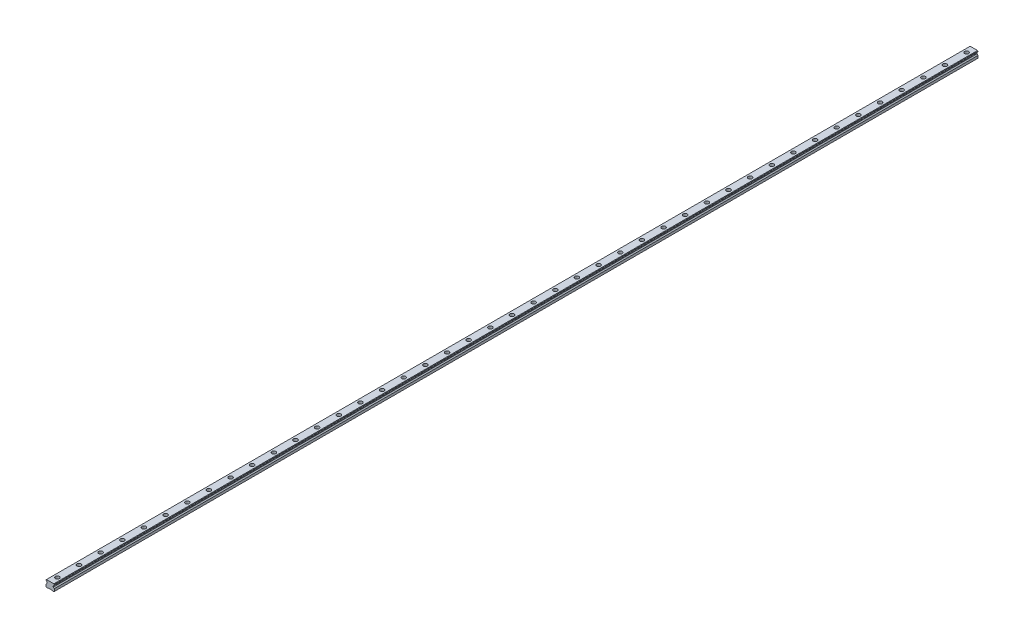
ISO-10303-21;
HEADER;
FILE_DESCRIPTION(('STEP AP214'),'2;1');
FILE_NAME('part.step','',(''),(''),'','','');
FILE_SCHEMA(('AUTOMOTIVE_DESIGN { 1 0 10303 214 1 1 1 1 }'));
ENDSEC;
DATA;
#1=APPLICATION_CONTEXT('core data for automotive mechanical design processes');
#2=APPLICATION_PROTOCOL_DEFINITION('international standard','automotive_design',2000,#1);
#3=PRODUCT_CONTEXT('',#1,'mechanical');
#4=PRODUCT('Part','Part','',(#3));
#5=PRODUCT_RELATED_PRODUCT_CATEGORY('part','',(#4));
#6=PRODUCT_DEFINITION_FORMATION('','',#4);
#7=PRODUCT_DEFINITION_CONTEXT('part definition',#1,'design');
#8=PRODUCT_DEFINITION('design','',#6,#7);
#9=PRODUCT_DEFINITION_SHAPE('','',#8);
#10=(LENGTH_UNIT() NAMED_UNIT(*) SI_UNIT(.MILLI.,.METRE.));
#11=(NAMED_UNIT(*) PLANE_ANGLE_UNIT() SI_UNIT($,.RADIAN.));
#12=(NAMED_UNIT(*) SI_UNIT($,.STERADIAN.) SOLID_ANGLE_UNIT());
#13=UNCERTAINTY_MEASURE_WITH_UNIT(LENGTH_MEASURE(1.E-05),#10,'distance_accuracy_value','');
#14=(GEOMETRIC_REPRESENTATION_CONTEXT(3) GLOBAL_UNCERTAINTY_ASSIGNED_CONTEXT((#13)) GLOBAL_UNIT_ASSIGNED_CONTEXT((#10,
#11,#12)) REPRESENTATION_CONTEXT('',''));
#15=CARTESIAN_POINT('',(0.,0.,0.));
#16=DIRECTION('',(0.,0.,1.));
#17=DIRECTION('',(1.,0.,0.));
#18=AXIS2_PLACEMENT_3D('',#15,#16,#17);
#19=CARTESIAN_POINT('',(0.,10.2,-1260.));
#20=DIRECTION('',(0.,1.,0.));
#21=DIRECTION('',(0.,0.,1.));
#22=AXIS2_PLACEMENT_3D('',#19,#20,#21);
#23=PLANE('',#22);
#24=CARTESIAN_POINT('',(0.,10.2,-1260.));
#25=DIRECTION('',(0.,1.,0.));
#26=DIRECTION('',(0.,0.,1.));
#27=AXIS2_PLACEMENT_3D('',#24,#25,#26);
#28=CIRCLE('',#27,3.49999999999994);
#29=CARTESIAN_POINT('',(0.,10.2,-1256.5));
#30=VERTEX_POINT('',#29);
#31=EDGE_CURVE('E686',#30,#30,#28,.T.);
#32=ORIENTED_EDGE('',*,*,#31,.F.);
#33=EDGE_LOOP('',(#32));
#34=FACE_BOUND('',#33,.T.);
#35=CARTESIAN_POINT('',(0.,10.2,-1260.));
#36=DIRECTION('',(0.,1.,0.));
#37=DIRECTION('',(0.,0.,1.));
#38=AXIS2_PLACEMENT_3D('',#35,#36,#37);
#39=CIRCLE('',#38,5.49999999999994);
#40=CARTESIAN_POINT('',(0.,10.2,-1254.5));
#41=VERTEX_POINT('',#40);
#42=EDGE_CURVE('E11',#41,#41,#39,.T.);
#43=ORIENTED_EDGE('',*,*,#42,.T.);
#44=EDGE_LOOP('',(#43));
#45=FACE_BOUND('',#44,.T.);
#46=ADVANCED_FACE('F39',(#34,#45),#23,.T.);
#47=CARTESIAN_POINT('',(0.,10.2,-1260.));
#48=DIRECTION('',(0.,1.,0.));
#49=DIRECTION('',(0.,0.,1.));
#50=AXIS2_PLACEMENT_3D('',#47,#48,#49);
#51=CYLINDRICAL_SURFACE('',#50,5.49999999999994);
#52=ORIENTED_EDGE('',*,*,#42,.F.);
#53=EDGE_LOOP('',(#52));
#54=FACE_BOUND('',#53,.T.);
#55=CARTESIAN_POINT('',(0.,19.2,-1260.));
#56=DIRECTION('',(0.,1.,0.));
#57=DIRECTION('',(0.,0.,1.));
#58=AXIS2_PLACEMENT_3D('',#55,#56,#57);
#59=CIRCLE('',#58,5.49999999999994);
#60=CARTESIAN_POINT('',(0.,19.2,-1254.5));
#61=VERTEX_POINT('',#60);
#62=EDGE_CURVE('E48',#61,#61,#59,.T.);
#63=ORIENTED_EDGE('',*,*,#62,.T.);
#64=EDGE_LOOP('',(#63));
#65=FACE_BOUND('',#64,.T.);
#66=ADVANCED_FACE('F1172',(#54,#65),#51,.F.);
#67=CARTESIAN_POINT('',(0.,10.2,-1200.));
#68=DIRECTION('',(0.,1.,0.));
#69=DIRECTION('',(0.,0.,1.));
#70=AXIS2_PLACEMENT_3D('',#67,#68,#69);
#71=PLANE('',#70);
#72=CARTESIAN_POINT('',(0.,10.2,-1200.));
#73=DIRECTION('',(0.,1.,0.));
#74=DIRECTION('',(0.,0.,1.));
#75=AXIS2_PLACEMENT_3D('',#72,#73,#74);
#76=CIRCLE('',#75,3.49999999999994);
#77=CARTESIAN_POINT('',(0.,10.2,-1196.5));
#78=VERTEX_POINT('',#77);
#79=EDGE_CURVE('E691',#78,#78,#76,.T.);
#80=ORIENTED_EDGE('',*,*,#79,.F.);
#81=EDGE_LOOP('',(#80));
#82=FACE_BOUND('',#81,.T.);
#83=CARTESIAN_POINT('',(0.,10.2,-1200.));
#84=DIRECTION('',(0.,1.,0.));
#85=DIRECTION('',(0.,0.,1.));
#86=AXIS2_PLACEMENT_3D('',#83,#84,#85);
#87=CIRCLE('',#86,5.49999999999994);
#88=CARTESIAN_POINT('',(0.,10.2,-1194.5));
#89=VERTEX_POINT('',#88);
#90=EDGE_CURVE('E670',#89,#89,#87,.T.);
#91=ORIENTED_EDGE('',*,*,#90,.T.);
#92=EDGE_LOOP('',(#91));
#93=FACE_BOUND('',#92,.T.);
#94=ADVANCED_FACE('F1174',(#82,#93),#71,.T.);
#95=CARTESIAN_POINT('',(0.,10.2,-1200.));
#96=DIRECTION('',(0.,1.,0.));
#97=DIRECTION('',(0.,0.,1.));
#98=AXIS2_PLACEMENT_3D('',#95,#96,#97);
#99=CYLINDRICAL_SURFACE('',#98,5.49999999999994);
#100=ORIENTED_EDGE('',*,*,#90,.F.);
#101=EDGE_LOOP('',(#100));
#102=FACE_BOUND('',#101,.T.);
#103=CARTESIAN_POINT('',(0.,19.2,-1200.));
#104=DIRECTION('',(0.,1.,0.));
#105=DIRECTION('',(0.,0.,1.));
#106=AXIS2_PLACEMENT_3D('',#103,#104,#105);
#107=CIRCLE('',#106,5.49999999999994);
#108=CARTESIAN_POINT('',(0.,19.2,-1194.5));
#109=VERTEX_POINT('',#108);
#110=EDGE_CURVE('E666',#109,#109,#107,.T.);
#111=ORIENTED_EDGE('',*,*,#110,.T.);
#112=EDGE_LOOP('',(#111));
#113=FACE_BOUND('',#112,.T.);
#114=ADVANCED_FACE('F1180',(#102,#113),#99,.F.);
#115=CARTESIAN_POINT('',(0.,10.2,-1140.));
#116=DIRECTION('',(0.,1.,0.));
#117=DIRECTION('',(0.,0.,1.));
#118=AXIS2_PLACEMENT_3D('',#115,#116,#117);
#119=PLANE('',#118);
#120=CARTESIAN_POINT('',(0.,10.2,-1140.));
#121=DIRECTION('',(0.,1.,0.));
#122=DIRECTION('',(0.,0.,1.));
#123=AXIS2_PLACEMENT_3D('',#120,#121,#122);
#124=CIRCLE('',#123,3.49999999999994);
#125=CARTESIAN_POINT('',(0.,10.2,-1136.5));
#126=VERTEX_POINT('',#125);
#127=EDGE_CURVE('E696',#126,#126,#124,.T.);
#128=ORIENTED_EDGE('',*,*,#127,.F.);
#129=EDGE_LOOP('',(#128));
#130=FACE_BOUND('',#129,.T.);
#131=CARTESIAN_POINT('',(0.,10.2,-1140.));
#132=DIRECTION('',(0.,1.,0.));
#133=DIRECTION('',(0.,0.,1.));
#134=AXIS2_PLACEMENT_3D('',#131,#132,#133);
#135=CIRCLE('',#134,5.49999999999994);
#136=CARTESIAN_POINT('',(0.,10.2,-1134.5));
#137=VERTEX_POINT('',#136);
#138=EDGE_CURVE('E662',#137,#137,#135,.T.);
#139=ORIENTED_EDGE('',*,*,#138,.T.);
#140=EDGE_LOOP('',(#139));
#141=FACE_BOUND('',#140,.T.);
#142=ADVANCED_FACE('F1188',(#130,#141),#119,.T.);
#143=CARTESIAN_POINT('',(0.,10.2,-1140.));
#144=DIRECTION('',(0.,1.,0.));
#145=DIRECTION('',(0.,0.,1.));
#146=AXIS2_PLACEMENT_3D('',#143,#144,#145);
#147=CYLINDRICAL_SURFACE('',#146,5.49999999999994);
#148=ORIENTED_EDGE('',*,*,#138,.F.);
#149=EDGE_LOOP('',(#148));
#150=FACE_BOUND('',#149,.T.);
#151=CARTESIAN_POINT('',(0.,19.2,-1140.));
#152=DIRECTION('',(0.,1.,0.));
#153=DIRECTION('',(0.,0.,1.));
#154=AXIS2_PLACEMENT_3D('',#151,#152,#153);
#155=CIRCLE('',#154,5.49999999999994);
#156=CARTESIAN_POINT('',(0.,19.2,-1134.5));
#157=VERTEX_POINT('',#156);
#158=EDGE_CURVE('E658',#157,#157,#155,.T.);
#159=ORIENTED_EDGE('',*,*,#158,.T.);
#160=EDGE_LOOP('',(#159));
#161=FACE_BOUND('',#160,.T.);
#162=ADVANCED_FACE('F1192',(#150,#161),#147,.F.);
#163=CARTESIAN_POINT('',(0.,10.2,-1080.));
#164=DIRECTION('',(0.,1.,0.));
#165=DIRECTION('',(0.,0.,1.));
#166=AXIS2_PLACEMENT_3D('',#163,#164,#165);
#167=PLANE('',#166);
#168=CARTESIAN_POINT('',(0.,10.2,-1080.));
#169=DIRECTION('',(0.,1.,0.));
#170=DIRECTION('',(0.,0.,1.));
#171=AXIS2_PLACEMENT_3D('',#168,#169,#170);
#172=CIRCLE('',#171,3.49999999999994);
#173=CARTESIAN_POINT('',(0.,10.2,-1076.5));
#174=VERTEX_POINT('',#173);
#175=EDGE_CURVE('E701',#174,#174,#172,.T.);
#176=ORIENTED_EDGE('',*,*,#175,.F.);
#177=EDGE_LOOP('',(#176));
#178=FACE_BOUND('',#177,.T.);
#179=CARTESIAN_POINT('',(0.,10.2,-1080.));
#180=DIRECTION('',(0.,1.,0.));
#181=DIRECTION('',(0.,0.,1.));
#182=AXIS2_PLACEMENT_3D('',#179,#180,#181);
#183=CIRCLE('',#182,5.49999999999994);
#184=CARTESIAN_POINT('',(0.,10.2,-1074.5));
#185=VERTEX_POINT('',#184);
#186=EDGE_CURVE('E654',#185,#185,#183,.T.);
#187=ORIENTED_EDGE('',*,*,#186,.T.);
#188=EDGE_LOOP('',(#187));
#189=FACE_BOUND('',#188,.T.);
#190=ADVANCED_FACE('F1196',(#178,#189),#167,.T.);
#191=CARTESIAN_POINT('',(0.,10.2,-1080.));
#192=DIRECTION('',(0.,1.,0.));
#193=DIRECTION('',(0.,0.,1.));
#194=AXIS2_PLACEMENT_3D('',#191,#192,#193);
#195=CYLINDRICAL_SURFACE('',#194,5.49999999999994);
#196=ORIENTED_EDGE('',*,*,#186,.F.);
#197=EDGE_LOOP('',(#196));
#198=FACE_BOUND('',#197,.T.);
#199=CARTESIAN_POINT('',(0.,19.2,-1080.));
#200=DIRECTION('',(0.,1.,0.));
#201=DIRECTION('',(0.,0.,1.));
#202=AXIS2_PLACEMENT_3D('',#199,#200,#201);
#203=CIRCLE('',#202,5.49999999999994);
#204=CARTESIAN_POINT('',(0.,19.2,-1074.5));
#205=VERTEX_POINT('',#204);
#206=EDGE_CURVE('E650',#205,#205,#203,.T.);
#207=ORIENTED_EDGE('',*,*,#206,.T.);
#208=EDGE_LOOP('',(#207));
#209=FACE_BOUND('',#208,.T.);
#210=ADVANCED_FACE('F1200',(#198,#209),#195,.F.);
#211=CARTESIAN_POINT('',(0.,10.2,-1020.));
#212=DIRECTION('',(0.,1.,0.));
#213=DIRECTION('',(0.,0.,1.));
#214=AXIS2_PLACEMENT_3D('',#211,#212,#213);
#215=PLANE('',#214);
#216=CARTESIAN_POINT('',(0.,10.2,-1020.));
#217=DIRECTION('',(0.,1.,0.));
#218=DIRECTION('',(0.,0.,1.));
#219=AXIS2_PLACEMENT_3D('',#216,#217,#218);
#220=CIRCLE('',#219,3.49999999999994);
#221=CARTESIAN_POINT('',(0.,10.2,-1016.5));
#222=VERTEX_POINT('',#221);
#223=EDGE_CURVE('E706',#222,#222,#220,.T.);
#224=ORIENTED_EDGE('',*,*,#223,.F.);
#225=EDGE_LOOP('',(#224));
#226=FACE_BOUND('',#225,.T.);
#227=CARTESIAN_POINT('',(0.,10.2,-1020.));
#228=DIRECTION('',(0.,1.,0.));
#229=DIRECTION('',(0.,0.,1.));
#230=AXIS2_PLACEMENT_3D('',#227,#228,#229);
#231=CIRCLE('',#230,5.49999999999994);
#232=CARTESIAN_POINT('',(0.,10.2,-1014.5));
#233=VERTEX_POINT('',#232);
#234=EDGE_CURVE('E646',#233,#233,#231,.T.);
#235=ORIENTED_EDGE('',*,*,#234,.T.);
#236=EDGE_LOOP('',(#235));
#237=FACE_BOUND('',#236,.T.);
#238=ADVANCED_FACE('F1204',(#226,#237),#215,.T.);
#239=CARTESIAN_POINT('',(0.,10.2,-1020.));
#240=DIRECTION('',(0.,1.,0.));
#241=DIRECTION('',(0.,0.,1.));
#242=AXIS2_PLACEMENT_3D('',#239,#240,#241);
#243=CYLINDRICAL_SURFACE('',#242,5.49999999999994);
#244=ORIENTED_EDGE('',*,*,#234,.F.);
#245=EDGE_LOOP('',(#244));
#246=FACE_BOUND('',#245,.T.);
#247=CARTESIAN_POINT('',(0.,19.2,-1020.));
#248=DIRECTION('',(0.,1.,0.));
#249=DIRECTION('',(0.,0.,1.));
#250=AXIS2_PLACEMENT_3D('',#247,#248,#249);
#251=CIRCLE('',#250,5.49999999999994);
#252=CARTESIAN_POINT('',(0.,19.2,-1014.5));
#253=VERTEX_POINT('',#252);
#254=EDGE_CURVE('E642',#253,#253,#251,.T.);
#255=ORIENTED_EDGE('',*,*,#254,.T.);
#256=EDGE_LOOP('',(#255));
#257=FACE_BOUND('',#256,.T.);
#258=ADVANCED_FACE('F1208',(#246,#257),#243,.F.);
#259=CARTESIAN_POINT('',(0.,10.2,-960.));
#260=DIRECTION('',(0.,1.,0.));
#261=DIRECTION('',(0.,0.,1.));
#262=AXIS2_PLACEMENT_3D('',#259,#260,#261);
#263=PLANE('',#262);
#264=CARTESIAN_POINT('',(0.,10.2,-960.));
#265=DIRECTION('',(0.,1.,0.));
#266=DIRECTION('',(0.,0.,1.));
#267=AXIS2_PLACEMENT_3D('',#264,#265,#266);
#268=CIRCLE('',#267,3.49999999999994);
#269=CARTESIAN_POINT('',(0.,10.2,-956.5));
#270=VERTEX_POINT('',#269);
#271=EDGE_CURVE('E711',#270,#270,#268,.T.);
#272=ORIENTED_EDGE('',*,*,#271,.F.);
#273=EDGE_LOOP('',(#272));
#274=FACE_BOUND('',#273,.T.);
#275=CARTESIAN_POINT('',(0.,10.2,-960.));
#276=DIRECTION('',(0.,1.,0.));
#277=DIRECTION('',(0.,0.,1.));
#278=AXIS2_PLACEMENT_3D('',#275,#276,#277);
#279=CIRCLE('',#278,5.49999999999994);
#280=CARTESIAN_POINT('',(0.,10.2,-954.5));
#281=VERTEX_POINT('',#280);
#282=EDGE_CURVE('E638',#281,#281,#279,.T.);
#283=ORIENTED_EDGE('',*,*,#282,.T.);
#284=EDGE_LOOP('',(#283));
#285=FACE_BOUND('',#284,.T.);
#286=ADVANCED_FACE('F1212',(#274,#285),#263,.T.);
#287=CARTESIAN_POINT('',(0.,10.2,-960.));
#288=DIRECTION('',(0.,1.,0.));
#289=DIRECTION('',(0.,0.,1.));
#290=AXIS2_PLACEMENT_3D('',#287,#288,#289);
#291=CYLINDRICAL_SURFACE('',#290,5.49999999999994);
#292=ORIENTED_EDGE('',*,*,#282,.F.);
#293=EDGE_LOOP('',(#292));
#294=FACE_BOUND('',#293,.T.);
#295=CARTESIAN_POINT('',(0.,19.2,-960.));
#296=DIRECTION('',(0.,1.,0.));
#297=DIRECTION('',(0.,0.,1.));
#298=AXIS2_PLACEMENT_3D('',#295,#296,#297);
#299=CIRCLE('',#298,5.49999999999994);
#300=CARTESIAN_POINT('',(0.,19.2,-954.5));
#301=VERTEX_POINT('',#300);
#302=EDGE_CURVE('E634',#301,#301,#299,.T.);
#303=ORIENTED_EDGE('',*,*,#302,.T.);
#304=EDGE_LOOP('',(#303));
#305=FACE_BOUND('',#304,.T.);
#306=ADVANCED_FACE('F1216',(#294,#305),#291,.F.);
#307=CARTESIAN_POINT('',(0.,10.2,-900.));
#308=DIRECTION('',(0.,1.,0.));
#309=DIRECTION('',(0.,0.,1.));
#310=AXIS2_PLACEMENT_3D('',#307,#308,#309);
#311=PLANE('',#310);
#312=CARTESIAN_POINT('',(0.,10.2,-900.));
#313=DIRECTION('',(0.,1.,0.));
#314=DIRECTION('',(0.,0.,1.));
#315=AXIS2_PLACEMENT_3D('',#312,#313,#314);
#316=CIRCLE('',#315,3.49999999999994);
#317=CARTESIAN_POINT('',(0.,10.2,-896.5));
#318=VERTEX_POINT('',#317);
#319=EDGE_CURVE('E716',#318,#318,#316,.T.);
#320=ORIENTED_EDGE('',*,*,#319,.F.);
#321=EDGE_LOOP('',(#320));
#322=FACE_BOUND('',#321,.T.);
#323=CARTESIAN_POINT('',(0.,10.2,-900.));
#324=DIRECTION('',(0.,1.,0.));
#325=DIRECTION('',(0.,0.,1.));
#326=AXIS2_PLACEMENT_3D('',#323,#324,#325);
#327=CIRCLE('',#326,5.49999999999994);
#328=CARTESIAN_POINT('',(0.,10.2,-894.5));
#329=VERTEX_POINT('',#328);
#330=EDGE_CURVE('E630',#329,#329,#327,.T.);
#331=ORIENTED_EDGE('',*,*,#330,.T.);
#332=EDGE_LOOP('',(#331));
#333=FACE_BOUND('',#332,.T.);
#334=ADVANCED_FACE('F1220',(#322,#333),#311,.T.);
#335=CARTESIAN_POINT('',(0.,10.2,-900.));
#336=DIRECTION('',(0.,1.,0.));
#337=DIRECTION('',(0.,0.,1.));
#338=AXIS2_PLACEMENT_3D('',#335,#336,#337);
#339=CYLINDRICAL_SURFACE('',#338,5.49999999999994);
#340=ORIENTED_EDGE('',*,*,#330,.F.);
#341=EDGE_LOOP('',(#340));
#342=FACE_BOUND('',#341,.T.);
#343=CARTESIAN_POINT('',(0.,19.2,-900.));
#344=DIRECTION('',(0.,1.,0.));
#345=DIRECTION('',(0.,0.,1.));
#346=AXIS2_PLACEMENT_3D('',#343,#344,#345);
#347=CIRCLE('',#346,5.49999999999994);
#348=CARTESIAN_POINT('',(0.,19.2,-894.5));
#349=VERTEX_POINT('',#348);
#350=EDGE_CURVE('E626',#349,#349,#347,.T.);
#351=ORIENTED_EDGE('',*,*,#350,.T.);
#352=EDGE_LOOP('',(#351));
#353=FACE_BOUND('',#352,.T.);
#354=ADVANCED_FACE('F1224',(#342,#353),#339,.F.);
#355=CARTESIAN_POINT('',(0.,10.2,-840.));
#356=DIRECTION('',(0.,1.,0.));
#357=DIRECTION('',(0.,0.,1.));
#358=AXIS2_PLACEMENT_3D('',#355,#356,#357);
#359=PLANE('',#358);
#360=CARTESIAN_POINT('',(0.,10.2,-840.));
#361=DIRECTION('',(0.,1.,0.));
#362=DIRECTION('',(0.,0.,1.));
#363=AXIS2_PLACEMENT_3D('',#360,#361,#362);
#364=CIRCLE('',#363,3.49999999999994);
#365=CARTESIAN_POINT('',(0.,10.2,-836.5));
#366=VERTEX_POINT('',#365);
#367=EDGE_CURVE('E721',#366,#366,#364,.T.);
#368=ORIENTED_EDGE('',*,*,#367,.F.);
#369=EDGE_LOOP('',(#368));
#370=FACE_BOUND('',#369,.T.);
#371=CARTESIAN_POINT('',(0.,10.2,-840.));
#372=DIRECTION('',(0.,1.,0.));
#373=DIRECTION('',(0.,0.,1.));
#374=AXIS2_PLACEMENT_3D('',#371,#372,#373);
#375=CIRCLE('',#374,5.49999999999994);
#376=CARTESIAN_POINT('',(0.,10.2,-834.5));
#377=VERTEX_POINT('',#376);
#378=EDGE_CURVE('E622',#377,#377,#375,.T.);
#379=ORIENTED_EDGE('',*,*,#378,.T.);
#380=EDGE_LOOP('',(#379));
#381=FACE_BOUND('',#380,.T.);
#382=ADVANCED_FACE('F1228',(#370,#381),#359,.T.);
#383=CARTESIAN_POINT('',(0.,10.2,-840.));
#384=DIRECTION('',(0.,1.,0.));
#385=DIRECTION('',(0.,0.,1.));
#386=AXIS2_PLACEMENT_3D('',#383,#384,#385);
#387=CYLINDRICAL_SURFACE('',#386,5.49999999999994);
#388=ORIENTED_EDGE('',*,*,#378,.F.);
#389=EDGE_LOOP('',(#388));
#390=FACE_BOUND('',#389,.T.);
#391=CARTESIAN_POINT('',(0.,19.2,-840.));
#392=DIRECTION('',(0.,1.,0.));
#393=DIRECTION('',(0.,0.,1.));
#394=AXIS2_PLACEMENT_3D('',#391,#392,#393);
#395=CIRCLE('',#394,5.49999999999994);
#396=CARTESIAN_POINT('',(0.,19.2,-834.5));
#397=VERTEX_POINT('',#396);
#398=EDGE_CURVE('E618',#397,#397,#395,.T.);
#399=ORIENTED_EDGE('',*,*,#398,.T.);
#400=EDGE_LOOP('',(#399));
#401=FACE_BOUND('',#400,.T.);
#402=ADVANCED_FACE('F1232',(#390,#401),#387,.F.);
#403=CARTESIAN_POINT('',(0.,10.2,-780.));
#404=DIRECTION('',(0.,1.,0.));
#405=DIRECTION('',(0.,0.,1.));
#406=AXIS2_PLACEMENT_3D('',#403,#404,#405);
#407=PLANE('',#406);
#408=CARTESIAN_POINT('',(0.,10.2,-780.));
#409=DIRECTION('',(0.,1.,0.));
#410=DIRECTION('',(0.,0.,1.));
#411=AXIS2_PLACEMENT_3D('',#408,#409,#410);
#412=CIRCLE('',#411,3.49999999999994);
#413=CARTESIAN_POINT('',(0.,10.2,-776.5));
#414=VERTEX_POINT('',#413);
#415=EDGE_CURVE('E726',#414,#414,#412,.T.);
#416=ORIENTED_EDGE('',*,*,#415,.F.);
#417=EDGE_LOOP('',(#416));
#418=FACE_BOUND('',#417,.T.);
#419=CARTESIAN_POINT('',(0.,10.2,-780.));
#420=DIRECTION('',(0.,1.,0.));
#421=DIRECTION('',(0.,0.,1.));
#422=AXIS2_PLACEMENT_3D('',#419,#420,#421);
#423=CIRCLE('',#422,5.49999999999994);
#424=CARTESIAN_POINT('',(0.,10.2,-774.5));
#425=VERTEX_POINT('',#424);
#426=EDGE_CURVE('E614',#425,#425,#423,.T.);
#427=ORIENTED_EDGE('',*,*,#426,.T.);
#428=EDGE_LOOP('',(#427));
#429=FACE_BOUND('',#428,.T.);
#430=ADVANCED_FACE('F1236',(#418,#429),#407,.T.);
#431=CARTESIAN_POINT('',(0.,10.2,-780.));
#432=DIRECTION('',(0.,1.,0.));
#433=DIRECTION('',(0.,0.,1.));
#434=AXIS2_PLACEMENT_3D('',#431,#432,#433);
#435=CYLINDRICAL_SURFACE('',#434,5.49999999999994);
#436=ORIENTED_EDGE('',*,*,#426,.F.);
#437=EDGE_LOOP('',(#436));
#438=FACE_BOUND('',#437,.T.);
#439=CARTESIAN_POINT('',(0.,19.2,-780.));
#440=DIRECTION('',(0.,1.,0.));
#441=DIRECTION('',(0.,0.,1.));
#442=AXIS2_PLACEMENT_3D('',#439,#440,#441);
#443=CIRCLE('',#442,5.49999999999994);
#444=CARTESIAN_POINT('',(0.,19.2,-774.5));
#445=VERTEX_POINT('',#444);
#446=EDGE_CURVE('E610',#445,#445,#443,.T.);
#447=ORIENTED_EDGE('',*,*,#446,.T.);
#448=EDGE_LOOP('',(#447));
#449=FACE_BOUND('',#448,.T.);
#450=ADVANCED_FACE('F1240',(#438,#449),#435,.F.);
#451=CARTESIAN_POINT('',(0.,10.2,-720.));
#452=DIRECTION('',(0.,1.,0.));
#453=DIRECTION('',(0.,0.,1.));
#454=AXIS2_PLACEMENT_3D('',#451,#452,#453);
#455=PLANE('',#454);
#456=CARTESIAN_POINT('',(0.,10.2,-720.));
#457=DIRECTION('',(0.,1.,0.));
#458=DIRECTION('',(0.,0.,1.));
#459=AXIS2_PLACEMENT_3D('',#456,#457,#458);
#460=CIRCLE('',#459,3.49999999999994);
#461=CARTESIAN_POINT('',(0.,10.2,-716.5));
#462=VERTEX_POINT('',#461);
#463=EDGE_CURVE('E731',#462,#462,#460,.T.);
#464=ORIENTED_EDGE('',*,*,#463,.F.);
#465=EDGE_LOOP('',(#464));
#466=FACE_BOUND('',#465,.T.);
#467=CARTESIAN_POINT('',(0.,10.2,-720.));
#468=DIRECTION('',(0.,1.,0.));
#469=DIRECTION('',(0.,0.,1.));
#470=AXIS2_PLACEMENT_3D('',#467,#468,#469);
#471=CIRCLE('',#470,5.49999999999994);
#472=CARTESIAN_POINT('',(0.,10.2,-714.5));
#473=VERTEX_POINT('',#472);
#474=EDGE_CURVE('E606',#473,#473,#471,.T.);
#475=ORIENTED_EDGE('',*,*,#474,.T.);
#476=EDGE_LOOP('',(#475));
#477=FACE_BOUND('',#476,.T.);
#478=ADVANCED_FACE('F1244',(#466,#477),#455,.T.);
#479=CARTESIAN_POINT('',(0.,10.2,-720.));
#480=DIRECTION('',(0.,1.,0.));
#481=DIRECTION('',(0.,0.,1.));
#482=AXIS2_PLACEMENT_3D('',#479,#480,#481);
#483=CYLINDRICAL_SURFACE('',#482,5.49999999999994);
#484=ORIENTED_EDGE('',*,*,#474,.F.);
#485=EDGE_LOOP('',(#484));
#486=FACE_BOUND('',#485,.T.);
#487=CARTESIAN_POINT('',(0.,19.2,-720.));
#488=DIRECTION('',(0.,1.,0.));
#489=DIRECTION('',(0.,0.,1.));
#490=AXIS2_PLACEMENT_3D('',#487,#488,#489);
#491=CIRCLE('',#490,5.49999999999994);
#492=CARTESIAN_POINT('',(0.,19.2,-714.5));
#493=VERTEX_POINT('',#492);
#494=EDGE_CURVE('E602',#493,#493,#491,.T.);
#495=ORIENTED_EDGE('',*,*,#494,.T.);
#496=EDGE_LOOP('',(#495));
#497=FACE_BOUND('',#496,.T.);
#498=ADVANCED_FACE('F1248',(#486,#497),#483,.F.);
#499=CARTESIAN_POINT('',(0.,10.2,-660.));
#500=DIRECTION('',(0.,1.,0.));
#501=DIRECTION('',(0.,0.,1.));
#502=AXIS2_PLACEMENT_3D('',#499,#500,#501);
#503=PLANE('',#502);
#504=CARTESIAN_POINT('',(0.,10.2,-660.));
#505=DIRECTION('',(0.,1.,0.));
#506=DIRECTION('',(0.,0.,1.));
#507=AXIS2_PLACEMENT_3D('',#504,#505,#506);
#508=CIRCLE('',#507,3.49999999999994);
#509=CARTESIAN_POINT('',(0.,10.2,-656.5));
#510=VERTEX_POINT('',#509);
#511=EDGE_CURVE('E736',#510,#510,#508,.T.);
#512=ORIENTED_EDGE('',*,*,#511,.F.);
#513=EDGE_LOOP('',(#512));
#514=FACE_BOUND('',#513,.T.);
#515=CARTESIAN_POINT('',(0.,10.2,-660.));
#516=DIRECTION('',(0.,1.,0.));
#517=DIRECTION('',(0.,0.,1.));
#518=AXIS2_PLACEMENT_3D('',#515,#516,#517);
#519=CIRCLE('',#518,5.49999999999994);
#520=CARTESIAN_POINT('',(0.,10.2,-654.5));
#521=VERTEX_POINT('',#520);
#522=EDGE_CURVE('E598',#521,#521,#519,.T.);
#523=ORIENTED_EDGE('',*,*,#522,.T.);
#524=EDGE_LOOP('',(#523));
#525=FACE_BOUND('',#524,.T.);
#526=ADVANCED_FACE('F1252',(#514,#525),#503,.T.);
#527=CARTESIAN_POINT('',(0.,10.2,-660.));
#528=DIRECTION('',(0.,1.,0.));
#529=DIRECTION('',(0.,0.,1.));
#530=AXIS2_PLACEMENT_3D('',#527,#528,#529);
#531=CYLINDRICAL_SURFACE('',#530,5.49999999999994);
#532=ORIENTED_EDGE('',*,*,#522,.F.);
#533=EDGE_LOOP('',(#532));
#534=FACE_BOUND('',#533,.T.);
#535=CARTESIAN_POINT('',(0.,19.2,-660.));
#536=DIRECTION('',(0.,1.,0.));
#537=DIRECTION('',(0.,0.,1.));
#538=AXIS2_PLACEMENT_3D('',#535,#536,#537);
#539=CIRCLE('',#538,5.49999999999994);
#540=CARTESIAN_POINT('',(0.,19.2,-654.5));
#541=VERTEX_POINT('',#540);
#542=EDGE_CURVE('E594',#541,#541,#539,.T.);
#543=ORIENTED_EDGE('',*,*,#542,.T.);
#544=EDGE_LOOP('',(#543));
#545=FACE_BOUND('',#544,.T.);
#546=ADVANCED_FACE('F1256',(#534,#545),#531,.F.);
#547=CARTESIAN_POINT('',(0.,10.2,-600.));
#548=DIRECTION('',(0.,1.,0.));
#549=DIRECTION('',(0.,0.,1.));
#550=AXIS2_PLACEMENT_3D('',#547,#548,#549);
#551=PLANE('',#550);
#552=CARTESIAN_POINT('',(0.,10.2,-600.));
#553=DIRECTION('',(0.,1.,0.));
#554=DIRECTION('',(0.,0.,1.));
#555=AXIS2_PLACEMENT_3D('',#552,#553,#554);
#556=CIRCLE('',#555,3.49999999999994);
#557=CARTESIAN_POINT('',(0.,10.2,-596.5));
#558=VERTEX_POINT('',#557);
#559=EDGE_CURVE('E741',#558,#558,#556,.T.);
#560=ORIENTED_EDGE('',*,*,#559,.F.);
#561=EDGE_LOOP('',(#560));
#562=FACE_BOUND('',#561,.T.);
#563=CARTESIAN_POINT('',(0.,10.2,-600.));
#564=DIRECTION('',(0.,1.,0.));
#565=DIRECTION('',(0.,0.,1.));
#566=AXIS2_PLACEMENT_3D('',#563,#564,#565);
#567=CIRCLE('',#566,5.49999999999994);
#568=CARTESIAN_POINT('',(0.,10.2,-594.5));
#569=VERTEX_POINT('',#568);
#570=EDGE_CURVE('E590',#569,#569,#567,.T.);
#571=ORIENTED_EDGE('',*,*,#570,.T.);
#572=EDGE_LOOP('',(#571));
#573=FACE_BOUND('',#572,.T.);
#574=ADVANCED_FACE('F1260',(#562,#573),#551,.T.);
#575=CARTESIAN_POINT('',(0.,10.2,-600.));
#576=DIRECTION('',(0.,1.,0.));
#577=DIRECTION('',(0.,0.,1.));
#578=AXIS2_PLACEMENT_3D('',#575,#576,#577);
#579=CYLINDRICAL_SURFACE('',#578,5.49999999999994);
#580=ORIENTED_EDGE('',*,*,#570,.F.);
#581=EDGE_LOOP('',(#580));
#582=FACE_BOUND('',#581,.T.);
#583=CARTESIAN_POINT('',(0.,19.2,-600.));
#584=DIRECTION('',(0.,1.,0.));
#585=DIRECTION('',(0.,0.,1.));
#586=AXIS2_PLACEMENT_3D('',#583,#584,#585);
#587=CIRCLE('',#586,5.49999999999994);
#588=CARTESIAN_POINT('',(0.,19.2,-594.5));
#589=VERTEX_POINT('',#588);
#590=EDGE_CURVE('E586',#589,#589,#587,.T.);
#591=ORIENTED_EDGE('',*,*,#590,.T.);
#592=EDGE_LOOP('',(#591));
#593=FACE_BOUND('',#592,.T.);
#594=ADVANCED_FACE('F1264',(#582,#593),#579,.F.);
#595=CARTESIAN_POINT('',(0.,10.2,-540.));
#596=DIRECTION('',(0.,1.,0.));
#597=DIRECTION('',(0.,0.,1.));
#598=AXIS2_PLACEMENT_3D('',#595,#596,#597);
#599=PLANE('',#598);
#600=CARTESIAN_POINT('',(0.,10.2,-540.));
#601=DIRECTION('',(0.,1.,0.));
#602=DIRECTION('',(0.,0.,1.));
#603=AXIS2_PLACEMENT_3D('',#600,#601,#602);
#604=CIRCLE('',#603,3.49999999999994);
#605=CARTESIAN_POINT('',(0.,10.2,-536.5));
#606=VERTEX_POINT('',#605);
#607=EDGE_CURVE('E746',#606,#606,#604,.T.);
#608=ORIENTED_EDGE('',*,*,#607,.F.);
#609=EDGE_LOOP('',(#608));
#610=FACE_BOUND('',#609,.T.);
#611=CARTESIAN_POINT('',(0.,10.2,-540.));
#612=DIRECTION('',(0.,1.,0.));
#613=DIRECTION('',(0.,0.,1.));
#614=AXIS2_PLACEMENT_3D('',#611,#612,#613);
#615=CIRCLE('',#614,5.49999999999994);
#616=CARTESIAN_POINT('',(0.,10.2,-534.5));
#617=VERTEX_POINT('',#616);
#618=EDGE_CURVE('E582',#617,#617,#615,.T.);
#619=ORIENTED_EDGE('',*,*,#618,.T.);
#620=EDGE_LOOP('',(#619));
#621=FACE_BOUND('',#620,.T.);
#622=ADVANCED_FACE('F1268',(#610,#621),#599,.T.);
#623=CARTESIAN_POINT('',(0.,10.2,-540.));
#624=DIRECTION('',(0.,1.,0.));
#625=DIRECTION('',(0.,0.,1.));
#626=AXIS2_PLACEMENT_3D('',#623,#624,#625);
#627=CYLINDRICAL_SURFACE('',#626,5.49999999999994);
#628=ORIENTED_EDGE('',*,*,#618,.F.);
#629=EDGE_LOOP('',(#628));
#630=FACE_BOUND('',#629,.T.);
#631=CARTESIAN_POINT('',(0.,19.2,-540.));
#632=DIRECTION('',(0.,1.,0.));
#633=DIRECTION('',(0.,0.,1.));
#634=AXIS2_PLACEMENT_3D('',#631,#632,#633);
#635=CIRCLE('',#634,5.49999999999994);
#636=CARTESIAN_POINT('',(0.,19.2,-534.5));
#637=VERTEX_POINT('',#636);
#638=EDGE_CURVE('E578',#637,#637,#635,.T.);
#639=ORIENTED_EDGE('',*,*,#638,.T.);
#640=EDGE_LOOP('',(#639));
#641=FACE_BOUND('',#640,.T.);
#642=ADVANCED_FACE('F1272',(#630,#641),#627,.F.);
#643=CARTESIAN_POINT('',(0.,10.2,-480.));
#644=DIRECTION('',(0.,1.,0.));
#645=DIRECTION('',(0.,0.,1.));
#646=AXIS2_PLACEMENT_3D('',#643,#644,#645);
#647=PLANE('',#646);
#648=CARTESIAN_POINT('',(0.,10.2,-480.));
#649=DIRECTION('',(0.,1.,0.));
#650=DIRECTION('',(0.,0.,1.));
#651=AXIS2_PLACEMENT_3D('',#648,#649,#650);
#652=CIRCLE('',#651,3.49999999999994);
#653=CARTESIAN_POINT('',(0.,10.2,-476.5));
#654=VERTEX_POINT('',#653);
#655=EDGE_CURVE('E751',#654,#654,#652,.T.);
#656=ORIENTED_EDGE('',*,*,#655,.F.);
#657=EDGE_LOOP('',(#656));
#658=FACE_BOUND('',#657,.T.);
#659=CARTESIAN_POINT('',(0.,10.2,-480.));
#660=DIRECTION('',(0.,1.,0.));
#661=DIRECTION('',(0.,0.,1.));
#662=AXIS2_PLACEMENT_3D('',#659,#660,#661);
#663=CIRCLE('',#662,5.49999999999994);
#664=CARTESIAN_POINT('',(0.,10.2,-474.5));
#665=VERTEX_POINT('',#664);
#666=EDGE_CURVE('E574',#665,#665,#663,.T.);
#667=ORIENTED_EDGE('',*,*,#666,.T.);
#668=EDGE_LOOP('',(#667));
#669=FACE_BOUND('',#668,.T.);
#670=ADVANCED_FACE('F1276',(#658,#669),#647,.T.);
#671=CARTESIAN_POINT('',(0.,10.2,-480.));
#672=DIRECTION('',(0.,1.,0.));
#673=DIRECTION('',(0.,0.,1.));
#674=AXIS2_PLACEMENT_3D('',#671,#672,#673);
#675=CYLINDRICAL_SURFACE('',#674,5.49999999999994);
#676=ORIENTED_EDGE('',*,*,#666,.F.);
#677=EDGE_LOOP('',(#676));
#678=FACE_BOUND('',#677,.T.);
#679=CARTESIAN_POINT('',(0.,19.2,-480.));
#680=DIRECTION('',(0.,1.,0.));
#681=DIRECTION('',(0.,0.,1.));
#682=AXIS2_PLACEMENT_3D('',#679,#680,#681);
#683=CIRCLE('',#682,5.49999999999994);
#684=CARTESIAN_POINT('',(0.,19.2,-474.5));
#685=VERTEX_POINT('',#684);
#686=EDGE_CURVE('E570',#685,#685,#683,.T.);
#687=ORIENTED_EDGE('',*,*,#686,.T.);
#688=EDGE_LOOP('',(#687));
#689=FACE_BOUND('',#688,.T.);
#690=ADVANCED_FACE('F1280',(#678,#689),#675,.F.);
#691=CARTESIAN_POINT('',(0.,10.2,-420.));
#692=DIRECTION('',(0.,1.,0.));
#693=DIRECTION('',(0.,0.,1.));
#694=AXIS2_PLACEMENT_3D('',#691,#692,#693);
#695=PLANE('',#694);
#696=CARTESIAN_POINT('',(0.,10.2,-420.));
#697=DIRECTION('',(0.,1.,0.));
#698=DIRECTION('',(0.,0.,1.));
#699=AXIS2_PLACEMENT_3D('',#696,#697,#698);
#700=CIRCLE('',#699,3.49999999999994);
#701=CARTESIAN_POINT('',(0.,10.2,-416.5));
#702=VERTEX_POINT('',#701);
#703=EDGE_CURVE('E756',#702,#702,#700,.T.);
#704=ORIENTED_EDGE('',*,*,#703,.F.);
#705=EDGE_LOOP('',(#704));
#706=FACE_BOUND('',#705,.T.);
#707=CARTESIAN_POINT('',(0.,10.2,-420.));
#708=DIRECTION('',(0.,1.,0.));
#709=DIRECTION('',(0.,0.,1.));
#710=AXIS2_PLACEMENT_3D('',#707,#708,#709);
#711=CIRCLE('',#710,5.49999999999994);
#712=CARTESIAN_POINT('',(0.,10.2,-414.5));
#713=VERTEX_POINT('',#712);
#714=EDGE_CURVE('E566',#713,#713,#711,.T.);
#715=ORIENTED_EDGE('',*,*,#714,.T.);
#716=EDGE_LOOP('',(#715));
#717=FACE_BOUND('',#716,.T.);
#718=ADVANCED_FACE('F1284',(#706,#717),#695,.T.);
#719=CARTESIAN_POINT('',(0.,10.2,-420.));
#720=DIRECTION('',(0.,1.,0.));
#721=DIRECTION('',(0.,0.,1.));
#722=AXIS2_PLACEMENT_3D('',#719,#720,#721);
#723=CYLINDRICAL_SURFACE('',#722,5.49999999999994);
#724=ORIENTED_EDGE('',*,*,#714,.F.);
#725=EDGE_LOOP('',(#724));
#726=FACE_BOUND('',#725,.T.);
#727=CARTESIAN_POINT('',(0.,19.2,-420.));
#728=DIRECTION('',(0.,1.,0.));
#729=DIRECTION('',(0.,0.,1.));
#730=AXIS2_PLACEMENT_3D('',#727,#728,#729);
#731=CIRCLE('',#730,5.49999999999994);
#732=CARTESIAN_POINT('',(0.,19.2,-414.5));
#733=VERTEX_POINT('',#732);
#734=EDGE_CURVE('E562',#733,#733,#731,.T.);
#735=ORIENTED_EDGE('',*,*,#734,.T.);
#736=EDGE_LOOP('',(#735));
#737=FACE_BOUND('',#736,.T.);
#738=ADVANCED_FACE('F1288',(#726,#737),#723,.F.);
#739=CARTESIAN_POINT('',(0.,10.2,-360.));
#740=DIRECTION('',(0.,1.,0.));
#741=DIRECTION('',(0.,0.,1.));
#742=AXIS2_PLACEMENT_3D('',#739,#740,#741);
#743=PLANE('',#742);
#744=CARTESIAN_POINT('',(0.,10.2,-360.));
#745=DIRECTION('',(0.,1.,0.));
#746=DIRECTION('',(0.,0.,1.));
#747=AXIS2_PLACEMENT_3D('',#744,#745,#746);
#748=CIRCLE('',#747,3.49999999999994);
#749=CARTESIAN_POINT('',(0.,10.2,-356.5));
#750=VERTEX_POINT('',#749);
#751=EDGE_CURVE('E761',#750,#750,#748,.T.);
#752=ORIENTED_EDGE('',*,*,#751,.F.);
#753=EDGE_LOOP('',(#752));
#754=FACE_BOUND('',#753,.T.);
#755=CARTESIAN_POINT('',(0.,10.2,-360.));
#756=DIRECTION('',(0.,1.,0.));
#757=DIRECTION('',(0.,0.,1.));
#758=AXIS2_PLACEMENT_3D('',#755,#756,#757);
#759=CIRCLE('',#758,5.49999999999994);
#760=CARTESIAN_POINT('',(0.,10.2,-354.5));
#761=VERTEX_POINT('',#760);
#762=EDGE_CURVE('E558',#761,#761,#759,.T.);
#763=ORIENTED_EDGE('',*,*,#762,.T.);
#764=EDGE_LOOP('',(#763));
#765=FACE_BOUND('',#764,.T.);
#766=ADVANCED_FACE('F1292',(#754,#765),#743,.T.);
#767=CARTESIAN_POINT('',(0.,10.2,-360.));
#768=DIRECTION('',(0.,1.,0.));
#769=DIRECTION('',(0.,0.,1.));
#770=AXIS2_PLACEMENT_3D('',#767,#768,#769);
#771=CYLINDRICAL_SURFACE('',#770,5.49999999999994);
#772=ORIENTED_EDGE('',*,*,#762,.F.);
#773=EDGE_LOOP('',(#772));
#774=FACE_BOUND('',#773,.T.);
#775=CARTESIAN_POINT('',(0.,19.2,-360.));
#776=DIRECTION('',(0.,1.,0.));
#777=DIRECTION('',(0.,0.,1.));
#778=AXIS2_PLACEMENT_3D('',#775,#776,#777);
#779=CIRCLE('',#778,5.49999999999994);
#780=CARTESIAN_POINT('',(0.,19.2,-354.5));
#781=VERTEX_POINT('',#780);
#782=EDGE_CURVE('E554',#781,#781,#779,.T.);
#783=ORIENTED_EDGE('',*,*,#782,.T.);
#784=EDGE_LOOP('',(#783));
#785=FACE_BOUND('',#784,.T.);
#786=ADVANCED_FACE('F1296',(#774,#785),#771,.F.);
#787=CARTESIAN_POINT('',(0.,10.2,-300.));
#788=DIRECTION('',(0.,1.,0.));
#789=DIRECTION('',(0.,0.,1.));
#790=AXIS2_PLACEMENT_3D('',#787,#788,#789);
#791=PLANE('',#790);
#792=CARTESIAN_POINT('',(0.,10.2,-300.));
#793=DIRECTION('',(0.,1.,0.));
#794=DIRECTION('',(0.,0.,1.));
#795=AXIS2_PLACEMENT_3D('',#792,#793,#794);
#796=CIRCLE('',#795,3.49999999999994);
#797=CARTESIAN_POINT('',(0.,10.2,-296.5));
#798=VERTEX_POINT('',#797);
#799=EDGE_CURVE('E766',#798,#798,#796,.T.);
#800=ORIENTED_EDGE('',*,*,#799,.F.);
#801=EDGE_LOOP('',(#800));
#802=FACE_BOUND('',#801,.T.);
#803=CARTESIAN_POINT('',(0.,10.2,-300.));
#804=DIRECTION('',(0.,1.,0.));
#805=DIRECTION('',(0.,0.,1.));
#806=AXIS2_PLACEMENT_3D('',#803,#804,#805);
#807=CIRCLE('',#806,5.49999999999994);
#808=CARTESIAN_POINT('',(0.,10.2,-294.5));
#809=VERTEX_POINT('',#808);
#810=EDGE_CURVE('E550',#809,#809,#807,.T.);
#811=ORIENTED_EDGE('',*,*,#810,.T.);
#812=EDGE_LOOP('',(#811));
#813=FACE_BOUND('',#812,.T.);
#814=ADVANCED_FACE('F1300',(#802,#813),#791,.T.);
#815=CARTESIAN_POINT('',(0.,10.2,-300.));
#816=DIRECTION('',(0.,1.,0.));
#817=DIRECTION('',(0.,0.,1.));
#818=AXIS2_PLACEMENT_3D('',#815,#816,#817);
#819=CYLINDRICAL_SURFACE('',#818,5.49999999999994);
#820=ORIENTED_EDGE('',*,*,#810,.F.);
#821=EDGE_LOOP('',(#820));
#822=FACE_BOUND('',#821,.T.);
#823=CARTESIAN_POINT('',(0.,19.2,-300.));
#824=DIRECTION('',(0.,1.,0.));
#825=DIRECTION('',(0.,0.,1.));
#826=AXIS2_PLACEMENT_3D('',#823,#824,#825);
#827=CIRCLE('',#826,5.49999999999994);
#828=CARTESIAN_POINT('',(0.,19.2,-294.5));
#829=VERTEX_POINT('',#828);
#830=EDGE_CURVE('E546',#829,#829,#827,.T.);
#831=ORIENTED_EDGE('',*,*,#830,.T.);
#832=EDGE_LOOP('',(#831));
#833=FACE_BOUND('',#832,.T.);
#834=ADVANCED_FACE('F1304',(#822,#833),#819,.F.);
#835=CARTESIAN_POINT('',(0.,10.2,-240.));
#836=DIRECTION('',(0.,1.,0.));
#837=DIRECTION('',(0.,0.,1.));
#838=AXIS2_PLACEMENT_3D('',#835,#836,#837);
#839=PLANE('',#838);
#840=CARTESIAN_POINT('',(0.,10.2,-240.));
#841=DIRECTION('',(0.,1.,0.));
#842=DIRECTION('',(0.,0.,1.));
#843=AXIS2_PLACEMENT_3D('',#840,#841,#842);
#844=CIRCLE('',#843,3.49999999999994);
#845=CARTESIAN_POINT('',(0.,10.2,-236.5));
#846=VERTEX_POINT('',#845);
#847=EDGE_CURVE('E771',#846,#846,#844,.T.);
#848=ORIENTED_EDGE('',*,*,#847,.F.);
#849=EDGE_LOOP('',(#848));
#850=FACE_BOUND('',#849,.T.);
#851=CARTESIAN_POINT('',(0.,10.2,-240.));
#852=DIRECTION('',(0.,1.,0.));
#853=DIRECTION('',(0.,0.,1.));
#854=AXIS2_PLACEMENT_3D('',#851,#852,#853);
#855=CIRCLE('',#854,5.49999999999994);
#856=CARTESIAN_POINT('',(0.,10.2,-234.5));
#857=VERTEX_POINT('',#856);
#858=EDGE_CURVE('E542',#857,#857,#855,.T.);
#859=ORIENTED_EDGE('',*,*,#858,.T.);
#860=EDGE_LOOP('',(#859));
#861=FACE_BOUND('',#860,.T.);
#862=ADVANCED_FACE('F1308',(#850,#861),#839,.T.);
#863=CARTESIAN_POINT('',(0.,10.2,-240.));
#864=DIRECTION('',(0.,1.,0.));
#865=DIRECTION('',(0.,0.,1.));
#866=AXIS2_PLACEMENT_3D('',#863,#864,#865);
#867=CYLINDRICAL_SURFACE('',#866,5.49999999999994);
#868=ORIENTED_EDGE('',*,*,#858,.F.);
#869=EDGE_LOOP('',(#868));
#870=FACE_BOUND('',#869,.T.);
#871=CARTESIAN_POINT('',(0.,19.2,-240.));
#872=DIRECTION('',(0.,1.,0.));
#873=DIRECTION('',(0.,0.,1.));
#874=AXIS2_PLACEMENT_3D('',#871,#872,#873);
#875=CIRCLE('',#874,5.49999999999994);
#876=CARTESIAN_POINT('',(0.,19.2,-234.5));
#877=VERTEX_POINT('',#876);
#878=EDGE_CURVE('E538',#877,#877,#875,.T.);
#879=ORIENTED_EDGE('',*,*,#878,.T.);
#880=EDGE_LOOP('',(#879));
#881=FACE_BOUND('',#880,.T.);
#882=ADVANCED_FACE('F1312',(#870,#881),#867,.F.);
#883=CARTESIAN_POINT('',(0.,10.2,-180.));
#884=DIRECTION('',(0.,1.,0.));
#885=DIRECTION('',(0.,0.,1.));
#886=AXIS2_PLACEMENT_3D('',#883,#884,#885);
#887=PLANE('',#886);
#888=CARTESIAN_POINT('',(0.,10.2,-180.));
#889=DIRECTION('',(0.,1.,0.));
#890=DIRECTION('',(0.,0.,1.));
#891=AXIS2_PLACEMENT_3D('',#888,#889,#890);
#892=CIRCLE('',#891,3.49999999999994);
#893=CARTESIAN_POINT('',(0.,10.2,-176.5));
#894=VERTEX_POINT('',#893);
#895=EDGE_CURVE('E776',#894,#894,#892,.T.);
#896=ORIENTED_EDGE('',*,*,#895,.F.);
#897=EDGE_LOOP('',(#896));
#898=FACE_BOUND('',#897,.T.);
#899=CARTESIAN_POINT('',(0.,10.2,-180.));
#900=DIRECTION('',(0.,1.,0.));
#901=DIRECTION('',(0.,0.,1.));
#902=AXIS2_PLACEMENT_3D('',#899,#900,#901);
#903=CIRCLE('',#902,5.49999999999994);
#904=CARTESIAN_POINT('',(0.,10.2,-174.5));
#905=VERTEX_POINT('',#904);
#906=EDGE_CURVE('E534',#905,#905,#903,.T.);
#907=ORIENTED_EDGE('',*,*,#906,.T.);
#908=EDGE_LOOP('',(#907));
#909=FACE_BOUND('',#908,.T.);
#910=ADVANCED_FACE('F1316',(#898,#909),#887,.T.);
#911=CARTESIAN_POINT('',(0.,10.2,-180.));
#912=DIRECTION('',(0.,1.,0.));
#913=DIRECTION('',(0.,0.,1.));
#914=AXIS2_PLACEMENT_3D('',#911,#912,#913);
#915=CYLINDRICAL_SURFACE('',#914,5.49999999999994);
#916=ORIENTED_EDGE('',*,*,#906,.F.);
#917=EDGE_LOOP('',(#916));
#918=FACE_BOUND('',#917,.T.);
#919=CARTESIAN_POINT('',(0.,19.2,-180.));
#920=DIRECTION('',(0.,1.,0.));
#921=DIRECTION('',(0.,0.,1.));
#922=AXIS2_PLACEMENT_3D('',#919,#920,#921);
#923=CIRCLE('',#922,5.49999999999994);
#924=CARTESIAN_POINT('',(0.,19.2,-174.5));
#925=VERTEX_POINT('',#924);
#926=EDGE_CURVE('E530',#925,#925,#923,.T.);
#927=ORIENTED_EDGE('',*,*,#926,.T.);
#928=EDGE_LOOP('',(#927));
#929=FACE_BOUND('',#928,.T.);
#930=ADVANCED_FACE('F1320',(#918,#929),#915,.F.);
#931=CARTESIAN_POINT('',(0.,10.2,-120.));
#932=DIRECTION('',(0.,1.,0.));
#933=DIRECTION('',(0.,0.,1.));
#934=AXIS2_PLACEMENT_3D('',#931,#932,#933);
#935=PLANE('',#934);
#936=CARTESIAN_POINT('',(0.,10.2,-120.));
#937=DIRECTION('',(0.,1.,0.));
#938=DIRECTION('',(0.,0.,1.));
#939=AXIS2_PLACEMENT_3D('',#936,#937,#938);
#940=CIRCLE('',#939,3.49999999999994);
#941=CARTESIAN_POINT('',(0.,10.2,-116.5));
#942=VERTEX_POINT('',#941);
#943=EDGE_CURVE('E781',#942,#942,#940,.T.);
#944=ORIENTED_EDGE('',*,*,#943,.F.);
#945=EDGE_LOOP('',(#944));
#946=FACE_BOUND('',#945,.T.);
#947=CARTESIAN_POINT('',(0.,10.2,-120.));
#948=DIRECTION('',(0.,1.,0.));
#949=DIRECTION('',(0.,0.,1.));
#950=AXIS2_PLACEMENT_3D('',#947,#948,#949);
#951=CIRCLE('',#950,5.49999999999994);
#952=CARTESIAN_POINT('',(0.,10.2,-114.5));
#953=VERTEX_POINT('',#952);
#954=EDGE_CURVE('E526',#953,#953,#951,.T.);
#955=ORIENTED_EDGE('',*,*,#954,.T.);
#956=EDGE_LOOP('',(#955));
#957=FACE_BOUND('',#956,.T.);
#958=ADVANCED_FACE('F1324',(#946,#957),#935,.T.);
#959=CARTESIAN_POINT('',(0.,10.2,-120.));
#960=DIRECTION('',(0.,1.,0.));
#961=DIRECTION('',(0.,0.,1.));
#962=AXIS2_PLACEMENT_3D('',#959,#960,#961);
#963=CYLINDRICAL_SURFACE('',#962,5.49999999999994);
#964=ORIENTED_EDGE('',*,*,#954,.F.);
#965=EDGE_LOOP('',(#964));
#966=FACE_BOUND('',#965,.T.);
#967=CARTESIAN_POINT('',(0.,19.2,-120.));
#968=DIRECTION('',(0.,1.,0.));
#969=DIRECTION('',(0.,0.,1.));
#970=AXIS2_PLACEMENT_3D('',#967,#968,#969);
#971=CIRCLE('',#970,5.49999999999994);
#972=CARTESIAN_POINT('',(0.,19.2,-114.5));
#973=VERTEX_POINT('',#972);
#974=EDGE_CURVE('E522',#973,#973,#971,.T.);
#975=ORIENTED_EDGE('',*,*,#974,.T.);
#976=EDGE_LOOP('',(#975));
#977=FACE_BOUND('',#976,.T.);
#978=ADVANCED_FACE('F1328',(#966,#977),#963,.F.);
#979=CARTESIAN_POINT('',(0.,10.2,-59.9999999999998));
#980=DIRECTION('',(0.,1.,0.));
#981=DIRECTION('',(0.,0.,1.));
#982=AXIS2_PLACEMENT_3D('',#979,#980,#981);
#983=PLANE('',#982);
#984=CARTESIAN_POINT('',(0.,10.2,-59.9999999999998));
#985=DIRECTION('',(0.,1.,0.));
#986=DIRECTION('',(0.,0.,1.));
#987=AXIS2_PLACEMENT_3D('',#984,#985,#986);
#988=CIRCLE('',#987,3.49999999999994);
#989=CARTESIAN_POINT('',(0.,10.2,-56.4999999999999));
#990=VERTEX_POINT('',#989);
#991=EDGE_CURVE('E786',#990,#990,#988,.T.);
#992=ORIENTED_EDGE('',*,*,#991,.F.);
#993=EDGE_LOOP('',(#992));
#994=FACE_BOUND('',#993,.T.);
#995=CARTESIAN_POINT('',(0.,10.2,-59.9999999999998));
#996=DIRECTION('',(0.,1.,0.));
#997=DIRECTION('',(0.,0.,1.));
#998=AXIS2_PLACEMENT_3D('',#995,#996,#997);
#999=CIRCLE('',#998,5.49999999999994);
#1000=CARTESIAN_POINT('',(0.,10.2,-54.4999999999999));
#1001=VERTEX_POINT('',#1000);
#1002=EDGE_CURVE('E518',#1001,#1001,#999,.T.);
#1003=ORIENTED_EDGE('',*,*,#1002,.T.);
#1004=EDGE_LOOP('',(#1003));
#1005=FACE_BOUND('',#1004,.T.);
#1006=ADVANCED_FACE('F1332',(#994,#1005),#983,.T.);
#1007=CARTESIAN_POINT('',(0.,10.2,-59.9999999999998));
#1008=DIRECTION('',(0.,1.,0.));
#1009=DIRECTION('',(0.,0.,1.));
#1010=AXIS2_PLACEMENT_3D('',#1007,#1008,#1009);
#1011=CYLINDRICAL_SURFACE('',#1010,5.49999999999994);
#1012=ORIENTED_EDGE('',*,*,#1002,.F.);
#1013=EDGE_LOOP('',(#1012));
#1014=FACE_BOUND('',#1013,.T.);
#1015=CARTESIAN_POINT('',(0.,19.2,-59.9999999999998));
#1016=DIRECTION('',(0.,1.,0.));
#1017=DIRECTION('',(0.,0.,1.));
#1018=AXIS2_PLACEMENT_3D('',#1015,#1016,#1017);
#1019=CIRCLE('',#1018,5.49999999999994);
#1020=CARTESIAN_POINT('',(0.,19.2,-54.4999999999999));
#1021=VERTEX_POINT('',#1020);
#1022=EDGE_CURVE('E514',#1021,#1021,#1019,.T.);
#1023=ORIENTED_EDGE('',*,*,#1022,.T.);
#1024=EDGE_LOOP('',(#1023));
#1025=FACE_BOUND('',#1024,.T.);
#1026=ADVANCED_FACE('F1336',(#1014,#1025),#1011,.F.);
#1027=CARTESIAN_POINT('',(0.,10.2,0.));
#1028=DIRECTION('',(0.,1.,0.));
#1029=DIRECTION('',(0.,0.,1.));
#1030=AXIS2_PLACEMENT_3D('',#1027,#1028,#1029);
#1031=PLANE('',#1030);
#1032=CARTESIAN_POINT('',(0.,10.2,0.));
#1033=DIRECTION('',(0.,1.,0.));
#1034=DIRECTION('',(0.,0.,1.));
#1035=AXIS2_PLACEMENT_3D('',#1032,#1033,#1034);
#1036=CIRCLE('',#1035,3.49999999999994);
#1037=CARTESIAN_POINT('',(0.,10.2,3.49999999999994));
#1038=VERTEX_POINT('',#1037);
#1039=EDGE_CURVE('E791',#1038,#1038,#1036,.T.);
#1040=ORIENTED_EDGE('',*,*,#1039,.F.);
#1041=EDGE_LOOP('',(#1040));
#1042=FACE_BOUND('',#1041,.T.);
#1043=CARTESIAN_POINT('',(0.,10.2,0.));
#1044=DIRECTION('',(0.,1.,0.));
#1045=DIRECTION('',(0.,0.,1.));
#1046=AXIS2_PLACEMENT_3D('',#1043,#1044,#1045);
#1047=CIRCLE('',#1046,5.49999999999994);
#1048=CARTESIAN_POINT('',(0.,10.2,5.49999999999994));
#1049=VERTEX_POINT('',#1048);
#1050=EDGE_CURVE('E510',#1049,#1049,#1047,.T.);
#1051=ORIENTED_EDGE('',*,*,#1050,.T.);
#1052=EDGE_LOOP('',(#1051));
#1053=FACE_BOUND('',#1052,.T.);
#1054=ADVANCED_FACE('F1340',(#1042,#1053),#1031,.T.);
#1055=CARTESIAN_POINT('',(0.,10.2,0.));
#1056=DIRECTION('',(0.,1.,0.));
#1057=DIRECTION('',(0.,0.,1.));
#1058=AXIS2_PLACEMENT_3D('',#1055,#1056,#1057);
#1059=CYLINDRICAL_SURFACE('',#1058,5.49999999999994);
#1060=ORIENTED_EDGE('',*,*,#1050,.F.);
#1061=EDGE_LOOP('',(#1060));
#1062=FACE_BOUND('',#1061,.T.);
#1063=CARTESIAN_POINT('',(0.,19.2,0.));
#1064=DIRECTION('',(0.,1.,0.));
#1065=DIRECTION('',(0.,0.,1.));
#1066=AXIS2_PLACEMENT_3D('',#1063,#1064,#1065);
#1067=CIRCLE('',#1066,5.49999999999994);
#1068=CARTESIAN_POINT('',(0.,19.2,5.49999999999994));
#1069=VERTEX_POINT('',#1068);
#1070=EDGE_CURVE('E506',#1069,#1069,#1067,.T.);
#1071=ORIENTED_EDGE('',*,*,#1070,.T.);
#1072=EDGE_LOOP('',(#1071));
#1073=FACE_BOUND('',#1072,.T.);
#1074=ADVANCED_FACE('F1344',(#1062,#1073),#1059,.F.);
#1075=CARTESIAN_POINT('',(0.,10.2,60.0000000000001));
#1076=DIRECTION('',(0.,1.,0.));
#1077=DIRECTION('',(0.,0.,1.));
#1078=AXIS2_PLACEMENT_3D('',#1075,#1076,#1077);
#1079=PLANE('',#1078);
#1080=CARTESIAN_POINT('',(0.,10.2,60.0000000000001));
#1081=DIRECTION('',(0.,1.,0.));
#1082=DIRECTION('',(0.,0.,1.));
#1083=AXIS2_PLACEMENT_3D('',#1080,#1081,#1082);
#1084=CIRCLE('',#1083,3.49999999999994);
#1085=CARTESIAN_POINT('',(0.,10.2,63.5));
#1086=VERTEX_POINT('',#1085);
#1087=EDGE_CURVE('E796',#1086,#1086,#1084,.T.);
#1088=ORIENTED_EDGE('',*,*,#1087,.F.);
#1089=EDGE_LOOP('',(#1088));
#1090=FACE_BOUND('',#1089,.T.);
#1091=CARTESIAN_POINT('',(0.,10.2,60.0000000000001));
#1092=DIRECTION('',(0.,1.,0.));
#1093=DIRECTION('',(0.,0.,1.));
#1094=AXIS2_PLACEMENT_3D('',#1091,#1092,#1093);
#1095=CIRCLE('',#1094,5.49999999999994);
#1096=CARTESIAN_POINT('',(0.,10.2,65.5));
#1097=VERTEX_POINT('',#1096);
#1098=EDGE_CURVE('E502',#1097,#1097,#1095,.T.);
#1099=ORIENTED_EDGE('',*,*,#1098,.T.);
#1100=EDGE_LOOP('',(#1099));
#1101=FACE_BOUND('',#1100,.T.);
#1102=ADVANCED_FACE('F1348',(#1090,#1101),#1079,.T.);
#1103=CARTESIAN_POINT('',(0.,10.2,60.0000000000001));
#1104=DIRECTION('',(0.,1.,0.));
#1105=DIRECTION('',(0.,0.,1.));
#1106=AXIS2_PLACEMENT_3D('',#1103,#1104,#1105);
#1107=CYLINDRICAL_SURFACE('',#1106,5.49999999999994);
#1108=ORIENTED_EDGE('',*,*,#1098,.F.);
#1109=EDGE_LOOP('',(#1108));
#1110=FACE_BOUND('',#1109,.T.);
#1111=CARTESIAN_POINT('',(0.,19.2,60.0000000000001));
#1112=DIRECTION('',(0.,1.,0.));
#1113=DIRECTION('',(0.,0.,1.));
#1114=AXIS2_PLACEMENT_3D('',#1111,#1112,#1113);
#1115=CIRCLE('',#1114,5.49999999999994);
#1116=CARTESIAN_POINT('',(0.,19.2,65.5));
#1117=VERTEX_POINT('',#1116);
#1118=EDGE_CURVE('E498',#1117,#1117,#1115,.T.);
#1119=ORIENTED_EDGE('',*,*,#1118,.T.);
#1120=EDGE_LOOP('',(#1119));
#1121=FACE_BOUND('',#1120,.T.);
#1122=ADVANCED_FACE('F1352',(#1110,#1121),#1107,.F.);
#1123=CARTESIAN_POINT('',(0.,10.2,120.));
#1124=DIRECTION('',(0.,1.,0.));
#1125=DIRECTION('',(0.,0.,1.));
#1126=AXIS2_PLACEMENT_3D('',#1123,#1124,#1125);
#1127=PLANE('',#1126);
#1128=CARTESIAN_POINT('',(0.,10.2,120.));
#1129=DIRECTION('',(0.,1.,0.));
#1130=DIRECTION('',(0.,0.,1.));
#1131=AXIS2_PLACEMENT_3D('',#1128,#1129,#1130);
#1132=CIRCLE('',#1131,3.49999999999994);
#1133=CARTESIAN_POINT('',(0.,10.2,123.5));
#1134=VERTEX_POINT('',#1133);
#1135=EDGE_CURVE('E801',#1134,#1134,#1132,.T.);
#1136=ORIENTED_EDGE('',*,*,#1135,.F.);
#1137=EDGE_LOOP('',(#1136));
#1138=FACE_BOUND('',#1137,.T.);
#1139=CARTESIAN_POINT('',(0.,10.2,120.));
#1140=DIRECTION('',(0.,1.,0.));
#1141=DIRECTION('',(0.,0.,1.));
#1142=AXIS2_PLACEMENT_3D('',#1139,#1140,#1141);
#1143=CIRCLE('',#1142,5.49999999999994);
#1144=CARTESIAN_POINT('',(0.,10.2,125.5));
#1145=VERTEX_POINT('',#1144);
#1146=EDGE_CURVE('E494',#1145,#1145,#1143,.T.);
#1147=ORIENTED_EDGE('',*,*,#1146,.T.);
#1148=EDGE_LOOP('',(#1147));
#1149=FACE_BOUND('',#1148,.T.);
#1150=ADVANCED_FACE('F1356',(#1138,#1149),#1127,.T.);
#1151=CARTESIAN_POINT('',(0.,10.2,120.));
#1152=DIRECTION('',(0.,1.,0.));
#1153=DIRECTION('',(0.,0.,1.));
#1154=AXIS2_PLACEMENT_3D('',#1151,#1152,#1153);
#1155=CYLINDRICAL_SURFACE('',#1154,5.49999999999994);
#1156=ORIENTED_EDGE('',*,*,#1146,.F.);
#1157=EDGE_LOOP('',(#1156));
#1158=FACE_BOUND('',#1157,.T.);
#1159=CARTESIAN_POINT('',(0.,19.2,120.));
#1160=DIRECTION('',(0.,1.,0.));
#1161=DIRECTION('',(0.,0.,1.));
#1162=AXIS2_PLACEMENT_3D('',#1159,#1160,#1161);
#1163=CIRCLE('',#1162,5.49999999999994);
#1164=CARTESIAN_POINT('',(0.,19.2,125.5));
#1165=VERTEX_POINT('',#1164);
#1166=EDGE_CURVE('E490',#1165,#1165,#1163,.T.);
#1167=ORIENTED_EDGE('',*,*,#1166,.T.);
#1168=EDGE_LOOP('',(#1167));
#1169=FACE_BOUND('',#1168,.T.);
#1170=ADVANCED_FACE('F1360',(#1158,#1169),#1155,.F.);
#1171=CARTESIAN_POINT('',(0.,10.2,180.));
#1172=DIRECTION('',(0.,1.,0.));
#1173=DIRECTION('',(0.,0.,1.));
#1174=AXIS2_PLACEMENT_3D('',#1171,#1172,#1173);
#1175=PLANE('',#1174);
#1176=CARTESIAN_POINT('',(0.,10.2,180.));
#1177=DIRECTION('',(0.,1.,0.));
#1178=DIRECTION('',(0.,0.,1.));
#1179=AXIS2_PLACEMENT_3D('',#1176,#1177,#1178);
#1180=CIRCLE('',#1179,3.49999999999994);
#1181=CARTESIAN_POINT('',(0.,10.2,183.5));
#1182=VERTEX_POINT('',#1181);
#1183=EDGE_CURVE('E806',#1182,#1182,#1180,.T.);
#1184=ORIENTED_EDGE('',*,*,#1183,.F.);
#1185=EDGE_LOOP('',(#1184));
#1186=FACE_BOUND('',#1185,.T.);
#1187=CARTESIAN_POINT('',(0.,10.2,180.));
#1188=DIRECTION('',(0.,1.,0.));
#1189=DIRECTION('',(0.,0.,1.));
#1190=AXIS2_PLACEMENT_3D('',#1187,#1188,#1189);
#1191=CIRCLE('',#1190,5.49999999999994);
#1192=CARTESIAN_POINT('',(0.,10.2,185.5));
#1193=VERTEX_POINT('',#1192);
#1194=EDGE_CURVE('E486',#1193,#1193,#1191,.T.);
#1195=ORIENTED_EDGE('',*,*,#1194,.T.);
#1196=EDGE_LOOP('',(#1195));
#1197=FACE_BOUND('',#1196,.T.);
#1198=ADVANCED_FACE('F1364',(#1186,#1197),#1175,.T.);
#1199=CARTESIAN_POINT('',(0.,10.2,180.));
#1200=DIRECTION('',(0.,1.,0.));
#1201=DIRECTION('',(0.,0.,1.));
#1202=AXIS2_PLACEMENT_3D('',#1199,#1200,#1201);
#1203=CYLINDRICAL_SURFACE('',#1202,5.49999999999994);
#1204=ORIENTED_EDGE('',*,*,#1194,.F.);
#1205=EDGE_LOOP('',(#1204));
#1206=FACE_BOUND('',#1205,.T.);
#1207=CARTESIAN_POINT('',(0.,19.2,180.));
#1208=DIRECTION('',(0.,1.,0.));
#1209=DIRECTION('',(0.,0.,1.));
#1210=AXIS2_PLACEMENT_3D('',#1207,#1208,#1209);
#1211=CIRCLE('',#1210,5.49999999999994);
#1212=CARTESIAN_POINT('',(0.,19.2,185.5));
#1213=VERTEX_POINT('',#1212);
#1214=EDGE_CURVE('E482',#1213,#1213,#1211,.T.);
#1215=ORIENTED_EDGE('',*,*,#1214,.T.);
#1216=EDGE_LOOP('',(#1215));
#1217=FACE_BOUND('',#1216,.T.);
#1218=ADVANCED_FACE('F1368',(#1206,#1217),#1203,.F.);
#1219=CARTESIAN_POINT('',(0.,10.2,240.));
#1220=DIRECTION('',(0.,1.,0.));
#1221=DIRECTION('',(0.,0.,1.));
#1222=AXIS2_PLACEMENT_3D('',#1219,#1220,#1221);
#1223=PLANE('',#1222);
#1224=CARTESIAN_POINT('',(0.,10.2,240.));
#1225=DIRECTION('',(0.,1.,0.));
#1226=DIRECTION('',(0.,0.,1.));
#1227=AXIS2_PLACEMENT_3D('',#1224,#1225,#1226);
#1228=CIRCLE('',#1227,3.49999999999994);
#1229=CARTESIAN_POINT('',(0.,10.2,243.5));
#1230=VERTEX_POINT('',#1229);
#1231=EDGE_CURVE('E811',#1230,#1230,#1228,.T.);
#1232=ORIENTED_EDGE('',*,*,#1231,.F.);
#1233=EDGE_LOOP('',(#1232));
#1234=FACE_BOUND('',#1233,.T.);
#1235=CARTESIAN_POINT('',(0.,10.2,240.));
#1236=DIRECTION('',(0.,1.,0.));
#1237=DIRECTION('',(0.,0.,1.));
#1238=AXIS2_PLACEMENT_3D('',#1235,#1236,#1237);
#1239=CIRCLE('',#1238,5.49999999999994);
#1240=CARTESIAN_POINT('',(0.,10.2,245.5));
#1241=VERTEX_POINT('',#1240);
#1242=EDGE_CURVE('E478',#1241,#1241,#1239,.T.);
#1243=ORIENTED_EDGE('',*,*,#1242,.T.);
#1244=EDGE_LOOP('',(#1243));
#1245=FACE_BOUND('',#1244,.T.);
#1246=ADVANCED_FACE('F1372',(#1234,#1245),#1223,.T.);
#1247=CARTESIAN_POINT('',(0.,10.2,240.));
#1248=DIRECTION('',(0.,1.,0.));
#1249=DIRECTION('',(0.,0.,1.));
#1250=AXIS2_PLACEMENT_3D('',#1247,#1248,#1249);
#1251=CYLINDRICAL_SURFACE('',#1250,5.49999999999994);
#1252=ORIENTED_EDGE('',*,*,#1242,.F.);
#1253=EDGE_LOOP('',(#1252));
#1254=FACE_BOUND('',#1253,.T.);
#1255=CARTESIAN_POINT('',(0.,19.2,240.));
#1256=DIRECTION('',(0.,1.,0.));
#1257=DIRECTION('',(0.,0.,1.));
#1258=AXIS2_PLACEMENT_3D('',#1255,#1256,#1257);
#1259=CIRCLE('',#1258,5.49999999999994);
#1260=CARTESIAN_POINT('',(0.,19.2,245.5));
#1261=VERTEX_POINT('',#1260);
#1262=EDGE_CURVE('E474',#1261,#1261,#1259,.T.);
#1263=ORIENTED_EDGE('',*,*,#1262,.T.);
#1264=EDGE_LOOP('',(#1263));
#1265=FACE_BOUND('',#1264,.T.);
#1266=ADVANCED_FACE('F1376',(#1254,#1265),#1251,.F.);
#1267=CARTESIAN_POINT('',(0.,10.2,300.));
#1268=DIRECTION('',(0.,1.,0.));
#1269=DIRECTION('',(0.,0.,1.));
#1270=AXIS2_PLACEMENT_3D('',#1267,#1268,#1269);
#1271=PLANE('',#1270);
#1272=CARTESIAN_POINT('',(0.,10.2,300.));
#1273=DIRECTION('',(0.,1.,0.));
#1274=DIRECTION('',(0.,0.,1.));
#1275=AXIS2_PLACEMENT_3D('',#1272,#1273,#1274);
#1276=CIRCLE('',#1275,3.49999999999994);
#1277=CARTESIAN_POINT('',(0.,10.2,303.5));
#1278=VERTEX_POINT('',#1277);
#1279=EDGE_CURVE('E816',#1278,#1278,#1276,.T.);
#1280=ORIENTED_EDGE('',*,*,#1279,.F.);
#1281=EDGE_LOOP('',(#1280));
#1282=FACE_BOUND('',#1281,.T.);
#1283=CARTESIAN_POINT('',(0.,10.2,300.));
#1284=DIRECTION('',(0.,1.,0.));
#1285=DIRECTION('',(0.,0.,1.));
#1286=AXIS2_PLACEMENT_3D('',#1283,#1284,#1285);
#1287=CIRCLE('',#1286,5.49999999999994);
#1288=CARTESIAN_POINT('',(0.,10.2,305.5));
#1289=VERTEX_POINT('',#1288);
#1290=EDGE_CURVE('E470',#1289,#1289,#1287,.T.);
#1291=ORIENTED_EDGE('',*,*,#1290,.T.);
#1292=EDGE_LOOP('',(#1291));
#1293=FACE_BOUND('',#1292,.T.);
#1294=ADVANCED_FACE('F1380',(#1282,#1293),#1271,.T.);
#1295=CARTESIAN_POINT('',(0.,10.2,300.));
#1296=DIRECTION('',(0.,1.,0.));
#1297=DIRECTION('',(0.,0.,1.));
#1298=AXIS2_PLACEMENT_3D('',#1295,#1296,#1297);
#1299=CYLINDRICAL_SURFACE('',#1298,5.49999999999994);
#1300=ORIENTED_EDGE('',*,*,#1290,.F.);
#1301=EDGE_LOOP('',(#1300));
#1302=FACE_BOUND('',#1301,.T.);
#1303=CARTESIAN_POINT('',(0.,19.2,300.));
#1304=DIRECTION('',(0.,1.,0.));
#1305=DIRECTION('',(0.,0.,1.));
#1306=AXIS2_PLACEMENT_3D('',#1303,#1304,#1305);
#1307=CIRCLE('',#1306,5.49999999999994);
#1308=CARTESIAN_POINT('',(0.,19.2,305.5));
#1309=VERTEX_POINT('',#1308);
#1310=EDGE_CURVE('E466',#1309,#1309,#1307,.T.);
#1311=ORIENTED_EDGE('',*,*,#1310,.T.);
#1312=EDGE_LOOP('',(#1311));
#1313=FACE_BOUND('',#1312,.T.);
#1314=ADVANCED_FACE('F1384',(#1302,#1313),#1299,.F.);
#1315=CARTESIAN_POINT('',(0.,10.2,360.));
#1316=DIRECTION('',(0.,1.,0.));
#1317=DIRECTION('',(0.,0.,1.));
#1318=AXIS2_PLACEMENT_3D('',#1315,#1316,#1317);
#1319=PLANE('',#1318);
#1320=CARTESIAN_POINT('',(0.,10.2,360.));
#1321=DIRECTION('',(0.,1.,0.));
#1322=DIRECTION('',(0.,0.,1.));
#1323=AXIS2_PLACEMENT_3D('',#1320,#1321,#1322);
#1324=CIRCLE('',#1323,3.49999999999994);
#1325=CARTESIAN_POINT('',(0.,10.2,363.5));
#1326=VERTEX_POINT('',#1325);
#1327=EDGE_CURVE('E821',#1326,#1326,#1324,.T.);
#1328=ORIENTED_EDGE('',*,*,#1327,.F.);
#1329=EDGE_LOOP('',(#1328));
#1330=FACE_BOUND('',#1329,.T.);
#1331=CARTESIAN_POINT('',(0.,10.2,360.));
#1332=DIRECTION('',(0.,1.,0.));
#1333=DIRECTION('',(0.,0.,1.));
#1334=AXIS2_PLACEMENT_3D('',#1331,#1332,#1333);
#1335=CIRCLE('',#1334,5.49999999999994);
#1336=CARTESIAN_POINT('',(0.,10.2,365.5));
#1337=VERTEX_POINT('',#1336);
#1338=EDGE_CURVE('E462',#1337,#1337,#1335,.T.);
#1339=ORIENTED_EDGE('',*,*,#1338,.T.);
#1340=EDGE_LOOP('',(#1339));
#1341=FACE_BOUND('',#1340,.T.);
#1342=ADVANCED_FACE('F1388',(#1330,#1341),#1319,.T.);
#1343=CARTESIAN_POINT('',(0.,10.2,360.));
#1344=DIRECTION('',(0.,1.,0.));
#1345=DIRECTION('',(0.,0.,1.));
#1346=AXIS2_PLACEMENT_3D('',#1343,#1344,#1345);
#1347=CYLINDRICAL_SURFACE('',#1346,5.49999999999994);
#1348=ORIENTED_EDGE('',*,*,#1338,.F.);
#1349=EDGE_LOOP('',(#1348));
#1350=FACE_BOUND('',#1349,.T.);
#1351=CARTESIAN_POINT('',(0.,19.2,360.));
#1352=DIRECTION('',(0.,1.,0.));
#1353=DIRECTION('',(0.,0.,1.));
#1354=AXIS2_PLACEMENT_3D('',#1351,#1352,#1353);
#1355=CIRCLE('',#1354,5.49999999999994);
#1356=CARTESIAN_POINT('',(0.,19.2,365.5));
#1357=VERTEX_POINT('',#1356);
#1358=EDGE_CURVE('E458',#1357,#1357,#1355,.T.);
#1359=ORIENTED_EDGE('',*,*,#1358,.T.);
#1360=EDGE_LOOP('',(#1359));
#1361=FACE_BOUND('',#1360,.T.);
#1362=ADVANCED_FACE('F1392',(#1350,#1361),#1347,.F.);
#1363=CARTESIAN_POINT('',(0.,10.2,420.));
#1364=DIRECTION('',(0.,1.,0.));
#1365=DIRECTION('',(0.,0.,1.));
#1366=AXIS2_PLACEMENT_3D('',#1363,#1364,#1365);
#1367=PLANE('',#1366);
#1368=CARTESIAN_POINT('',(0.,10.2,420.));
#1369=DIRECTION('',(0.,1.,0.));
#1370=DIRECTION('',(0.,0.,1.));
#1371=AXIS2_PLACEMENT_3D('',#1368,#1369,#1370);
#1372=CIRCLE('',#1371,3.49999999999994);
#1373=CARTESIAN_POINT('',(0.,10.2,423.5));
#1374=VERTEX_POINT('',#1373);
#1375=EDGE_CURVE('E826',#1374,#1374,#1372,.T.);
#1376=ORIENTED_EDGE('',*,*,#1375,.F.);
#1377=EDGE_LOOP('',(#1376));
#1378=FACE_BOUND('',#1377,.T.);
#1379=CARTESIAN_POINT('',(0.,10.2,420.));
#1380=DIRECTION('',(0.,1.,0.));
#1381=DIRECTION('',(0.,0.,1.));
#1382=AXIS2_PLACEMENT_3D('',#1379,#1380,#1381);
#1383=CIRCLE('',#1382,5.49999999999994);
#1384=CARTESIAN_POINT('',(0.,10.2,425.5));
#1385=VERTEX_POINT('',#1384);
#1386=EDGE_CURVE('E454',#1385,#1385,#1383,.T.);
#1387=ORIENTED_EDGE('',*,*,#1386,.T.);
#1388=EDGE_LOOP('',(#1387));
#1389=FACE_BOUND('',#1388,.T.);
#1390=ADVANCED_FACE('F1396',(#1378,#1389),#1367,.T.);
#1391=CARTESIAN_POINT('',(0.,10.2,420.));
#1392=DIRECTION('',(0.,1.,0.));
#1393=DIRECTION('',(0.,0.,1.));
#1394=AXIS2_PLACEMENT_3D('',#1391,#1392,#1393);
#1395=CYLINDRICAL_SURFACE('',#1394,5.49999999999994);
#1396=ORIENTED_EDGE('',*,*,#1386,.F.);
#1397=EDGE_LOOP('',(#1396));
#1398=FACE_BOUND('',#1397,.T.);
#1399=CARTESIAN_POINT('',(0.,19.2,420.));
#1400=DIRECTION('',(0.,1.,0.));
#1401=DIRECTION('',(0.,0.,1.));
#1402=AXIS2_PLACEMENT_3D('',#1399,#1400,#1401);
#1403=CIRCLE('',#1402,5.49999999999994);
#1404=CARTESIAN_POINT('',(0.,19.2,425.5));
#1405=VERTEX_POINT('',#1404);
#1406=EDGE_CURVE('E450',#1405,#1405,#1403,.T.);
#1407=ORIENTED_EDGE('',*,*,#1406,.T.);
#1408=EDGE_LOOP('',(#1407));
#1409=FACE_BOUND('',#1408,.T.);
#1410=ADVANCED_FACE('F1400',(#1398,#1409),#1395,.F.);
#1411=CARTESIAN_POINT('',(0.,10.2,480.));
#1412=DIRECTION('',(0.,1.,0.));
#1413=DIRECTION('',(0.,0.,1.));
#1414=AXIS2_PLACEMENT_3D('',#1411,#1412,#1413);
#1415=PLANE('',#1414);
#1416=CARTESIAN_POINT('',(0.,10.2,480.));
#1417=DIRECTION('',(0.,1.,0.));
#1418=DIRECTION('',(0.,0.,1.));
#1419=AXIS2_PLACEMENT_3D('',#1416,#1417,#1418);
#1420=CIRCLE('',#1419,3.49999999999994);
#1421=CARTESIAN_POINT('',(0.,10.2,483.5));
#1422=VERTEX_POINT('',#1421);
#1423=EDGE_CURVE('E831',#1422,#1422,#1420,.T.);
#1424=ORIENTED_EDGE('',*,*,#1423,.F.);
#1425=EDGE_LOOP('',(#1424));
#1426=FACE_BOUND('',#1425,.T.);
#1427=CARTESIAN_POINT('',(0.,10.2,480.));
#1428=DIRECTION('',(0.,1.,0.));
#1429=DIRECTION('',(0.,0.,1.));
#1430=AXIS2_PLACEMENT_3D('',#1427,#1428,#1429);
#1431=CIRCLE('',#1430,5.49999999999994);
#1432=CARTESIAN_POINT('',(0.,10.2,485.5));
#1433=VERTEX_POINT('',#1432);
#1434=EDGE_CURVE('E446',#1433,#1433,#1431,.T.);
#1435=ORIENTED_EDGE('',*,*,#1434,.T.);
#1436=EDGE_LOOP('',(#1435));
#1437=FACE_BOUND('',#1436,.T.);
#1438=ADVANCED_FACE('F1404',(#1426,#1437),#1415,.T.);
#1439=CARTESIAN_POINT('',(0.,10.2,480.));
#1440=DIRECTION('',(0.,1.,0.));
#1441=DIRECTION('',(0.,0.,1.));
#1442=AXIS2_PLACEMENT_3D('',#1439,#1440,#1441);
#1443=CYLINDRICAL_SURFACE('',#1442,5.49999999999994);
#1444=ORIENTED_EDGE('',*,*,#1434,.F.);
#1445=EDGE_LOOP('',(#1444));
#1446=FACE_BOUND('',#1445,.T.);
#1447=CARTESIAN_POINT('',(0.,19.2,480.));
#1448=DIRECTION('',(0.,1.,0.));
#1449=DIRECTION('',(0.,0.,1.));
#1450=AXIS2_PLACEMENT_3D('',#1447,#1448,#1449);
#1451=CIRCLE('',#1450,5.49999999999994);
#1452=CARTESIAN_POINT('',(0.,19.2,485.5));
#1453=VERTEX_POINT('',#1452);
#1454=EDGE_CURVE('E442',#1453,#1453,#1451,.T.);
#1455=ORIENTED_EDGE('',*,*,#1454,.T.);
#1456=EDGE_LOOP('',(#1455));
#1457=FACE_BOUND('',#1456,.T.);
#1458=ADVANCED_FACE('F1408',(#1446,#1457),#1443,.F.);
#1459=CARTESIAN_POINT('',(0.,10.2,540.));
#1460=DIRECTION('',(0.,1.,0.));
#1461=DIRECTION('',(0.,0.,1.));
#1462=AXIS2_PLACEMENT_3D('',#1459,#1460,#1461);
#1463=PLANE('',#1462);
#1464=CARTESIAN_POINT('',(0.,10.2,540.));
#1465=DIRECTION('',(0.,1.,0.));
#1466=DIRECTION('',(0.,0.,1.));
#1467=AXIS2_PLACEMENT_3D('',#1464,#1465,#1466);
#1468=CIRCLE('',#1467,3.49999999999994);
#1469=CARTESIAN_POINT('',(0.,10.2,543.5));
#1470=VERTEX_POINT('',#1469);
#1471=EDGE_CURVE('E836',#1470,#1470,#1468,.T.);
#1472=ORIENTED_EDGE('',*,*,#1471,.F.);
#1473=EDGE_LOOP('',(#1472));
#1474=FACE_BOUND('',#1473,.T.);
#1475=CARTESIAN_POINT('',(0.,10.2,540.));
#1476=DIRECTION('',(0.,1.,0.));
#1477=DIRECTION('',(0.,0.,1.));
#1478=AXIS2_PLACEMENT_3D('',#1475,#1476,#1477);
#1479=CIRCLE('',#1478,5.49999999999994);
#1480=CARTESIAN_POINT('',(0.,10.2,545.5));
#1481=VERTEX_POINT('',#1480);
#1482=EDGE_CURVE('E438',#1481,#1481,#1479,.T.);
#1483=ORIENTED_EDGE('',*,*,#1482,.T.);
#1484=EDGE_LOOP('',(#1483));
#1485=FACE_BOUND('',#1484,.T.);
#1486=ADVANCED_FACE('F1412',(#1474,#1485),#1463,.T.);
#1487=CARTESIAN_POINT('',(0.,10.2,540.));
#1488=DIRECTION('',(0.,1.,0.));
#1489=DIRECTION('',(0.,0.,1.));
#1490=AXIS2_PLACEMENT_3D('',#1487,#1488,#1489);
#1491=CYLINDRICAL_SURFACE('',#1490,5.49999999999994);
#1492=ORIENTED_EDGE('',*,*,#1482,.F.);
#1493=EDGE_LOOP('',(#1492));
#1494=FACE_BOUND('',#1493,.T.);
#1495=CARTESIAN_POINT('',(0.,19.2,540.));
#1496=DIRECTION('',(0.,1.,0.));
#1497=DIRECTION('',(0.,0.,1.));
#1498=AXIS2_PLACEMENT_3D('',#1495,#1496,#1497);
#1499=CIRCLE('',#1498,5.49999999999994);
#1500=CARTESIAN_POINT('',(0.,19.2,545.5));
#1501=VERTEX_POINT('',#1500);
#1502=EDGE_CURVE('E434',#1501,#1501,#1499,.T.);
#1503=ORIENTED_EDGE('',*,*,#1502,.T.);
#1504=EDGE_LOOP('',(#1503));
#1505=FACE_BOUND('',#1504,.T.);
#1506=ADVANCED_FACE('F1416',(#1494,#1505),#1491,.F.);
#1507=CARTESIAN_POINT('',(0.,10.2,600.));
#1508=DIRECTION('',(0.,1.,0.));
#1509=DIRECTION('',(0.,0.,1.));
#1510=AXIS2_PLACEMENT_3D('',#1507,#1508,#1509);
#1511=PLANE('',#1510);
#1512=CARTESIAN_POINT('',(0.,10.2,600.));
#1513=DIRECTION('',(0.,1.,0.));
#1514=DIRECTION('',(0.,0.,1.));
#1515=AXIS2_PLACEMENT_3D('',#1512,#1513,#1514);
#1516=CIRCLE('',#1515,3.49999999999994);
#1517=CARTESIAN_POINT('',(0.,10.2,603.5));
#1518=VERTEX_POINT('',#1517);
#1519=EDGE_CURVE('E841',#1518,#1518,#1516,.T.);
#1520=ORIENTED_EDGE('',*,*,#1519,.F.);
#1521=EDGE_LOOP('',(#1520));
#1522=FACE_BOUND('',#1521,.T.);
#1523=CARTESIAN_POINT('',(0.,10.2,600.));
#1524=DIRECTION('',(0.,1.,0.));
#1525=DIRECTION('',(0.,0.,1.));
#1526=AXIS2_PLACEMENT_3D('',#1523,#1524,#1525);
#1527=CIRCLE('',#1526,5.49999999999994);
#1528=CARTESIAN_POINT('',(0.,10.2,605.5));
#1529=VERTEX_POINT('',#1528);
#1530=EDGE_CURVE('E430',#1529,#1529,#1527,.T.);
#1531=ORIENTED_EDGE('',*,*,#1530,.T.);
#1532=EDGE_LOOP('',(#1531));
#1533=FACE_BOUND('',#1532,.T.);
#1534=ADVANCED_FACE('F1420',(#1522,#1533),#1511,.T.);
#1535=CARTESIAN_POINT('',(0.,10.2,600.));
#1536=DIRECTION('',(0.,1.,0.));
#1537=DIRECTION('',(0.,0.,1.));
#1538=AXIS2_PLACEMENT_3D('',#1535,#1536,#1537);
#1539=CYLINDRICAL_SURFACE('',#1538,5.49999999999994);
#1540=ORIENTED_EDGE('',*,*,#1530,.F.);
#1541=EDGE_LOOP('',(#1540));
#1542=FACE_BOUND('',#1541,.T.);
#1543=CARTESIAN_POINT('',(0.,19.2,600.));
#1544=DIRECTION('',(0.,1.,0.));
#1545=DIRECTION('',(0.,0.,1.));
#1546=AXIS2_PLACEMENT_3D('',#1543,#1544,#1545);
#1547=CIRCLE('',#1546,5.49999999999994);
#1548=CARTESIAN_POINT('',(0.,19.2,605.5));
#1549=VERTEX_POINT('',#1548);
#1550=EDGE_CURVE('E426',#1549,#1549,#1547,.T.);
#1551=ORIENTED_EDGE('',*,*,#1550,.T.);
#1552=EDGE_LOOP('',(#1551));
#1553=FACE_BOUND('',#1552,.T.);
#1554=ADVANCED_FACE('F1424',(#1542,#1553),#1539,.F.);
#1555=CARTESIAN_POINT('',(0.,10.2,660.));
#1556=DIRECTION('',(0.,1.,0.));
#1557=DIRECTION('',(0.,0.,1.));
#1558=AXIS2_PLACEMENT_3D('',#1555,#1556,#1557);
#1559=PLANE('',#1558);
#1560=CARTESIAN_POINT('',(0.,10.2,660.));
#1561=DIRECTION('',(0.,1.,0.));
#1562=DIRECTION('',(0.,0.,1.));
#1563=AXIS2_PLACEMENT_3D('',#1560,#1561,#1562);
#1564=CIRCLE('',#1563,3.49999999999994);
#1565=CARTESIAN_POINT('',(0.,10.2,663.5));
#1566=VERTEX_POINT('',#1565);
#1567=EDGE_CURVE('E846',#1566,#1566,#1564,.T.);
#1568=ORIENTED_EDGE('',*,*,#1567,.F.);
#1569=EDGE_LOOP('',(#1568));
#1570=FACE_BOUND('',#1569,.T.);
#1571=CARTESIAN_POINT('',(0.,10.2,660.));
#1572=DIRECTION('',(0.,1.,0.));
#1573=DIRECTION('',(0.,0.,1.));
#1574=AXIS2_PLACEMENT_3D('',#1571,#1572,#1573);
#1575=CIRCLE('',#1574,5.49999999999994);
#1576=CARTESIAN_POINT('',(0.,10.2,665.5));
#1577=VERTEX_POINT('',#1576);
#1578=EDGE_CURVE('E422',#1577,#1577,#1575,.T.);
#1579=ORIENTED_EDGE('',*,*,#1578,.T.);
#1580=EDGE_LOOP('',(#1579));
#1581=FACE_BOUND('',#1580,.T.);
#1582=ADVANCED_FACE('F1428',(#1570,#1581),#1559,.T.);
#1583=CARTESIAN_POINT('',(0.,10.2,660.));
#1584=DIRECTION('',(0.,1.,0.));
#1585=DIRECTION('',(0.,0.,1.));
#1586=AXIS2_PLACEMENT_3D('',#1583,#1584,#1585);
#1587=CYLINDRICAL_SURFACE('',#1586,5.49999999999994);
#1588=ORIENTED_EDGE('',*,*,#1578,.F.);
#1589=EDGE_LOOP('',(#1588));
#1590=FACE_BOUND('',#1589,.T.);
#1591=CARTESIAN_POINT('',(0.,19.2,660.));
#1592=DIRECTION('',(0.,1.,0.));
#1593=DIRECTION('',(0.,0.,1.));
#1594=AXIS2_PLACEMENT_3D('',#1591,#1592,#1593);
#1595=CIRCLE('',#1594,5.49999999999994);
#1596=CARTESIAN_POINT('',(0.,19.2,665.5));
#1597=VERTEX_POINT('',#1596);
#1598=EDGE_CURVE('E418',#1597,#1597,#1595,.T.);
#1599=ORIENTED_EDGE('',*,*,#1598,.T.);
#1600=EDGE_LOOP('',(#1599));
#1601=FACE_BOUND('',#1600,.T.);
#1602=ADVANCED_FACE('F1432',(#1590,#1601),#1587,.F.);
#1603=CARTESIAN_POINT('',(0.,10.2,720.));
#1604=DIRECTION('',(0.,1.,0.));
#1605=DIRECTION('',(0.,0.,1.));
#1606=AXIS2_PLACEMENT_3D('',#1603,#1604,#1605);
#1607=PLANE('',#1606);
#1608=CARTESIAN_POINT('',(0.,10.2,720.));
#1609=DIRECTION('',(0.,1.,0.));
#1610=DIRECTION('',(0.,0.,1.));
#1611=AXIS2_PLACEMENT_3D('',#1608,#1609,#1610);
#1612=CIRCLE('',#1611,3.49999999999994);
#1613=CARTESIAN_POINT('',(0.,10.2,723.5));
#1614=VERTEX_POINT('',#1613);
#1615=EDGE_CURVE('E851',#1614,#1614,#1612,.T.);
#1616=ORIENTED_EDGE('',*,*,#1615,.F.);
#1617=EDGE_LOOP('',(#1616));
#1618=FACE_BOUND('',#1617,.T.);
#1619=CARTESIAN_POINT('',(0.,10.2,720.));
#1620=DIRECTION('',(0.,1.,0.));
#1621=DIRECTION('',(0.,0.,1.));
#1622=AXIS2_PLACEMENT_3D('',#1619,#1620,#1621);
#1623=CIRCLE('',#1622,5.49999999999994);
#1624=CARTESIAN_POINT('',(0.,10.2,725.5));
#1625=VERTEX_POINT('',#1624);
#1626=EDGE_CURVE('E414',#1625,#1625,#1623,.T.);
#1627=ORIENTED_EDGE('',*,*,#1626,.T.);
#1628=EDGE_LOOP('',(#1627));
#1629=FACE_BOUND('',#1628,.T.);
#1630=ADVANCED_FACE('F1436',(#1618,#1629),#1607,.T.);
#1631=CARTESIAN_POINT('',(0.,10.2,720.));
#1632=DIRECTION('',(0.,1.,0.));
#1633=DIRECTION('',(0.,0.,1.));
#1634=AXIS2_PLACEMENT_3D('',#1631,#1632,#1633);
#1635=CYLINDRICAL_SURFACE('',#1634,5.49999999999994);
#1636=ORIENTED_EDGE('',*,*,#1626,.F.);
#1637=EDGE_LOOP('',(#1636));
#1638=FACE_BOUND('',#1637,.T.);
#1639=CARTESIAN_POINT('',(0.,19.2,720.));
#1640=DIRECTION('',(0.,1.,0.));
#1641=DIRECTION('',(0.,0.,1.));
#1642=AXIS2_PLACEMENT_3D('',#1639,#1640,#1641);
#1643=CIRCLE('',#1642,5.49999999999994);
#1644=CARTESIAN_POINT('',(0.,19.2,725.5));
#1645=VERTEX_POINT('',#1644);
#1646=EDGE_CURVE('E410',#1645,#1645,#1643,.T.);
#1647=ORIENTED_EDGE('',*,*,#1646,.T.);
#1648=EDGE_LOOP('',(#1647));
#1649=FACE_BOUND('',#1648,.T.);
#1650=ADVANCED_FACE('F1440',(#1638,#1649),#1635,.F.);
#1651=CARTESIAN_POINT('',(0.,10.2,780.));
#1652=DIRECTION('',(0.,1.,0.));
#1653=DIRECTION('',(0.,0.,1.));
#1654=AXIS2_PLACEMENT_3D('',#1651,#1652,#1653);
#1655=PLANE('',#1654);
#1656=CARTESIAN_POINT('',(0.,10.2,780.));
#1657=DIRECTION('',(0.,1.,0.));
#1658=DIRECTION('',(0.,0.,1.));
#1659=AXIS2_PLACEMENT_3D('',#1656,#1657,#1658);
#1660=CIRCLE('',#1659,3.49999999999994);
#1661=CARTESIAN_POINT('',(0.,10.2,783.5));
#1662=VERTEX_POINT('',#1661);
#1663=EDGE_CURVE('E856',#1662,#1662,#1660,.T.);
#1664=ORIENTED_EDGE('',*,*,#1663,.F.);
#1665=EDGE_LOOP('',(#1664));
#1666=FACE_BOUND('',#1665,.T.);
#1667=CARTESIAN_POINT('',(0.,10.2,780.));
#1668=DIRECTION('',(0.,1.,0.));
#1669=DIRECTION('',(0.,0.,1.));
#1670=AXIS2_PLACEMENT_3D('',#1667,#1668,#1669);
#1671=CIRCLE('',#1670,5.49999999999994);
#1672=CARTESIAN_POINT('',(0.,10.2,785.5));
#1673=VERTEX_POINT('',#1672);
#1674=EDGE_CURVE('E406',#1673,#1673,#1671,.T.);
#1675=ORIENTED_EDGE('',*,*,#1674,.T.);
#1676=EDGE_LOOP('',(#1675));
#1677=FACE_BOUND('',#1676,.T.);
#1678=ADVANCED_FACE('F1444',(#1666,#1677),#1655,.T.);
#1679=CARTESIAN_POINT('',(0.,10.2,780.));
#1680=DIRECTION('',(0.,1.,0.));
#1681=DIRECTION('',(0.,0.,1.));
#1682=AXIS2_PLACEMENT_3D('',#1679,#1680,#1681);
#1683=CYLINDRICAL_SURFACE('',#1682,5.49999999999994);
#1684=ORIENTED_EDGE('',*,*,#1674,.F.);
#1685=EDGE_LOOP('',(#1684));
#1686=FACE_BOUND('',#1685,.T.);
#1687=CARTESIAN_POINT('',(0.,19.2,780.));
#1688=DIRECTION('',(0.,1.,0.));
#1689=DIRECTION('',(0.,0.,1.));
#1690=AXIS2_PLACEMENT_3D('',#1687,#1688,#1689);
#1691=CIRCLE('',#1690,5.49999999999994);
#1692=CARTESIAN_POINT('',(0.,19.2,785.5));
#1693=VERTEX_POINT('',#1692);
#1694=EDGE_CURVE('E402',#1693,#1693,#1691,.T.);
#1695=ORIENTED_EDGE('',*,*,#1694,.T.);
#1696=EDGE_LOOP('',(#1695));
#1697=FACE_BOUND('',#1696,.T.);
#1698=ADVANCED_FACE('F1448',(#1686,#1697),#1683,.F.);
#1699=CARTESIAN_POINT('',(0.,10.2,840.));
#1700=DIRECTION('',(0.,1.,0.));
#1701=DIRECTION('',(0.,0.,1.));
#1702=AXIS2_PLACEMENT_3D('',#1699,#1700,#1701);
#1703=PLANE('',#1702);
#1704=CARTESIAN_POINT('',(0.,10.2,840.));
#1705=DIRECTION('',(0.,1.,0.));
#1706=DIRECTION('',(0.,0.,1.));
#1707=AXIS2_PLACEMENT_3D('',#1704,#1705,#1706);
#1708=CIRCLE('',#1707,3.49999999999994);
#1709=CARTESIAN_POINT('',(0.,10.2,843.5));
#1710=VERTEX_POINT('',#1709);
#1711=EDGE_CURVE('E861',#1710,#1710,#1708,.T.);
#1712=ORIENTED_EDGE('',*,*,#1711,.F.);
#1713=EDGE_LOOP('',(#1712));
#1714=FACE_BOUND('',#1713,.T.);
#1715=CARTESIAN_POINT('',(0.,10.2,840.));
#1716=DIRECTION('',(0.,1.,0.));
#1717=DIRECTION('',(0.,0.,1.));
#1718=AXIS2_PLACEMENT_3D('',#1715,#1716,#1717);
#1719=CIRCLE('',#1718,5.49999999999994);
#1720=CARTESIAN_POINT('',(0.,10.2,845.5));
#1721=VERTEX_POINT('',#1720);
#1722=EDGE_CURVE('E398',#1721,#1721,#1719,.T.);
#1723=ORIENTED_EDGE('',*,*,#1722,.T.);
#1724=EDGE_LOOP('',(#1723));
#1725=FACE_BOUND('',#1724,.T.);
#1726=ADVANCED_FACE('F1452',(#1714,#1725),#1703,.T.);
#1727=CARTESIAN_POINT('',(0.,10.2,840.));
#1728=DIRECTION('',(0.,1.,0.));
#1729=DIRECTION('',(0.,0.,1.));
#1730=AXIS2_PLACEMENT_3D('',#1727,#1728,#1729);
#1731=CYLINDRICAL_SURFACE('',#1730,5.49999999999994);
#1732=ORIENTED_EDGE('',*,*,#1722,.F.);
#1733=EDGE_LOOP('',(#1732));
#1734=FACE_BOUND('',#1733,.T.);
#1735=CARTESIAN_POINT('',(0.,19.2,840.));
#1736=DIRECTION('',(0.,1.,0.));
#1737=DIRECTION('',(0.,0.,1.));
#1738=AXIS2_PLACEMENT_3D('',#1735,#1736,#1737);
#1739=CIRCLE('',#1738,5.49999999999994);
#1740=CARTESIAN_POINT('',(0.,19.2,845.5));
#1741=VERTEX_POINT('',#1740);
#1742=EDGE_CURVE('E394',#1741,#1741,#1739,.T.);
#1743=ORIENTED_EDGE('',*,*,#1742,.T.);
#1744=EDGE_LOOP('',(#1743));
#1745=FACE_BOUND('',#1744,.T.);
#1746=ADVANCED_FACE('F1084',(#1734,#1745),#1731,.F.);
#1747=CARTESIAN_POINT('',(0.,10.2,900.));
#1748=DIRECTION('',(0.,1.,0.));
#1749=DIRECTION('',(0.,0.,1.));
#1750=AXIS2_PLACEMENT_3D('',#1747,#1748,#1749);
#1751=PLANE('',#1750);
#1752=CARTESIAN_POINT('',(0.,10.2,900.));
#1753=DIRECTION('',(0.,1.,0.));
#1754=DIRECTION('',(0.,0.,1.));
#1755=AXIS2_PLACEMENT_3D('',#1752,#1753,#1754);
#1756=CIRCLE('',#1755,3.49999999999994);
#1757=CARTESIAN_POINT('',(0.,10.2,903.5));
#1758=VERTEX_POINT('',#1757);
#1759=EDGE_CURVE('E866',#1758,#1758,#1756,.T.);
#1760=ORIENTED_EDGE('',*,*,#1759,.F.);
#1761=EDGE_LOOP('',(#1760));
#1762=FACE_BOUND('',#1761,.T.);
#1763=CARTESIAN_POINT('',(0.,10.2,900.));
#1764=DIRECTION('',(0.,1.,0.));
#1765=DIRECTION('',(0.,0.,1.));
#1766=AXIS2_PLACEMENT_3D('',#1763,#1764,#1765);
#1767=CIRCLE('',#1766,5.49999999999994);
#1768=CARTESIAN_POINT('',(0.,10.2,905.5));
#1769=VERTEX_POINT('',#1768);
#1770=EDGE_CURVE('E390',#1769,#1769,#1767,.T.);
#1771=ORIENTED_EDGE('',*,*,#1770,.T.);
#1772=EDGE_LOOP('',(#1771));
#1773=FACE_BOUND('',#1772,.T.);
#1774=ADVANCED_FACE('F1080',(#1762,#1773),#1751,.T.);
#1775=CARTESIAN_POINT('',(0.,10.2,900.));
#1776=DIRECTION('',(0.,1.,0.));
#1777=DIRECTION('',(0.,0.,1.));
#1778=AXIS2_PLACEMENT_3D('',#1775,#1776,#1777);
#1779=CYLINDRICAL_SURFACE('',#1778,5.49999999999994);
#1780=ORIENTED_EDGE('',*,*,#1770,.F.);
#1781=EDGE_LOOP('',(#1780));
#1782=FACE_BOUND('',#1781,.T.);
#1783=CARTESIAN_POINT('',(0.,19.2,900.));
#1784=DIRECTION('',(0.,1.,0.));
#1785=DIRECTION('',(0.,0.,1.));
#1786=AXIS2_PLACEMENT_3D('',#1783,#1784,#1785);
#1787=CIRCLE('',#1786,5.49999999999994);
#1788=CARTESIAN_POINT('',(0.,19.2,905.5));
#1789=VERTEX_POINT('',#1788);
#1790=EDGE_CURVE('E386',#1789,#1789,#1787,.T.);
#1791=ORIENTED_EDGE('',*,*,#1790,.T.);
#1792=EDGE_LOOP('',(#1791));
#1793=FACE_BOUND('',#1792,.T.);
#1794=ADVANCED_FACE('F1083',(#1782,#1793),#1779,.F.);
#1795=CARTESIAN_POINT('',(0.,10.2,960.));
#1796=DIRECTION('',(0.,1.,0.));
#1797=DIRECTION('',(0.,0.,1.));
#1798=AXIS2_PLACEMENT_3D('',#1795,#1796,#1797);
#1799=PLANE('',#1798);
#1800=CARTESIAN_POINT('',(0.,10.2,960.));
#1801=DIRECTION('',(0.,1.,0.));
#1802=DIRECTION('',(0.,0.,1.));
#1803=AXIS2_PLACEMENT_3D('',#1800,#1801,#1802);
#1804=CIRCLE('',#1803,3.49999999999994);
#1805=CARTESIAN_POINT('',(0.,10.2,963.5));
#1806=VERTEX_POINT('',#1805);
#1807=EDGE_CURVE('E871',#1806,#1806,#1804,.T.);
#1808=ORIENTED_EDGE('',*,*,#1807,.F.);
#1809=EDGE_LOOP('',(#1808));
#1810=FACE_BOUND('',#1809,.T.);
#1811=CARTESIAN_POINT('',(0.,10.2,960.));
#1812=DIRECTION('',(0.,1.,0.));
#1813=DIRECTION('',(0.,0.,1.));
#1814=AXIS2_PLACEMENT_3D('',#1811,#1812,#1813);
#1815=CIRCLE('',#1814,5.49999999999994);
#1816=CARTESIAN_POINT('',(0.,10.2,965.5));
#1817=VERTEX_POINT('',#1816);
#1818=EDGE_CURVE('E382',#1817,#1817,#1815,.T.);
#1819=ORIENTED_EDGE('',*,*,#1818,.T.);
#1820=EDGE_LOOP('',(#1819));
#1821=FACE_BOUND('',#1820,.T.);
#1822=ADVANCED_FACE('F1090',(#1810,#1821),#1799,.T.);
#1823=CARTESIAN_POINT('',(0.,10.2,960.));
#1824=DIRECTION('',(0.,1.,0.));
#1825=DIRECTION('',(0.,0.,1.));
#1826=AXIS2_PLACEMENT_3D('',#1823,#1824,#1825);
#1827=CYLINDRICAL_SURFACE('',#1826,5.49999999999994);
#1828=ORIENTED_EDGE('',*,*,#1818,.F.);
#1829=EDGE_LOOP('',(#1828));
#1830=FACE_BOUND('',#1829,.T.);
#1831=CARTESIAN_POINT('',(0.,19.2,960.));
#1832=DIRECTION('',(0.,1.,0.));
#1833=DIRECTION('',(0.,0.,1.));
#1834=AXIS2_PLACEMENT_3D('',#1831,#1832,#1833);
#1835=CIRCLE('',#1834,5.49999999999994);
#1836=CARTESIAN_POINT('',(0.,19.2,965.5));
#1837=VERTEX_POINT('',#1836);
#1838=EDGE_CURVE('E378',#1837,#1837,#1835,.T.);
#1839=ORIENTED_EDGE('',*,*,#1838,.T.);
#1840=EDGE_LOOP('',(#1839));
#1841=FACE_BOUND('',#1840,.T.);
#1842=ADVANCED_FACE('F1462',(#1830,#1841),#1827,.F.);
#1843=CARTESIAN_POINT('',(0.,10.2,1020.));
#1844=DIRECTION('',(0.,1.,0.));
#1845=DIRECTION('',(0.,0.,1.));
#1846=AXIS2_PLACEMENT_3D('',#1843,#1844,#1845);
#1847=PLANE('',#1846);
#1848=CARTESIAN_POINT('',(0.,10.2,1020.));
#1849=DIRECTION('',(0.,1.,0.));
#1850=DIRECTION('',(0.,0.,1.));
#1851=AXIS2_PLACEMENT_3D('',#1848,#1849,#1850);
#1852=CIRCLE('',#1851,3.49999999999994);
#1853=CARTESIAN_POINT('',(0.,10.2,1023.5));
#1854=VERTEX_POINT('',#1853);
#1855=EDGE_CURVE('E875',#1854,#1854,#1852,.T.);
#1856=ORIENTED_EDGE('',*,*,#1855,.F.);
#1857=EDGE_LOOP('',(#1856));
#1858=FACE_BOUND('',#1857,.T.);
#1859=CARTESIAN_POINT('',(0.,10.2,1020.));
#1860=DIRECTION('',(0.,1.,0.));
#1861=DIRECTION('',(0.,0.,1.));
#1862=AXIS2_PLACEMENT_3D('',#1859,#1860,#1861);
#1863=CIRCLE('',#1862,5.49999999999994);
#1864=CARTESIAN_POINT('',(0.,10.2,1025.5));
#1865=VERTEX_POINT('',#1864);
#1866=EDGE_CURVE('E374',#1865,#1865,#1863,.T.);
#1867=ORIENTED_EDGE('',*,*,#1866,.T.);
#1868=EDGE_LOOP('',(#1867));
#1869=FACE_BOUND('',#1868,.T.);
#1870=ADVANCED_FACE('F1466',(#1858,#1869),#1847,.T.);
#1871=CARTESIAN_POINT('',(0.,10.2,1020.));
#1872=DIRECTION('',(0.,1.,0.));
#1873=DIRECTION('',(0.,0.,1.));
#1874=AXIS2_PLACEMENT_3D('',#1871,#1872,#1873);
#1875=CYLINDRICAL_SURFACE('',#1874,5.49999999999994);
#1876=ORIENTED_EDGE('',*,*,#1866,.F.);
#1877=EDGE_LOOP('',(#1876));
#1878=FACE_BOUND('',#1877,.T.);
#1879=CARTESIAN_POINT('',(0.,19.2,1020.));
#1880=DIRECTION('',(0.,1.,0.));
#1881=DIRECTION('',(0.,0.,1.));
#1882=AXIS2_PLACEMENT_3D('',#1879,#1880,#1881);
#1883=CIRCLE('',#1882,5.49999999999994);
#1884=CARTESIAN_POINT('',(0.,19.2,1025.5));
#1885=VERTEX_POINT('',#1884);
#1886=EDGE_CURVE('E370',#1885,#1885,#1883,.T.);
#1887=ORIENTED_EDGE('',*,*,#1886,.T.);
#1888=EDGE_LOOP('',(#1887));
#1889=FACE_BOUND('',#1888,.T.);
#1890=ADVANCED_FACE('F1470',(#1878,#1889),#1875,.F.);
#1891=CARTESIAN_POINT('',(0.,10.2,1080.));
#1892=DIRECTION('',(0.,1.,0.));
#1893=DIRECTION('',(0.,0.,1.));
#1894=AXIS2_PLACEMENT_3D('',#1891,#1892,#1893);
#1895=PLANE('',#1894);
#1896=CARTESIAN_POINT('',(0.,10.2,1080.));
#1897=DIRECTION('',(0.,1.,0.));
#1898=DIRECTION('',(0.,0.,1.));
#1899=AXIS2_PLACEMENT_3D('',#1896,#1897,#1898);
#1900=CIRCLE('',#1899,3.49999999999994);
#1901=CARTESIAN_POINT('',(0.,10.2,1083.5));
#1902=VERTEX_POINT('',#1901);
#1903=EDGE_CURVE('E879',#1902,#1902,#1900,.T.);
#1904=ORIENTED_EDGE('',*,*,#1903,.F.);
#1905=EDGE_LOOP('',(#1904));
#1906=FACE_BOUND('',#1905,.T.);
#1907=CARTESIAN_POINT('',(0.,10.2,1080.));
#1908=DIRECTION('',(0.,1.,0.));
#1909=DIRECTION('',(0.,0.,1.));
#1910=AXIS2_PLACEMENT_3D('',#1907,#1908,#1909);
#1911=CIRCLE('',#1910,5.49999999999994);
#1912=CARTESIAN_POINT('',(0.,10.2,1085.5));
#1913=VERTEX_POINT('',#1912);
#1914=EDGE_CURVE('E366',#1913,#1913,#1911,.T.);
#1915=ORIENTED_EDGE('',*,*,#1914,.T.);
#1916=EDGE_LOOP('',(#1915));
#1917=FACE_BOUND('',#1916,.T.);
#1918=ADVANCED_FACE('F1474',(#1906,#1917),#1895,.T.);
#1919=CARTESIAN_POINT('',(0.,10.2,1080.));
#1920=DIRECTION('',(0.,1.,0.));
#1921=DIRECTION('',(0.,0.,1.));
#1922=AXIS2_PLACEMENT_3D('',#1919,#1920,#1921);
#1923=CYLINDRICAL_SURFACE('',#1922,5.49999999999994);
#1924=ORIENTED_EDGE('',*,*,#1914,.F.);
#1925=EDGE_LOOP('',(#1924));
#1926=FACE_BOUND('',#1925,.T.);
#1927=CARTESIAN_POINT('',(0.,19.2,1080.));
#1928=DIRECTION('',(0.,1.,0.));
#1929=DIRECTION('',(0.,0.,1.));
#1930=AXIS2_PLACEMENT_3D('',#1927,#1928,#1929);
#1931=CIRCLE('',#1930,5.49999999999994);
#1932=CARTESIAN_POINT('',(0.,19.2,1085.5));
#1933=VERTEX_POINT('',#1932);
#1934=EDGE_CURVE('E362',#1933,#1933,#1931,.T.);
#1935=ORIENTED_EDGE('',*,*,#1934,.T.);
#1936=EDGE_LOOP('',(#1935));
#1937=FACE_BOUND('',#1936,.T.);
#1938=ADVANCED_FACE('F1478',(#1926,#1937),#1923,.F.);
#1939=CARTESIAN_POINT('',(0.,10.2,1140.));
#1940=DIRECTION('',(0.,1.,0.));
#1941=DIRECTION('',(0.,0.,1.));
#1942=AXIS2_PLACEMENT_3D('',#1939,#1940,#1941);
#1943=PLANE('',#1942);
#1944=CARTESIAN_POINT('',(0.,10.2,1140.));
#1945=DIRECTION('',(0.,1.,0.));
#1946=DIRECTION('',(0.,0.,1.));
#1947=AXIS2_PLACEMENT_3D('',#1944,#1945,#1946);
#1948=CIRCLE('',#1947,3.49999999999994);
#1949=CARTESIAN_POINT('',(0.,10.2,1143.5));
#1950=VERTEX_POINT('',#1949);
#1951=EDGE_CURVE('E895',#1950,#1950,#1948,.T.);
#1952=ORIENTED_EDGE('',*,*,#1951,.F.);
#1953=EDGE_LOOP('',(#1952));
#1954=FACE_BOUND('',#1953,.T.);
#1955=CARTESIAN_POINT('',(0.,10.2,1140.));
#1956=DIRECTION('',(0.,1.,0.));
#1957=DIRECTION('',(0.,0.,1.));
#1958=AXIS2_PLACEMENT_3D('',#1955,#1956,#1957);
#1959=CIRCLE('',#1958,5.49999999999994);
#1960=CARTESIAN_POINT('',(0.,10.2,1145.5));
#1961=VERTEX_POINT('',#1960);
#1962=EDGE_CURVE('E358',#1961,#1961,#1959,.T.);
#1963=ORIENTED_EDGE('',*,*,#1962,.T.);
#1964=EDGE_LOOP('',(#1963));
#1965=FACE_BOUND('',#1964,.T.);
#1966=ADVANCED_FACE('F1482',(#1954,#1965),#1943,.T.);
#1967=CARTESIAN_POINT('',(0.,10.2,1140.));
#1968=DIRECTION('',(0.,1.,0.));
#1969=DIRECTION('',(0.,0.,1.));
#1970=AXIS2_PLACEMENT_3D('',#1967,#1968,#1969);
#1971=CYLINDRICAL_SURFACE('',#1970,5.49999999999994);
#1972=ORIENTED_EDGE('',*,*,#1962,.F.);
#1973=EDGE_LOOP('',(#1972));
#1974=FACE_BOUND('',#1973,.T.);
#1975=CARTESIAN_POINT('',(0.,19.2,1140.));
#1976=DIRECTION('',(0.,1.,0.));
#1977=DIRECTION('',(0.,0.,1.));
#1978=AXIS2_PLACEMENT_3D('',#1975,#1976,#1977);
#1979=CIRCLE('',#1978,5.49999999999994);
#1980=CARTESIAN_POINT('',(0.,19.2,1145.5));
#1981=VERTEX_POINT('',#1980);
#1982=EDGE_CURVE('E354',#1981,#1981,#1979,.T.);
#1983=ORIENTED_EDGE('',*,*,#1982,.T.);
#1984=EDGE_LOOP('',(#1983));
#1985=FACE_BOUND('',#1984,.T.);
#1986=ADVANCED_FACE('F1486',(#1974,#1985),#1971,.F.);
#1987=CARTESIAN_POINT('',(11.5,0.,1280.));
#1988=DIRECTION('',(0.,1.,0.));
#1989=DIRECTION('',(-1.,0.,0.));
#1990=AXIS2_PLACEMENT_3D('',#1987,#1988,#1989);
#1991=PLANE('',#1990);
#1992=DIRECTION('',(1.,0.,0.));
#1993=VECTOR('',#1992,1.);
#1994=CARTESIAN_POINT('',(11.5,0.,-1280.));
#1995=LINE('',#1994,#1993);
#1996=CARTESIAN_POINT('',(-10.2500000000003,0.,-1280.));
#1997=VERTEX_POINT('',#1996);
#1998=CARTESIAN_POINT('',(-6.99999999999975,0.,-1280.));
#1999=VERTEX_POINT('',#1998);
#2000=EDGE_CURVE('E229',#1997,#1999,#1995,.T.);
#2001=ORIENTED_EDGE('',*,*,#2000,.T.);
#2002=DIRECTION('',(0.,0.,1.));
#2003=VECTOR('',#2002,1.);
#2004=CARTESIAN_POINT('',(-6.99999999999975,0.,-1280.));
#2005=LINE('',#2004,#2003);
#2006=CARTESIAN_POINT('',(-6.99999999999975,0.,1280.));
#2007=VERTEX_POINT('',#2006);
#2008=EDGE_CURVE('E936',#1999,#2007,#2005,.T.);
#2009=ORIENTED_EDGE('',*,*,#2008,.T.);
#2010=DIRECTION('',(1.,0.,0.));
#2011=VECTOR('',#2010,1.);
#2012=CARTESIAN_POINT('',(11.5,0.,1280.));
#2013=LINE('',#2012,#2011);
#2014=CARTESIAN_POINT('',(-10.2500000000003,0.,1280.));
#2015=VERTEX_POINT('',#2014);
#2016=EDGE_CURVE('E1004',#2015,#2007,#2013,.T.);
#2017=ORIENTED_EDGE('',*,*,#2016,.F.);
#2018=DIRECTION('',(0.,0.,-1.));
#2019=VECTOR('',#2018,1.);
#2020=CARTESIAN_POINT('',(-10.2500000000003,0.,1280.));
#2021=LINE('',#2020,#2019);
#2022=EDGE_CURVE('E289',#2015,#1997,#2021,.T.);
#2023=ORIENTED_EDGE('',*,*,#2022,.T.);
#2024=EDGE_LOOP('',(#2001,#2009,#2017,#2023));
#2025=FACE_BOUND('',#2024,.T.);
#2026=ADVANCED_FACE('F1490',(#2025),#1991,.F.);
#2027=CARTESIAN_POINT('',(-11.5,19.2,1280.));
#2028=DIRECTION('',(1.,0.,0.));
#2029=DIRECTION('',(0.,1.,0.));
#2030=AXIS2_PLACEMENT_3D('',#2027,#2028,#2029);
#2031=PLANE('',#2030);
#2032=DIRECTION('',(0.,-1.,0.));
#2033=VECTOR('',#2032,1.);
#2034=CARTESIAN_POINT('',(-11.5,19.2,1280.));
#2035=LINE('',#2034,#2033);
#2036=CARTESIAN_POINT('',(-11.5,17.95,1280.));
#2037=VERTEX_POINT('',#2036);
#2038=CARTESIAN_POINT('',(-11.5,16.7,1280.));
#2039=VERTEX_POINT('',#2038);
#2040=EDGE_CURVE('E1000',#2037,#2039,#2035,.T.);
#2041=ORIENTED_EDGE('',*,*,#2040,.F.);
#2042=DIRECTION('',(0.,0.,-1.));
#2043=VECTOR('',#2042,1.);
#2044=CARTESIAN_POINT('',(-11.5,17.95,1280.));
#2045=LINE('',#2044,#2043);
#2046=CARTESIAN_POINT('',(-11.5,17.95,-1280.));
#2047=VERTEX_POINT('',#2046);
#2048=EDGE_CURVE('E252',#2037,#2047,#2045,.T.);
#2049=ORIENTED_EDGE('',*,*,#2048,.T.);
#2050=DIRECTION('',(0.,-1.,0.));
#2051=VECTOR('',#2050,1.);
#2052=CARTESIAN_POINT('',(-11.5,19.2,-1280.));
#2053=LINE('',#2052,#2051);
#2054=CARTESIAN_POINT('',(-11.5,16.7,-1280.));
#2055=VERTEX_POINT('',#2054);
#2056=EDGE_CURVE('E230',#2047,#2055,#2053,.T.);
#2057=ORIENTED_EDGE('',*,*,#2056,.T.);
#2058=DIRECTION('',(0.,0.,1.));
#2059=VECTOR('',#2058,1.);
#2060=CARTESIAN_POINT('',(-11.5,16.7,-1280.));
#2061=LINE('',#2060,#2059);
#2062=EDGE_CURVE('E957',#2055,#2039,#2061,.T.);
#2063=ORIENTED_EDGE('',*,*,#2062,.T.);
#2064=EDGE_LOOP('',(#2041,#2049,#2057,#2063));
#2065=FACE_BOUND('',#2064,.T.);
#2066=ADVANCED_FACE('F1029',(#2065),#2031,.F.);
#2067=CARTESIAN_POINT('',(11.5,19.2,1280.));
#2068=DIRECTION('',(-1.,0.,0.));
#2069=DIRECTION('',(0.,0.,1.));
#2070=AXIS2_PLACEMENT_3D('',#2067,#2068,#2069);
#2071=PLANE('',#2070);
#2072=DIRECTION('',(0.,1.,0.));
#2073=VECTOR('',#2072,1.);
#2074=CARTESIAN_POINT('',(11.5,19.2,1280.));
#2075=LINE('',#2074,#2073);
#2076=CARTESIAN_POINT('',(11.5,1.24999999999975,1280.));
#2077=VERTEX_POINT('',#2076);
#2078=CARTESIAN_POINT('',(11.5,7.95,1280.));
#2079=VERTEX_POINT('',#2078);
#2080=EDGE_CURVE('E1009',#2077,#2079,#2075,.T.);
#2081=ORIENTED_EDGE('',*,*,#2080,.F.);
#2082=DIRECTION('',(0.,0.,-1.));
#2083=VECTOR('',#2082,1.);
#2084=CARTESIAN_POINT('',(11.5,1.24999999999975,1280.));
#2085=LINE('',#2084,#2083);
#2086=CARTESIAN_POINT('',(11.5,1.24999999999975,-1280.));
#2087=VERTEX_POINT('',#2086);
#2088=EDGE_CURVE('E296',#2077,#2087,#2085,.T.);
#2089=ORIENTED_EDGE('',*,*,#2088,.T.);
#2090=DIRECTION('',(0.,1.,0.));
#2091=VECTOR('',#2090,1.);
#2092=CARTESIAN_POINT('',(11.5,19.2,-1280.));
#2093=LINE('',#2092,#2091);
#2094=CARTESIAN_POINT('',(11.5,7.95,-1280.));
#2095=VERTEX_POINT('',#2094);
#2096=EDGE_CURVE('E243',#2087,#2095,#2093,.T.);
#2097=ORIENTED_EDGE('',*,*,#2096,.T.);
#2098=DIRECTION('',(0.,0.,1.));
#2099=VECTOR('',#2098,1.);
#2100=CARTESIAN_POINT('',(11.5,7.95,-1280.));
#2101=LINE('',#2100,#2099);
#2102=EDGE_CURVE('E986',#2095,#2079,#2101,.T.);
#2103=ORIENTED_EDGE('',*,*,#2102,.T.);
#2104=EDGE_LOOP('',(#2081,#2089,#2097,#2103));
#2105=FACE_BOUND('',#2104,.T.);
#2106=ADVANCED_FACE('F1521',(#2105),#2071,.F.);
#2107=CARTESIAN_POINT('',(-11.5,7.95,-1280.));
#2108=VERTEX_POINT('',#2107);
#2109=CARTESIAN_POINT('',(-11.5,1.24999999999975,-1280.));
#2110=VERTEX_POINT('',#2109);
#2111=EDGE_CURVE('E239',#2108,#2110,#2053,.T.);
#2112=ORIENTED_EDGE('',*,*,#2111,.T.);
#2113=DIRECTION('',(0.,0.,1.));
#2114=VECTOR('',#2113,1.);
#2115=CARTESIAN_POINT('',(-11.5,1.24999999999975,1280.));
#2116=LINE('',#2115,#2114);
#2117=CARTESIAN_POINT('',(-11.5,1.24999999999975,1280.));
#2118=VERTEX_POINT('',#2117);
#2119=EDGE_CURVE('E293',#2110,#2118,#2116,.T.);
#2120=ORIENTED_EDGE('',*,*,#2119,.T.);
#2121=CARTESIAN_POINT('',(-11.5,7.95,1280.));
#2122=VERTEX_POINT('',#2121);
#2123=EDGE_CURVE('E251',#2122,#2118,#2035,.T.);
#2124=ORIENTED_EDGE('',*,*,#2123,.F.);
#2125=DIRECTION('',(0.,0.,1.));
#2126=VECTOR('',#2125,1.);
#2127=CARTESIAN_POINT('',(-11.5,7.95,-1280.));
#2128=LINE('',#2127,#2126);
#2129=EDGE_CURVE('E969',#2108,#2122,#2128,.T.);
#2130=ORIENTED_EDGE('',*,*,#2129,.F.);
#2131=EDGE_LOOP('',(#2112,#2120,#2124,#2130));
#2132=FACE_BOUND('',#2131,.T.);
#2133=ADVANCED_FACE('F1057',(#2132),#2031,.F.);
#2134=CARTESIAN_POINT('',(6.99999999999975,0.,1280.));
#2135=VERTEX_POINT('',#2134);
#2136=CARTESIAN_POINT('',(10.25,0.,1280.));
#2137=VERTEX_POINT('',#2136);
#2138=EDGE_CURVE('E219',#2135,#2137,#2013,.T.);
#2139=ORIENTED_EDGE('',*,*,#2138,.F.);
#2140=DIRECTION('',(0.,0.,1.));
#2141=VECTOR('',#2140,1.);
#2142=CARTESIAN_POINT('',(6.99999999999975,0.,-1280.));
#2143=LINE('',#2142,#2141);
#2144=CARTESIAN_POINT('',(6.99999999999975,0.,-1280.));
#2145=VERTEX_POINT('',#2144);
#2146=EDGE_CURVE('E206',#2145,#2135,#2143,.T.);
#2147=ORIENTED_EDGE('',*,*,#2146,.F.);
#2148=CARTESIAN_POINT('',(10.25,0.,-1280.));
#2149=VERTEX_POINT('',#2148);
#2150=EDGE_CURVE('E217',#2145,#2149,#1995,.T.);
#2151=ORIENTED_EDGE('',*,*,#2150,.T.);
#2152=DIRECTION('',(0.,0.,1.));
#2153=VECTOR('',#2152,1.);
#2154=CARTESIAN_POINT('',(10.25,0.,1280.));
#2155=LINE('',#2154,#2153);
#2156=EDGE_CURVE('E286',#2149,#2137,#2155,.T.);
#2157=ORIENTED_EDGE('',*,*,#2156,.T.);
#2158=EDGE_LOOP('',(#2139,#2147,#2151,#2157));
#2159=FACE_BOUND('',#2158,.T.);
#2160=ADVANCED_FACE('F215',(#2159),#1991,.F.);
#2161=CARTESIAN_POINT('',(11.5,16.7,-1280.));
#2162=VERTEX_POINT('',#2161);
#2163=CARTESIAN_POINT('',(11.5,17.9499999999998,-1280.));
#2164=VERTEX_POINT('',#2163);
#2165=EDGE_CURVE('E236',#2162,#2164,#2093,.T.);
#2166=ORIENTED_EDGE('',*,*,#2165,.T.);
#2167=DIRECTION('',(0.,0.,1.));
#2168=VECTOR('',#2167,1.);
#2169=CARTESIAN_POINT('',(11.5,17.9499999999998,1280.));
#2170=LINE('',#2169,#2168);
#2171=CARTESIAN_POINT('',(11.5,17.9499999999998,1280.));
#2172=VERTEX_POINT('',#2171);
#2173=EDGE_CURVE('E300',#2164,#2172,#2170,.T.);
#2174=ORIENTED_EDGE('',*,*,#2173,.T.);
#2175=CARTESIAN_POINT('',(11.5,16.7,1280.));
#2176=VERTEX_POINT('',#2175);
#2177=EDGE_CURVE('E1008',#2176,#2172,#2075,.T.);
#2178=ORIENTED_EDGE('',*,*,#2177,.F.);
#2179=DIRECTION('',(0.,0.,1.));
#2180=VECTOR('',#2179,1.);
#2181=CARTESIAN_POINT('',(11.5,16.7,-1280.));
#2182=LINE('',#2181,#2180);
#2183=EDGE_CURVE('E962',#2162,#2176,#2182,.T.);
#2184=ORIENTED_EDGE('',*,*,#2183,.F.);
#2185=EDGE_LOOP('',(#2166,#2174,#2178,#2184));
#2186=FACE_BOUND('',#2185,.T.);
#2187=ADVANCED_FACE('F1097',(#2186),#2071,.F.);
#2188=CARTESIAN_POINT('',(11.5,19.2,1280.));
#2189=DIRECTION('',(0.,-1.,0.));
#2190=DIRECTION('',(0.,0.,-1.));
#2191=AXIS2_PLACEMENT_3D('',#2188,#2189,#2190);
#2192=PLANE('',#2191);
#2193=CARTESIAN_POINT('',(0.,19.2,1200.));
#2194=DIRECTION('',(0.,1.,0.));
#2195=DIRECTION('',(0.,0.,1.));
#2196=AXIS2_PLACEMENT_3D('',#2193,#2194,#2195);
#2197=CIRCLE('',#2196,5.49999999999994);
#2198=CARTESIAN_POINT('',(0.,19.2,1205.5));
#2199=VERTEX_POINT('',#2198);
#2200=EDGE_CURVE('E899',#2199,#2199,#2197,.T.);
#2201=ORIENTED_EDGE('',*,*,#2200,.F.);
#2202=EDGE_LOOP('',(#2201));
#2203=FACE_BOUND('',#2202,.T.);
#2204=CARTESIAN_POINT('',(0.,19.2,1260.));
#2205=DIRECTION('',(0.,1.,0.));
#2206=DIRECTION('',(0.,0.,1.));
#2207=AXIS2_PLACEMENT_3D('',#2204,#2205,#2206);
#2208=CIRCLE('',#2207,5.49999999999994);
#2209=CARTESIAN_POINT('',(0.,19.2,1265.5));
#2210=VERTEX_POINT('',#2209);
#2211=EDGE_CURVE('E915',#2210,#2210,#2208,.T.);
#2212=ORIENTED_EDGE('',*,*,#2211,.F.);
#2213=EDGE_LOOP('',(#2212));
#2214=FACE_BOUND('',#2213,.T.);
#2215=DIRECTION('',(-1.,0.,0.));
#2216=VECTOR('',#2215,1.);
#2217=CARTESIAN_POINT('',(11.5,19.2,-1280.));
#2218=LINE('',#2217,#2216);
#2219=CARTESIAN_POINT('',(10.2499999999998,19.2,-1280.));
#2220=VERTEX_POINT('',#2219);
#2221=CARTESIAN_POINT('',(-10.25,19.2,-1280.));
#2222=VERTEX_POINT('',#2221);
#2223=EDGE_CURVE('E247',#2220,#2222,#2218,.T.);
#2224=ORIENTED_EDGE('',*,*,#2223,.T.);
#2225=DIRECTION('',(0.,0.,1.));
#2226=VECTOR('',#2225,1.);
#2227=CARTESIAN_POINT('',(-10.25,19.2,1280.));
#2228=LINE('',#2227,#2226);
#2229=CARTESIAN_POINT('',(-10.25,19.2,1280.));
#2230=VERTEX_POINT('',#2229);
#2231=EDGE_CURVE('E271',#2222,#2230,#2228,.T.);
#2232=ORIENTED_EDGE('',*,*,#2231,.T.);
#2233=DIRECTION('',(-1.,0.,0.));
#2234=VECTOR('',#2233,1.);
#2235=CARTESIAN_POINT('',(11.5,19.2,1280.));
#2236=LINE('',#2235,#2234);
#2237=CARTESIAN_POINT('',(10.2499999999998,19.2,1280.));
#2238=VERTEX_POINT('',#2237);
#2239=EDGE_CURVE('E256',#2238,#2230,#2236,.T.);
#2240=ORIENTED_EDGE('',*,*,#2239,.F.);
#2241=DIRECTION('',(0.,0.,-1.));
#2242=VECTOR('',#2241,1.);
#2243=CARTESIAN_POINT('',(10.2499999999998,19.2,1280.));
#2244=LINE('',#2243,#2242);
#2245=EDGE_CURVE('E267',#2238,#2220,#2244,.T.);
#2246=ORIENTED_EDGE('',*,*,#2245,.T.);
#2247=EDGE_LOOP('',(#2224,#2232,#2240,#2246));
#2248=FACE_BOUND('',#2247,.T.);
#2249=ORIENTED_EDGE('',*,*,#1982,.F.);
#2250=EDGE_LOOP('',(#2249));
#2251=FACE_BOUND('',#2250,.T.);
#2252=ORIENTED_EDGE('',*,*,#1934,.F.);
#2253=EDGE_LOOP('',(#2252));
#2254=FACE_BOUND('',#2253,.T.);
#2255=ORIENTED_EDGE('',*,*,#1886,.F.);
#2256=EDGE_LOOP('',(#2255));
#2257=FACE_BOUND('',#2256,.T.);
#2258=ORIENTED_EDGE('',*,*,#1838,.F.);
#2259=EDGE_LOOP('',(#2258));
#2260=FACE_BOUND('',#2259,.T.);
#2261=ORIENTED_EDGE('',*,*,#1790,.F.);
#2262=EDGE_LOOP('',(#2261));
#2263=FACE_BOUND('',#2262,.T.);
#2264=ORIENTED_EDGE('',*,*,#1742,.F.);
#2265=EDGE_LOOP('',(#2264));
#2266=FACE_BOUND('',#2265,.T.);
#2267=ORIENTED_EDGE('',*,*,#1694,.F.);
#2268=EDGE_LOOP('',(#2267));
#2269=FACE_BOUND('',#2268,.T.);
#2270=ORIENTED_EDGE('',*,*,#1646,.F.);
#2271=EDGE_LOOP('',(#2270));
#2272=FACE_BOUND('',#2271,.T.);
#2273=ORIENTED_EDGE('',*,*,#1598,.F.);
#2274=EDGE_LOOP('',(#2273));
#2275=FACE_BOUND('',#2274,.T.);
#2276=ORIENTED_EDGE('',*,*,#1550,.F.);
#2277=EDGE_LOOP('',(#2276));
#2278=FACE_BOUND('',#2277,.T.);
#2279=ORIENTED_EDGE('',*,*,#1502,.F.);
#2280=EDGE_LOOP('',(#2279));
#2281=FACE_BOUND('',#2280,.T.);
#2282=ORIENTED_EDGE('',*,*,#1454,.F.);
#2283=EDGE_LOOP('',(#2282));
#2284=FACE_BOUND('',#2283,.T.);
#2285=ORIENTED_EDGE('',*,*,#1406,.F.);
#2286=EDGE_LOOP('',(#2285));
#2287=FACE_BOUND('',#2286,.T.);
#2288=ORIENTED_EDGE('',*,*,#1358,.F.);
#2289=EDGE_LOOP('',(#2288));
#2290=FACE_BOUND('',#2289,.T.);
#2291=ORIENTED_EDGE('',*,*,#1310,.F.);
#2292=EDGE_LOOP('',(#2291));
#2293=FACE_BOUND('',#2292,.T.);
#2294=ORIENTED_EDGE('',*,*,#1262,.F.);
#2295=EDGE_LOOP('',(#2294));
#2296=FACE_BOUND('',#2295,.T.);
#2297=ORIENTED_EDGE('',*,*,#1214,.F.);
#2298=EDGE_LOOP('',(#2297));
#2299=FACE_BOUND('',#2298,.T.);
#2300=ORIENTED_EDGE('',*,*,#1166,.F.);
#2301=EDGE_LOOP('',(#2300));
#2302=FACE_BOUND('',#2301,.T.);
#2303=ORIENTED_EDGE('',*,*,#1118,.F.);
#2304=EDGE_LOOP('',(#2303));
#2305=FACE_BOUND('',#2304,.T.);
#2306=ORIENTED_EDGE('',*,*,#1070,.F.);
#2307=EDGE_LOOP('',(#2306));
#2308=FACE_BOUND('',#2307,.T.);
#2309=ORIENTED_EDGE('',*,*,#1022,.F.);
#2310=EDGE_LOOP('',(#2309));
#2311=FACE_BOUND('',#2310,.T.);
#2312=ORIENTED_EDGE('',*,*,#974,.F.);
#2313=EDGE_LOOP('',(#2312));
#2314=FACE_BOUND('',#2313,.T.);
#2315=ORIENTED_EDGE('',*,*,#926,.F.);
#2316=EDGE_LOOP('',(#2315));
#2317=FACE_BOUND('',#2316,.T.);
#2318=ORIENTED_EDGE('',*,*,#878,.F.);
#2319=EDGE_LOOP('',(#2318));
#2320=FACE_BOUND('',#2319,.T.);
#2321=ORIENTED_EDGE('',*,*,#830,.F.);
#2322=EDGE_LOOP('',(#2321));
#2323=FACE_BOUND('',#2322,.T.);
#2324=ORIENTED_EDGE('',*,*,#782,.F.);
#2325=EDGE_LOOP('',(#2324));
#2326=FACE_BOUND('',#2325,.T.);
#2327=ORIENTED_EDGE('',*,*,#734,.F.);
#2328=EDGE_LOOP('',(#2327));
#2329=FACE_BOUND('',#2328,.T.);
#2330=ORIENTED_EDGE('',*,*,#686,.F.);
#2331=EDGE_LOOP('',(#2330));
#2332=FACE_BOUND('',#2331,.T.);
#2333=ORIENTED_EDGE('',*,*,#638,.F.);
#2334=EDGE_LOOP('',(#2333));
#2335=FACE_BOUND('',#2334,.T.);
#2336=ORIENTED_EDGE('',*,*,#590,.F.);
#2337=EDGE_LOOP('',(#2336));
#2338=FACE_BOUND('',#2337,.T.);
#2339=ORIENTED_EDGE('',*,*,#542,.F.);
#2340=EDGE_LOOP('',(#2339));
#2341=FACE_BOUND('',#2340,.T.);
#2342=ORIENTED_EDGE('',*,*,#494,.F.);
#2343=EDGE_LOOP('',(#2342));
#2344=FACE_BOUND('',#2343,.T.);
#2345=ORIENTED_EDGE('',*,*,#446,.F.);
#2346=EDGE_LOOP('',(#2345));
#2347=FACE_BOUND('',#2346,.T.);
#2348=ORIENTED_EDGE('',*,*,#398,.F.);
#2349=EDGE_LOOP('',(#2348));
#2350=FACE_BOUND('',#2349,.T.);
#2351=ORIENTED_EDGE('',*,*,#350,.F.);
#2352=EDGE_LOOP('',(#2351));
#2353=FACE_BOUND('',#2352,.T.);
#2354=ORIENTED_EDGE('',*,*,#302,.F.);
#2355=EDGE_LOOP('',(#2354));
#2356=FACE_BOUND('',#2355,.T.);
#2357=ORIENTED_EDGE('',*,*,#254,.F.);
#2358=EDGE_LOOP('',(#2357));
#2359=FACE_BOUND('',#2358,.T.);
#2360=ORIENTED_EDGE('',*,*,#206,.F.);
#2361=EDGE_LOOP('',(#2360));
#2362=FACE_BOUND('',#2361,.T.);
#2363=ORIENTED_EDGE('',*,*,#158,.F.);
#2364=EDGE_LOOP('',(#2363));
#2365=FACE_BOUND('',#2364,.T.);
#2366=ORIENTED_EDGE('',*,*,#110,.F.);
#2367=EDGE_LOOP('',(#2366));
#2368=FACE_BOUND('',#2367,.T.);
#2369=ORIENTED_EDGE('',*,*,#62,.F.);
#2370=EDGE_LOOP('',(#2369));
#2371=FACE_BOUND('',#2370,.T.);
#2372=ADVANCED_FACE('F1094',(#2203,#2214,#2248,#2251,#2254,#2257,#2260,#2263,#2266,#2269,#2272,
#2275,#2278,#2281,#2284,#2287,#2290,#2293,#2296,#2299,#2302,#2305,#2308,#2311,#2314,#2317,#2320,
#2323,#2326,#2329,#2332,#2335,#2338,#2341,#2344,#2347,#2350,#2353,#2356,#2359,#2362,#2365,#2368,
#2371),#2192,.F.);
#2373=CARTESIAN_POINT('',(0.,0.,1280.));
#2374=DIRECTION('',(0.,0.,-1.));
#2375=DIRECTION('',(-1.,0.,0.));
#2376=AXIS2_PLACEMENT_3D('',#2373,#2374,#2375);
#2377=PLANE('',#2376);
#2378=ORIENTED_EDGE('',*,*,#2016,.T.);
#2379=DIRECTION('',(-0.707106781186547,-0.707106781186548,0.));
#2380=VECTOR('',#2379,1.);
#2381=CARTESIAN_POINT('',(-6.99999999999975,0.,1280.));
#2382=LINE('',#2381,#2380);
#2383=CARTESIAN_POINT('',(-5.75,1.24999999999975,1280.));
#2384=VERTEX_POINT('',#2383);
#2385=EDGE_CURVE('E211',#2384,#2007,#2382,.T.);
#2386=ORIENTED_EDGE('',*,*,#2385,.F.);
#2387=DIRECTION('',(-1.,0.,0.));
#2388=VECTOR('',#2387,1.);
#2389=CARTESIAN_POINT('',(-5.75,1.24999999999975,1280.));
#2390=LINE('',#2389,#2388);
#2391=CARTESIAN_POINT('',(5.75,1.24999999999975,1280.));
#2392=VERTEX_POINT('',#2391);
#2393=EDGE_CURVE('E930',#2392,#2384,#2390,.T.);
#2394=ORIENTED_EDGE('',*,*,#2393,.F.);
#2395=DIRECTION('',(-0.707106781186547,0.707106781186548,0.));
#2396=VECTOR('',#2395,1.);
#2397=CARTESIAN_POINT('',(5.75,1.24999999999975,1280.));
#2398=LINE('',#2397,#2396);
#2399=EDGE_CURVE('E920',#2135,#2392,#2398,.T.);
#2400=ORIENTED_EDGE('',*,*,#2399,.F.);
#2401=ORIENTED_EDGE('',*,*,#2138,.T.);
#2402=DIRECTION('',(-0.707106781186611,-0.707106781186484,0.));
#2403=VECTOR('',#2402,1.);
#2404=CARTESIAN_POINT('',(11.5,1.24999999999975,1280.));
#2405=LINE('',#2404,#2403);
#2406=EDGE_CURVE('E277',#2137,#2077,#2405,.F.);
#2407=ORIENTED_EDGE('',*,*,#2406,.T.);
#2408=ORIENTED_EDGE('',*,*,#2080,.T.);
#2409=DIRECTION('',(0.707106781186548,-0.707106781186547,0.));
#2410=VECTOR('',#2409,1.);
#2411=CARTESIAN_POINT('',(11.5,7.95,1280.));
#2412=LINE('',#2411,#2410);
#2413=CARTESIAN_POINT('',(8.94944985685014,10.5005501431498,1280.));
#2414=VERTEX_POINT('',#2413);
#2415=EDGE_CURVE('E940',#2414,#2079,#2412,.T.);
#2416=ORIENTED_EDGE('',*,*,#2415,.F.);
#2417=CARTESIAN_POINT('',(9.83333333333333,11.384433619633,1280.));
#2418=DIRECTION('',(0.,0.,-1.));
#2419=DIRECTION('',(-1.,0.,0.));
#2420=AXIS2_PLACEMENT_3D('',#2417,#2418,#2419);
#2421=CIRCLE('',#2420,1.25);
#2422=CARTESIAN_POINT('',(8.58333333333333,11.384433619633,1280.));
#2423=VERTEX_POINT('',#2422);
#2424=EDGE_CURVE('E331',#2414,#2423,#2421,.T.);
#2425=ORIENTED_EDGE('',*,*,#2424,.T.);
#2426=DIRECTION('',(0.,-1.,0.));
#2427=VECTOR('',#2426,1.);
#2428=CARTESIAN_POINT('',(8.58333333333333,10.8666666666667,1280.));
#2429=LINE('',#2428,#2427);
#2430=CARTESIAN_POINT('',(8.58333333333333,13.265566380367,1280.));
#2431=VERTEX_POINT('',#2430);
#2432=EDGE_CURVE('E979',#2431,#2423,#2429,.T.);
#2433=ORIENTED_EDGE('',*,*,#2432,.F.);
#2434=CARTESIAN_POINT('',(9.83333333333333,13.265566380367,1280.));
#2435=DIRECTION('',(0.,0.,-1.));
#2436=DIRECTION('',(-1.,0.,0.));
#2437=AXIS2_PLACEMENT_3D('',#2434,#2435,#2436);
#2438=CIRCLE('',#2437,1.25);
#2439=CARTESIAN_POINT('',(8.94944985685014,14.1494498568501,1280.));
#2440=VERTEX_POINT('',#2439);
#2441=EDGE_CURVE('E337',#2431,#2440,#2438,.T.);
#2442=ORIENTED_EDGE('',*,*,#2441,.T.);
#2443=DIRECTION('',(-0.707106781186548,-0.707106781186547,0.));
#2444=VECTOR('',#2443,1.);
#2445=CARTESIAN_POINT('',(8.58333333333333,13.7833333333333,1280.));
#2446=LINE('',#2445,#2444);
#2447=EDGE_CURVE('E989',#2176,#2440,#2446,.T.);
#2448=ORIENTED_EDGE('',*,*,#2447,.F.);
#2449=ORIENTED_EDGE('',*,*,#2177,.T.);
#2450=DIRECTION('',(0.707106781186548,-0.707106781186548,0.));
#2451=VECTOR('',#2450,1.);
#2452=CARTESIAN_POINT('',(10.2499999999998,19.2,1280.));
#2453=LINE('',#2452,#2451);
#2454=EDGE_CURVE('E274',#2172,#2238,#2453,.F.);
#2455=ORIENTED_EDGE('',*,*,#2454,.T.);
#2456=ORIENTED_EDGE('',*,*,#2239,.T.);
#2457=DIRECTION('',(0.707106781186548,0.707106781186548,0.));
#2458=VECTOR('',#2457,1.);
#2459=CARTESIAN_POINT('',(-11.5,17.95,1280.));
#2460=LINE('',#2459,#2458);
#2461=EDGE_CURVE('E283',#2230,#2037,#2460,.F.);
#2462=ORIENTED_EDGE('',*,*,#2461,.T.);
#2463=ORIENTED_EDGE('',*,*,#2040,.T.);
#2464=DIRECTION('',(-0.707106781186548,0.707106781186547,0.));
#2465=VECTOR('',#2464,1.);
#2466=CARTESIAN_POINT('',(-8.58333333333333,13.7833333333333,1280.));
#2467=LINE('',#2466,#2465);
#2468=CARTESIAN_POINT('',(-8.94944985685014,14.1494498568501,1280.));
#2469=VERTEX_POINT('',#2468);
#2470=EDGE_CURVE('E958',#2469,#2039,#2467,.T.);
#2471=ORIENTED_EDGE('',*,*,#2470,.F.);
#2472=CARTESIAN_POINT('',(-9.83333333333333,13.265566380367,1280.));
#2473=DIRECTION('',(0.,0.,-1.));
#2474=DIRECTION('',(-1.,0.,0.));
#2475=AXIS2_PLACEMENT_3D('',#2472,#2473,#2474);
#2476=CIRCLE('',#2475,1.25);
#2477=CARTESIAN_POINT('',(-8.58333333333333,13.265566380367,1280.));
#2478=VERTEX_POINT('',#2477);
#2479=EDGE_CURVE('E349',#2469,#2478,#2476,.T.);
#2480=ORIENTED_EDGE('',*,*,#2479,.T.);
#2481=DIRECTION('',(0.,1.,0.));
#2482=VECTOR('',#2481,1.);
#2483=CARTESIAN_POINT('',(-8.58333333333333,10.8666666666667,1280.));
#2484=LINE('',#2483,#2482);
#2485=CARTESIAN_POINT('',(-8.58333333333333,11.384433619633,1280.));
#2486=VERTEX_POINT('',#2485);
#2487=EDGE_CURVE('E950',#2486,#2478,#2484,.T.);
#2488=ORIENTED_EDGE('',*,*,#2487,.F.);
#2489=CARTESIAN_POINT('',(-9.83333333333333,11.384433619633,1280.));
#2490=DIRECTION('',(0.,0.,-1.));
#2491=DIRECTION('',(-1.,0.,0.));
#2492=AXIS2_PLACEMENT_3D('',#2489,#2490,#2491);
#2493=CIRCLE('',#2492,1.25);
#2494=CARTESIAN_POINT('',(-8.94944985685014,10.5005501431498,1280.));
#2495=VERTEX_POINT('',#2494);
#2496=EDGE_CURVE('E343',#2486,#2495,#2493,.T.);
#2497=ORIENTED_EDGE('',*,*,#2496,.T.);
#2498=DIRECTION('',(0.707106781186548,0.707106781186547,0.));
#2499=VECTOR('',#2498,1.);
#2500=CARTESIAN_POINT('',(-11.5,7.95,1280.));
#2501=LINE('',#2500,#2499);
#2502=EDGE_CURVE('E961',#2122,#2495,#2501,.T.);
#2503=ORIENTED_EDGE('',*,*,#2502,.F.);
#2504=ORIENTED_EDGE('',*,*,#2123,.T.);
#2505=DIRECTION('',(-0.707106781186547,0.707106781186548,0.));
#2506=VECTOR('',#2505,1.);
#2507=CARTESIAN_POINT('',(-10.2500000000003,0.,1280.));
#2508=LINE('',#2507,#2506);
#2509=EDGE_CURVE('E280',#2118,#2015,#2508,.F.);
#2510=ORIENTED_EDGE('',*,*,#2509,.T.);
#2511=EDGE_LOOP('',(#2378,#2386,#2394,#2400,#2401,#2407,#2408,#2416,#2425,#2433,#2442,#2448,
#2449,#2455,#2456,#2462,#2463,#2471,#2480,#2488,#2497,#2503,#2504,#2510));
#2512=FACE_BOUND('',#2511,.T.);
#2513=ADVANCED_FACE('F1017',(#2512),#2377,.F.);
#2514=CARTESIAN_POINT('',(0.,0.,-1280.));
#2515=DIRECTION('',(0.,0.,-1.));
#2516=DIRECTION('',(-1.,0.,0.));
#2517=AXIS2_PLACEMENT_3D('',#2514,#2515,#2516);
#2518=PLANE('',#2517);
#2519=DIRECTION('',(-0.707106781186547,-0.707106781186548,0.));
#2520=VECTOR('',#2519,1.);
#2521=CARTESIAN_POINT('',(-6.99999999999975,0.,-1280.));
#2522=LINE('',#2521,#2520);
#2523=CARTESIAN_POINT('',(-5.75,1.24999999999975,-1280.));
#2524=VERTEX_POINT('',#2523);
#2525=EDGE_CURVE('E221',#2524,#1999,#2522,.T.);
#2526=ORIENTED_EDGE('',*,*,#2525,.T.);
#2527=ORIENTED_EDGE('',*,*,#2000,.F.);
#2528=DIRECTION('',(0.707106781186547,-0.707106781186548,0.));
#2529=VECTOR('',#2528,1.);
#2530=CARTESIAN_POINT('',(-5.12500000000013,-5.12500000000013,-1280.));
#2531=LINE('',#2530,#2529);
#2532=EDGE_CURVE('E261',#1997,#2110,#2531,.F.);
#2533=ORIENTED_EDGE('',*,*,#2532,.T.);
#2534=ORIENTED_EDGE('',*,*,#2111,.F.);
#2535=DIRECTION('',(0.707106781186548,0.707106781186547,0.));
#2536=VECTOR('',#2535,1.);
#2537=CARTESIAN_POINT('',(-11.5,7.95,-1280.));
#2538=LINE('',#2537,#2536);
#2539=CARTESIAN_POINT('',(-8.94944985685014,10.5005501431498,-1280.));
#2540=VERTEX_POINT('',#2539);
#2541=EDGE_CURVE('E949',#2108,#2540,#2538,.T.);
#2542=ORIENTED_EDGE('',*,*,#2541,.T.);
#2543=CARTESIAN_POINT('',(-9.83333333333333,11.384433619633,-1280.));
#2544=DIRECTION('',(0.,0.,-1.));
#2545=DIRECTION('',(-1.,0.,0.));
#2546=AXIS2_PLACEMENT_3D('',#2543,#2544,#2545);
#2547=CIRCLE('',#2546,1.25);
#2548=CARTESIAN_POINT('',(-8.58333333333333,11.384433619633,-1280.));
#2549=VERTEX_POINT('',#2548);
#2550=EDGE_CURVE('E346',#2540,#2549,#2547,.F.);
#2551=ORIENTED_EDGE('',*,*,#2550,.T.);
#2552=DIRECTION('',(0.,1.,0.));
#2553=VECTOR('',#2552,1.);
#2554=CARTESIAN_POINT('',(-8.58333333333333,10.8666666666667,-1280.));
#2555=LINE('',#2554,#2553);
#2556=CARTESIAN_POINT('',(-8.58333333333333,13.265566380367,-1280.));
#2557=VERTEX_POINT('',#2556);
#2558=EDGE_CURVE('E954',#2549,#2557,#2555,.T.);
#2559=ORIENTED_EDGE('',*,*,#2558,.T.);
#2560=CARTESIAN_POINT('',(-9.83333333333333,13.265566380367,-1280.));
#2561=DIRECTION('',(0.,0.,-1.));
#2562=DIRECTION('',(-1.,0.,0.));
#2563=AXIS2_PLACEMENT_3D('',#2560,#2561,#2562);
#2564=CIRCLE('',#2563,1.25);
#2565=CARTESIAN_POINT('',(-8.94944985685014,14.1494498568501,-1280.));
#2566=VERTEX_POINT('',#2565);
#2567=EDGE_CURVE('E64',#2557,#2566,#2564,.F.);
#2568=ORIENTED_EDGE('',*,*,#2567,.T.);
#2569=DIRECTION('',(-0.707106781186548,0.707106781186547,0.));
#2570=VECTOR('',#2569,1.);
#2571=CARTESIAN_POINT('',(-8.58333333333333,13.7833333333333,-1280.));
#2572=LINE('',#2571,#2570);
#2573=EDGE_CURVE('E946',#2566,#2055,#2572,.T.);
#2574=ORIENTED_EDGE('',*,*,#2573,.T.);
#2575=ORIENTED_EDGE('',*,*,#2056,.F.);
#2576=DIRECTION('',(-0.707106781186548,-0.707106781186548,0.));
#2577=VECTOR('',#2576,1.);
#2578=CARTESIAN_POINT('',(-14.725,14.725,-1280.));
#2579=LINE('',#2578,#2577);
#2580=EDGE_CURVE('E264',#2047,#2222,#2579,.F.);
#2581=ORIENTED_EDGE('',*,*,#2580,.T.);
#2582=ORIENTED_EDGE('',*,*,#2223,.F.);
#2583=DIRECTION('',(-0.707106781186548,0.707106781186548,0.));
#2584=VECTOR('',#2583,1.);
#2585=CARTESIAN_POINT('',(14.7249999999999,14.7249999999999,-1280.));
#2586=LINE('',#2585,#2584);
#2587=EDGE_CURVE('E255',#2220,#2164,#2586,.F.);
#2588=ORIENTED_EDGE('',*,*,#2587,.T.);
#2589=ORIENTED_EDGE('',*,*,#2165,.F.);
#2590=DIRECTION('',(-0.707106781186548,-0.707106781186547,0.));
#2591=VECTOR('',#2590,1.);
#2592=CARTESIAN_POINT('',(8.58333333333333,13.7833333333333,-1280.));
#2593=LINE('',#2592,#2591);
#2594=CARTESIAN_POINT('',(8.94944985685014,14.1494498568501,-1280.));
#2595=VERTEX_POINT('',#2594);
#2596=EDGE_CURVE('E978',#2162,#2595,#2593,.T.);
#2597=ORIENTED_EDGE('',*,*,#2596,.T.);
#2598=CARTESIAN_POINT('',(9.83333333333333,13.265566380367,-1280.));
#2599=DIRECTION('',(0.,0.,-1.));
#2600=DIRECTION('',(-1.,0.,0.));
#2601=AXIS2_PLACEMENT_3D('',#2598,#2599,#2600);
#2602=CIRCLE('',#2601,1.25);
#2603=CARTESIAN_POINT('',(8.58333333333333,13.265566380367,-1280.));
#2604=VERTEX_POINT('',#2603);
#2605=EDGE_CURVE('E340',#2595,#2604,#2602,.F.);
#2606=ORIENTED_EDGE('',*,*,#2605,.T.);
#2607=DIRECTION('',(0.,-1.,0.));
#2608=VECTOR('',#2607,1.);
#2609=CARTESIAN_POINT('',(8.58333333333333,10.8666666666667,-1280.));
#2610=LINE('',#2609,#2608);
#2611=CARTESIAN_POINT('',(8.58333333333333,11.384433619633,-1280.));
#2612=VERTEX_POINT('',#2611);
#2613=EDGE_CURVE('E982',#2604,#2612,#2610,.T.);
#2614=ORIENTED_EDGE('',*,*,#2613,.T.);
#2615=CARTESIAN_POINT('',(9.83333333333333,11.384433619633,-1280.));
#2616=DIRECTION('',(0.,0.,-1.));
#2617=DIRECTION('',(-1.,0.,0.));
#2618=AXIS2_PLACEMENT_3D('',#2615,#2616,#2617);
#2619=CIRCLE('',#2618,1.25);
#2620=CARTESIAN_POINT('',(8.94944985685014,10.5005501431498,-1280.));
#2621=VERTEX_POINT('',#2620);
#2622=EDGE_CURVE('E334',#2612,#2621,#2619,.F.);
#2623=ORIENTED_EDGE('',*,*,#2622,.T.);
#2624=DIRECTION('',(0.707106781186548,-0.707106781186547,0.));
#2625=VECTOR('',#2624,1.);
#2626=CARTESIAN_POINT('',(11.5,7.95,-1280.));
#2627=LINE('',#2626,#2625);
#2628=EDGE_CURVE('E975',#2621,#2095,#2627,.T.);
#2629=ORIENTED_EDGE('',*,*,#2628,.T.);
#2630=ORIENTED_EDGE('',*,*,#2096,.F.);
#2631=DIRECTION('',(0.707106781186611,0.707106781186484,0.));
#2632=VECTOR('',#2631,1.);
#2633=CARTESIAN_POINT('',(5.12499999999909,-5.12500000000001,-1280.));
#2634=LINE('',#2633,#2632);
#2635=EDGE_CURVE('E226',#2087,#2149,#2634,.F.);
#2636=ORIENTED_EDGE('',*,*,#2635,.T.);
#2637=ORIENTED_EDGE('',*,*,#2150,.F.);
#2638=DIRECTION('',(-0.707106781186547,0.707106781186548,0.));
#2639=VECTOR('',#2638,1.);
#2640=CARTESIAN_POINT('',(5.75,1.24999999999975,-1280.));
#2641=LINE('',#2640,#2639);
#2642=CARTESIAN_POINT('',(5.75,1.24999999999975,-1280.));
#2643=VERTEX_POINT('',#2642);
#2644=EDGE_CURVE('E202',#2145,#2643,#2641,.T.);
#2645=ORIENTED_EDGE('',*,*,#2644,.T.);
#2646=DIRECTION('',(-1.,0.,0.));
#2647=VECTOR('',#2646,1.);
#2648=CARTESIAN_POINT('',(-5.75,1.24999999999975,-1280.));
#2649=LINE('',#2648,#2647);
#2650=EDGE_CURVE('E56',#2643,#2524,#2649,.T.);
#2651=ORIENTED_EDGE('',*,*,#2650,.T.);
#2652=EDGE_LOOP('',(#2526,#2527,#2533,#2534,#2542,#2551,#2559,#2568,#2574,#2575,#2581,#2582,
#2588,#2589,#2597,#2606,#2614,#2623,#2629,#2630,#2636,#2637,#2645,#2651));
#2653=FACE_BOUND('',#2652,.T.);
#2654=ADVANCED_FACE('F224',(#2653),#2518,.T.);
#2655=CARTESIAN_POINT('',(11.5,7.95,-1280.));
#2656=DIRECTION('',(-0.707106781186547,-0.707106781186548,0.));
#2657=DIRECTION('',(0.707106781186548,-0.707106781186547,0.));
#2658=AXIS2_PLACEMENT_3D('',#2655,#2656,#2657);
#2659=PLANE('',#2658);
#2660=ORIENTED_EDGE('',*,*,#2628,.F.);
#2661=DIRECTION('',(0.,0.,1.));
#2662=VECTOR('',#2661,1.);
#2663=CARTESIAN_POINT('',(8.94944985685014,10.5005501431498,1280.));
#2664=LINE('',#2663,#2662);
#2665=EDGE_CURVE('E303',#2621,#2414,#2664,.T.);
#2666=ORIENTED_EDGE('',*,*,#2665,.T.);
#2667=ORIENTED_EDGE('',*,*,#2415,.T.);
#2668=ORIENTED_EDGE('',*,*,#2102,.F.);
#2669=EDGE_LOOP('',(#2660,#2666,#2667,#2668));
#2670=FACE_BOUND('',#2669,.T.);
#2671=ADVANCED_FACE('F1529',(#2670),#2659,.F.);
#2672=CARTESIAN_POINT('',(8.58333333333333,10.8666666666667,-1280.));
#2673=DIRECTION('',(-1.,0.,0.));
#2674=DIRECTION('',(0.,0.,1.));
#2675=AXIS2_PLACEMENT_3D('',#2672,#2673,#2674);
#2676=PLANE('',#2675);
#2677=ORIENTED_EDGE('',*,*,#2432,.T.);
#2678=DIRECTION('',(0.,0.,1.));
#2679=VECTOR('',#2678,1.);
#2680=CARTESIAN_POINT('',(8.58333333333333,11.384433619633,-1280.));
#2681=LINE('',#2680,#2679);
#2682=EDGE_CURVE('E311',#2423,#2612,#2681,.F.);
#2683=ORIENTED_EDGE('',*,*,#2682,.T.);
#2684=ORIENTED_EDGE('',*,*,#2613,.F.);
#2685=DIRECTION('',(0.,0.,1.));
#2686=VECTOR('',#2685,1.);
#2687=CARTESIAN_POINT('',(8.58333333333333,13.265566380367,1280.));
#2688=LINE('',#2687,#2686);
#2689=EDGE_CURVE('E307',#2604,#2431,#2688,.T.);
#2690=ORIENTED_EDGE('',*,*,#2689,.T.);
#2691=EDGE_LOOP('',(#2677,#2683,#2684,#2690));
#2692=FACE_BOUND('',#2691,.T.);
#2693=ADVANCED_FACE('F1534',(#2692),#2676,.F.);
#2694=CARTESIAN_POINT('',(8.58333333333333,13.7833333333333,-1280.));
#2695=DIRECTION('',(-0.707106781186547,0.707106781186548,0.));
#2696=DIRECTION('',(-0.707106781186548,-0.707106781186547,0.));
#2697=AXIS2_PLACEMENT_3D('',#2694,#2695,#2696);
#2698=PLANE('',#2697);
#2699=ORIENTED_EDGE('',*,*,#2447,.T.);
#2700=DIRECTION('',(0.,0.,1.));
#2701=VECTOR('',#2700,1.);
#2702=CARTESIAN_POINT('',(8.94944985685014,14.1494498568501,-1280.));
#2703=LINE('',#2702,#2701);
#2704=EDGE_CURVE('E314',#2440,#2595,#2703,.F.);
#2705=ORIENTED_EDGE('',*,*,#2704,.T.);
#2706=ORIENTED_EDGE('',*,*,#2596,.F.);
#2707=ORIENTED_EDGE('',*,*,#2183,.T.);
#2708=EDGE_LOOP('',(#2699,#2705,#2706,#2707));
#2709=FACE_BOUND('',#2708,.T.);
#2710=ADVANCED_FACE('F1536',(#2709),#2698,.F.);
#2711=CARTESIAN_POINT('',(-8.58333333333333,13.7833333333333,-1280.));
#2712=DIRECTION('',(0.707106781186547,0.707106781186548,0.));
#2713=DIRECTION('',(-0.707106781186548,0.707106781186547,0.));
#2714=AXIS2_PLACEMENT_3D('',#2711,#2712,#2713);
#2715=PLANE('',#2714);
#2716=ORIENTED_EDGE('',*,*,#2573,.F.);
#2717=DIRECTION('',(0.,0.,1.));
#2718=VECTOR('',#2717,1.);
#2719=CARTESIAN_POINT('',(-8.94944985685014,14.1494498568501,1280.));
#2720=LINE('',#2719,#2718);
#2721=EDGE_CURVE('E327',#2566,#2469,#2720,.T.);
#2722=ORIENTED_EDGE('',*,*,#2721,.T.);
#2723=ORIENTED_EDGE('',*,*,#2470,.T.);
#2724=ORIENTED_EDGE('',*,*,#2062,.F.);
#2725=EDGE_LOOP('',(#2716,#2722,#2723,#2724));
#2726=FACE_BOUND('',#2725,.T.);
#2727=ADVANCED_FACE('F1034',(#2726),#2715,.F.);
#2728=CARTESIAN_POINT('',(-8.58333333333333,10.8666666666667,-1280.));
#2729=DIRECTION('',(1.,0.,0.));
#2730=DIRECTION('',(0.,0.,-1.));
#2731=AXIS2_PLACEMENT_3D('',#2728,#2729,#2730);
#2732=PLANE('',#2731);
#2733=ORIENTED_EDGE('',*,*,#2558,.F.);
#2734=DIRECTION('',(0.,0.,1.));
#2735=VECTOR('',#2734,1.);
#2736=CARTESIAN_POINT('',(-8.58333333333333,11.384433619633,1280.));
#2737=LINE('',#2736,#2735);
#2738=EDGE_CURVE('E320',#2549,#2486,#2737,.T.);
#2739=ORIENTED_EDGE('',*,*,#2738,.T.);
#2740=ORIENTED_EDGE('',*,*,#2487,.T.);
#2741=DIRECTION('',(0.,0.,1.));
#2742=VECTOR('',#2741,1.);
#2743=CARTESIAN_POINT('',(-8.58333333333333,13.265566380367,-1280.));
#2744=LINE('',#2743,#2742);
#2745=EDGE_CURVE('E317',#2478,#2557,#2744,.F.);
#2746=ORIENTED_EDGE('',*,*,#2745,.T.);
#2747=EDGE_LOOP('',(#2733,#2739,#2740,#2746));
#2748=FACE_BOUND('',#2747,.T.);
#2749=ADVANCED_FACE('F1042',(#2748),#2732,.F.);
#2750=CARTESIAN_POINT('',(-11.5,7.95,-1280.));
#2751=DIRECTION('',(0.707106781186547,-0.707106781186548,0.));
#2752=DIRECTION('',(0.707106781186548,0.707106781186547,0.));
#2753=AXIS2_PLACEMENT_3D('',#2750,#2751,#2752);
#2754=PLANE('',#2753);
#2755=ORIENTED_EDGE('',*,*,#2502,.T.);
#2756=DIRECTION('',(0.,0.,1.));
#2757=VECTOR('',#2756,1.);
#2758=CARTESIAN_POINT('',(-8.94944985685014,10.5005501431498,-1280.));
#2759=LINE('',#2758,#2757);
#2760=EDGE_CURVE('E324',#2495,#2540,#2759,.F.);
#2761=ORIENTED_EDGE('',*,*,#2760,.T.);
#2762=ORIENTED_EDGE('',*,*,#2541,.F.);
#2763=ORIENTED_EDGE('',*,*,#2129,.T.);
#2764=EDGE_LOOP('',(#2755,#2761,#2762,#2763));
#2765=FACE_BOUND('',#2764,.T.);
#2766=ADVANCED_FACE('F1052',(#2765),#2754,.F.);
#2767=CARTESIAN_POINT('',(-11.5,17.95,1280.));
#2768=DIRECTION('',(0.707106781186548,-0.707106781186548,0.));
#2769=DIRECTION('',(0.,0.,-1.));
#2770=AXIS2_PLACEMENT_3D('',#2767,#2768,#2769);
#2771=PLANE('',#2770);
#2772=ORIENTED_EDGE('',*,*,#2461,.F.);
#2773=ORIENTED_EDGE('',*,*,#2231,.F.);
#2774=ORIENTED_EDGE('',*,*,#2580,.F.);
#2775=ORIENTED_EDGE('',*,*,#2048,.F.);
#2776=EDGE_LOOP('',(#2772,#2773,#2774,#2775));
#2777=FACE_BOUND('',#2776,.T.);
#2778=ADVANCED_FACE('F1026',(#2777),#2771,.F.);
#2779=CARTESIAN_POINT('',(-10.2500000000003,0.,1280.));
#2780=DIRECTION('',(0.707106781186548,0.707106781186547,0.));
#2781=DIRECTION('',(0.,0.,-1.));
#2782=AXIS2_PLACEMENT_3D('',#2779,#2780,#2781);
#2783=PLANE('',#2782);
#2784=ORIENTED_EDGE('',*,*,#2509,.F.);
#2785=ORIENTED_EDGE('',*,*,#2119,.F.);
#2786=ORIENTED_EDGE('',*,*,#2532,.F.);
#2787=ORIENTED_EDGE('',*,*,#2022,.F.);
#2788=EDGE_LOOP('',(#2784,#2785,#2786,#2787));
#2789=FACE_BOUND('',#2788,.T.);
#2790=ADVANCED_FACE('F1512',(#2789),#2783,.F.);
#2791=CARTESIAN_POINT('',(11.5,1.24999999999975,1280.));
#2792=DIRECTION('',(-0.707106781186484,0.707106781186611,0.));
#2793=DIRECTION('',(0.,0.,-1.));
#2794=AXIS2_PLACEMENT_3D('',#2791,#2792,#2793);
#2795=PLANE('',#2794);
#2796=ORIENTED_EDGE('',*,*,#2406,.F.);
#2797=ORIENTED_EDGE('',*,*,#2156,.F.);
#2798=ORIENTED_EDGE('',*,*,#2635,.F.);
#2799=ORIENTED_EDGE('',*,*,#2088,.F.);
#2800=EDGE_LOOP('',(#2796,#2797,#2798,#2799));
#2801=FACE_BOUND('',#2800,.T.);
#2802=ADVANCED_FACE('F1508',(#2801),#2795,.F.);
#2803=CARTESIAN_POINT('',(10.2499999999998,19.2,1280.));
#2804=DIRECTION('',(-0.707106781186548,-0.707106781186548,0.));
#2805=DIRECTION('',(0.,0.,-1.));
#2806=AXIS2_PLACEMENT_3D('',#2803,#2804,#2805);
#2807=PLANE('',#2806);
#2808=ORIENTED_EDGE('',*,*,#2454,.F.);
#2809=ORIENTED_EDGE('',*,*,#2173,.F.);
#2810=ORIENTED_EDGE('',*,*,#2587,.F.);
#2811=ORIENTED_EDGE('',*,*,#2245,.F.);
#2812=EDGE_LOOP('',(#2808,#2809,#2810,#2811));
#2813=FACE_BOUND('',#2812,.T.);
#2814=ADVANCED_FACE('F1504',(#2813),#2807,.F.);
#2815=CARTESIAN_POINT('',(9.83333333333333,11.384433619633,-1280.));
#2816=DIRECTION('',(0.,0.,-1.));
#2817=DIRECTION('',(-1.,0.,0.));
#2818=AXIS2_PLACEMENT_3D('',#2815,#2816,#2817);
#2819=CYLINDRICAL_SURFACE('',#2818,1.25);
#2820=ORIENTED_EDGE('',*,*,#2622,.F.);
#2821=ORIENTED_EDGE('',*,*,#2682,.F.);
#2822=ORIENTED_EDGE('',*,*,#2424,.F.);
#2823=ORIENTED_EDGE('',*,*,#2665,.F.);
#2824=EDGE_LOOP('',(#2820,#2821,#2822,#2823));
#2825=FACE_BOUND('',#2824,.T.);
#2826=ADVANCED_FACE('F1500',(#2825),#2819,.F.);
#2827=CARTESIAN_POINT('',(9.83333333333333,13.265566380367,-1280.));
#2828=DIRECTION('',(0.,0.,-1.));
#2829=DIRECTION('',(-1.,0.,0.));
#2830=AXIS2_PLACEMENT_3D('',#2827,#2828,#2829);
#2831=CYLINDRICAL_SURFACE('',#2830,1.25);
#2832=ORIENTED_EDGE('',*,*,#2605,.F.);
#2833=ORIENTED_EDGE('',*,*,#2704,.F.);
#2834=ORIENTED_EDGE('',*,*,#2441,.F.);
#2835=ORIENTED_EDGE('',*,*,#2689,.F.);
#2836=EDGE_LOOP('',(#2832,#2833,#2834,#2835));
#2837=FACE_BOUND('',#2836,.T.);
#2838=ADVANCED_FACE('F1497',(#2837),#2831,.F.);
#2839=CARTESIAN_POINT('',(-9.83333333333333,11.384433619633,-1280.));
#2840=DIRECTION('',(0.,0.,-1.));
#2841=DIRECTION('',(-1.,0.,0.));
#2842=AXIS2_PLACEMENT_3D('',#2839,#2840,#2841);
#2843=CYLINDRICAL_SURFACE('',#2842,1.25);
#2844=ORIENTED_EDGE('',*,*,#2550,.F.);
#2845=ORIENTED_EDGE('',*,*,#2760,.F.);
#2846=ORIENTED_EDGE('',*,*,#2496,.F.);
#2847=ORIENTED_EDGE('',*,*,#2738,.F.);
#2848=EDGE_LOOP('',(#2844,#2845,#2846,#2847));
#2849=FACE_BOUND('',#2848,.T.);
#2850=ADVANCED_FACE('F1046',(#2849),#2843,.F.);
#2851=CARTESIAN_POINT('',(-9.83333333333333,13.265566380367,-1280.));
#2852=DIRECTION('',(0.,0.,-1.));
#2853=DIRECTION('',(-1.,0.,0.));
#2854=AXIS2_PLACEMENT_3D('',#2851,#2852,#2853);
#2855=CYLINDRICAL_SURFACE('',#2854,1.25);
#2856=ORIENTED_EDGE('',*,*,#2567,.F.);
#2857=ORIENTED_EDGE('',*,*,#2745,.F.);
#2858=ORIENTED_EDGE('',*,*,#2479,.F.);
#2859=ORIENTED_EDGE('',*,*,#2721,.F.);
#2860=EDGE_LOOP('',(#2856,#2857,#2858,#2859));
#2861=FACE_BOUND('',#2860,.T.);
#2862=ADVANCED_FACE('F1037',(#2861),#2855,.F.);
#2863=CARTESIAN_POINT('',(-6.99999999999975,0.,-1280.));
#2864=DIRECTION('',(-0.707106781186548,0.707106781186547,0.));
#2865=DIRECTION('',(-0.707106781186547,-0.707106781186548,0.));
#2866=AXIS2_PLACEMENT_3D('',#2863,#2864,#2865);
#2867=PLANE('',#2866);
#2868=ORIENTED_EDGE('',*,*,#2385,.T.);
#2869=ORIENTED_EDGE('',*,*,#2008,.F.);
#2870=ORIENTED_EDGE('',*,*,#2525,.F.);
#2871=DIRECTION('',(0.,0.,1.));
#2872=VECTOR('',#2871,1.);
#2873=CARTESIAN_POINT('',(-5.75,1.24999999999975,-1280.));
#2874=LINE('',#2873,#2872);
#2875=EDGE_CURVE('E941',#2524,#2384,#2874,.T.);
#2876=ORIENTED_EDGE('',*,*,#2875,.T.);
#2877=EDGE_LOOP('',(#2868,#2869,#2870,#2876));
#2878=FACE_BOUND('',#2877,.T.);
#2879=ADVANCED_FACE('F1494',(#2878),#2867,.F.);
#2880=CARTESIAN_POINT('',(-5.75,1.24999999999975,-1280.));
#2881=DIRECTION('',(0.,1.,0.));
#2882=DIRECTION('',(0.,0.,1.));
#2883=AXIS2_PLACEMENT_3D('',#2880,#2881,#2882);
#2884=PLANE('',#2883);
#2885=CARTESIAN_POINT('',(0.,1.24999999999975,1200.));
#2886=DIRECTION('',(0.,1.,0.));
#2887=DIRECTION('',(0.,0.,1.));
#2888=AXIS2_PLACEMENT_3D('',#2885,#2886,#2887);
#2889=CIRCLE('',#2888,3.49999999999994);
#2890=CARTESIAN_POINT('',(0.,1.24999999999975,1203.5));
#2891=VERTEX_POINT('',#2890);
#2892=EDGE_CURVE('E681',#2891,#2891,#2889,.T.);
#2893=ORIENTED_EDGE('',*,*,#2892,.T.);
#2894=EDGE_LOOP('',(#2893));
#2895=FACE_BOUND('',#2894,.T.);
#2896=CARTESIAN_POINT('',(0.,1.24999999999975,1140.));
#2897=DIRECTION('',(0.,1.,0.));
#2898=DIRECTION('',(0.,0.,1.));
#2899=AXIS2_PLACEMENT_3D('',#2896,#2897,#2898);
#2900=CIRCLE('',#2899,3.49999999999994);
#2901=CARTESIAN_POINT('',(0.,1.24999999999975,1143.5));
#2902=VERTEX_POINT('',#2901);
#2903=EDGE_CURVE('E42',#2902,#2902,#2900,.T.);
#2904=ORIENTED_EDGE('',*,*,#2903,.T.);
#2905=EDGE_LOOP('',(#2904));
#2906=FACE_BOUND('',#2905,.T.);
#2907=CARTESIAN_POINT('',(0.,1.24999999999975,1080.));
#2908=DIRECTION('',(0.,1.,0.));
#2909=DIRECTION('',(0.,0.,1.));
#2910=AXIS2_PLACEMENT_3D('',#2907,#2908,#2909);
#2911=CIRCLE('',#2910,3.49999999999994);
#2912=CARTESIAN_POINT('',(0.,1.24999999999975,1083.5));
#2913=VERTEX_POINT('',#2912);
#2914=EDGE_CURVE('E876',#2913,#2913,#2911,.T.);
#2915=ORIENTED_EDGE('',*,*,#2914,.T.);
#2916=EDGE_LOOP('',(#2915));
#2917=FACE_BOUND('',#2916,.T.);
#2918=CARTESIAN_POINT('',(0.,1.24999999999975,1020.));
#2919=DIRECTION('',(0.,1.,0.));
#2920=DIRECTION('',(0.,0.,1.));
#2921=AXIS2_PLACEMENT_3D('',#2918,#2919,#2920);
#2922=CIRCLE('',#2921,3.49999999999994);
#2923=CARTESIAN_POINT('',(0.,1.24999999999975,1023.5));
#2924=VERTEX_POINT('',#2923);
#2925=EDGE_CURVE('E872',#2924,#2924,#2922,.T.);
#2926=ORIENTED_EDGE('',*,*,#2925,.T.);
#2927=EDGE_LOOP('',(#2926));
#2928=FACE_BOUND('',#2927,.T.);
#2929=CARTESIAN_POINT('',(0.,1.24999999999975,960.));
#2930=DIRECTION('',(0.,1.,0.));
#2931=DIRECTION('',(0.,0.,1.));
#2932=AXIS2_PLACEMENT_3D('',#2929,#2930,#2931);
#2933=CIRCLE('',#2932,3.49999999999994);
#2934=CARTESIAN_POINT('',(0.,1.24999999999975,963.5));
#2935=VERTEX_POINT('',#2934);
#2936=EDGE_CURVE('E867',#2935,#2935,#2933,.T.);
#2937=ORIENTED_EDGE('',*,*,#2936,.T.);
#2938=EDGE_LOOP('',(#2937));
#2939=FACE_BOUND('',#2938,.T.);
#2940=CARTESIAN_POINT('',(0.,1.24999999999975,900.));
#2941=DIRECTION('',(0.,1.,0.));
#2942=DIRECTION('',(0.,0.,1.));
#2943=AXIS2_PLACEMENT_3D('',#2940,#2941,#2942);
#2944=CIRCLE('',#2943,3.49999999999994);
#2945=CARTESIAN_POINT('',(0.,1.24999999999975,903.5));
#2946=VERTEX_POINT('',#2945);
#2947=EDGE_CURVE('E862',#2946,#2946,#2944,.T.);
#2948=ORIENTED_EDGE('',*,*,#2947,.T.);
#2949=EDGE_LOOP('',(#2948));
#2950=FACE_BOUND('',#2949,.T.);
#2951=CARTESIAN_POINT('',(0.,1.24999999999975,840.));
#2952=DIRECTION('',(0.,1.,0.));
#2953=DIRECTION('',(0.,0.,1.));
#2954=AXIS2_PLACEMENT_3D('',#2951,#2952,#2953);
#2955=CIRCLE('',#2954,3.49999999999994);
#2956=CARTESIAN_POINT('',(0.,1.24999999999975,843.5));
#2957=VERTEX_POINT('',#2956);
#2958=EDGE_CURVE('E857',#2957,#2957,#2955,.T.);
#2959=ORIENTED_EDGE('',*,*,#2958,.T.);
#2960=EDGE_LOOP('',(#2959));
#2961=FACE_BOUND('',#2960,.T.);
#2962=CARTESIAN_POINT('',(0.,1.24999999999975,780.));
#2963=DIRECTION('',(0.,1.,0.));
#2964=DIRECTION('',(0.,0.,1.));
#2965=AXIS2_PLACEMENT_3D('',#2962,#2963,#2964);
#2966=CIRCLE('',#2965,3.49999999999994);
#2967=CARTESIAN_POINT('',(0.,1.24999999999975,783.5));
#2968=VERTEX_POINT('',#2967);
#2969=EDGE_CURVE('E852',#2968,#2968,#2966,.T.);
#2970=ORIENTED_EDGE('',*,*,#2969,.T.);
#2971=EDGE_LOOP('',(#2970));
#2972=FACE_BOUND('',#2971,.T.);
#2973=CARTESIAN_POINT('',(0.,1.24999999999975,720.));
#2974=DIRECTION('',(0.,1.,0.));
#2975=DIRECTION('',(0.,0.,1.));
#2976=AXIS2_PLACEMENT_3D('',#2973,#2974,#2975);
#2977=CIRCLE('',#2976,3.49999999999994);
#2978=CARTESIAN_POINT('',(0.,1.24999999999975,723.5));
#2979=VERTEX_POINT('',#2978);
#2980=EDGE_CURVE('E847',#2979,#2979,#2977,.T.);
#2981=ORIENTED_EDGE('',*,*,#2980,.T.);
#2982=EDGE_LOOP('',(#2981));
#2983=FACE_BOUND('',#2982,.T.);
#2984=CARTESIAN_POINT('',(0.,1.24999999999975,660.));
#2985=DIRECTION('',(0.,1.,0.));
#2986=DIRECTION('',(0.,0.,1.));
#2987=AXIS2_PLACEMENT_3D('',#2984,#2985,#2986);
#2988=CIRCLE('',#2987,3.49999999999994);
#2989=CARTESIAN_POINT('',(0.,1.24999999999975,663.5));
#2990=VERTEX_POINT('',#2989);
#2991=EDGE_CURVE('E842',#2990,#2990,#2988,.T.);
#2992=ORIENTED_EDGE('',*,*,#2991,.T.);
#2993=EDGE_LOOP('',(#2992));
#2994=FACE_BOUND('',#2993,.T.);
#2995=CARTESIAN_POINT('',(0.,1.24999999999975,600.));
#2996=DIRECTION('',(0.,1.,0.));
#2997=DIRECTION('',(0.,0.,1.));
#2998=AXIS2_PLACEMENT_3D('',#2995,#2996,#2997);
#2999=CIRCLE('',#2998,3.49999999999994);
#3000=CARTESIAN_POINT('',(0.,1.24999999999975,603.5));
#3001=VERTEX_POINT('',#3000);
#3002=EDGE_CURVE('E837',#3001,#3001,#2999,.T.);
#3003=ORIENTED_EDGE('',*,*,#3002,.T.);
#3004=EDGE_LOOP('',(#3003));
#3005=FACE_BOUND('',#3004,.T.);
#3006=CARTESIAN_POINT('',(0.,1.24999999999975,540.));
#3007=DIRECTION('',(0.,1.,0.));
#3008=DIRECTION('',(0.,0.,1.));
#3009=AXIS2_PLACEMENT_3D('',#3006,#3007,#3008);
#3010=CIRCLE('',#3009,3.49999999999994);
#3011=CARTESIAN_POINT('',(0.,1.24999999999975,543.5));
#3012=VERTEX_POINT('',#3011);
#3013=EDGE_CURVE('E832',#3012,#3012,#3010,.T.);
#3014=ORIENTED_EDGE('',*,*,#3013,.T.);
#3015=EDGE_LOOP('',(#3014));
#3016=FACE_BOUND('',#3015,.T.);
#3017=CARTESIAN_POINT('',(0.,1.24999999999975,480.));
#3018=DIRECTION('',(0.,1.,0.));
#3019=DIRECTION('',(0.,0.,1.));
#3020=AXIS2_PLACEMENT_3D('',#3017,#3018,#3019);
#3021=CIRCLE('',#3020,3.49999999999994);
#3022=CARTESIAN_POINT('',(0.,1.24999999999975,483.5));
#3023=VERTEX_POINT('',#3022);
#3024=EDGE_CURVE('E827',#3023,#3023,#3021,.T.);
#3025=ORIENTED_EDGE('',*,*,#3024,.T.);
#3026=EDGE_LOOP('',(#3025));
#3027=FACE_BOUND('',#3026,.T.);
#3028=CARTESIAN_POINT('',(0.,1.24999999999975,420.));
#3029=DIRECTION('',(0.,1.,0.));
#3030=DIRECTION('',(0.,0.,1.));
#3031=AXIS2_PLACEMENT_3D('',#3028,#3029,#3030);
#3032=CIRCLE('',#3031,3.49999999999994);
#3033=CARTESIAN_POINT('',(0.,1.24999999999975,423.5));
#3034=VERTEX_POINT('',#3033);
#3035=EDGE_CURVE('E822',#3034,#3034,#3032,.T.);
#3036=ORIENTED_EDGE('',*,*,#3035,.T.);
#3037=EDGE_LOOP('',(#3036));
#3038=FACE_BOUND('',#3037,.T.);
#3039=CARTESIAN_POINT('',(0.,1.24999999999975,360.));
#3040=DIRECTION('',(0.,1.,0.));
#3041=DIRECTION('',(0.,0.,1.));
#3042=AXIS2_PLACEMENT_3D('',#3039,#3040,#3041);
#3043=CIRCLE('',#3042,3.49999999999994);
#3044=CARTESIAN_POINT('',(0.,1.24999999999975,363.5));
#3045=VERTEX_POINT('',#3044);
#3046=EDGE_CURVE('E817',#3045,#3045,#3043,.T.);
#3047=ORIENTED_EDGE('',*,*,#3046,.T.);
#3048=EDGE_LOOP('',(#3047));
#3049=FACE_BOUND('',#3048,.T.);
#3050=CARTESIAN_POINT('',(0.,1.24999999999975,300.));
#3051=DIRECTION('',(0.,1.,0.));
#3052=DIRECTION('',(0.,0.,1.));
#3053=AXIS2_PLACEMENT_3D('',#3050,#3051,#3052);
#3054=CIRCLE('',#3053,3.49999999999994);
#3055=CARTESIAN_POINT('',(0.,1.24999999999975,303.5));
#3056=VERTEX_POINT('',#3055);
#3057=EDGE_CURVE('E812',#3056,#3056,#3054,.T.);
#3058=ORIENTED_EDGE('',*,*,#3057,.T.);
#3059=EDGE_LOOP('',(#3058));
#3060=FACE_BOUND('',#3059,.T.);
#3061=CARTESIAN_POINT('',(0.,1.24999999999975,240.));
#3062=DIRECTION('',(0.,1.,0.));
#3063=DIRECTION('',(0.,0.,1.));
#3064=AXIS2_PLACEMENT_3D('',#3061,#3062,#3063);
#3065=CIRCLE('',#3064,3.49999999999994);
#3066=CARTESIAN_POINT('',(0.,1.24999999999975,243.5));
#3067=VERTEX_POINT('',#3066);
#3068=EDGE_CURVE('E807',#3067,#3067,#3065,.T.);
#3069=ORIENTED_EDGE('',*,*,#3068,.T.);
#3070=EDGE_LOOP('',(#3069));
#3071=FACE_BOUND('',#3070,.T.);
#3072=CARTESIAN_POINT('',(0.,1.24999999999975,180.));
#3073=DIRECTION('',(0.,1.,0.));
#3074=DIRECTION('',(0.,0.,1.));
#3075=AXIS2_PLACEMENT_3D('',#3072,#3073,#3074);
#3076=CIRCLE('',#3075,3.49999999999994);
#3077=CARTESIAN_POINT('',(0.,1.24999999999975,183.5));
#3078=VERTEX_POINT('',#3077);
#3079=EDGE_CURVE('E802',#3078,#3078,#3076,.T.);
#3080=ORIENTED_EDGE('',*,*,#3079,.T.);
#3081=EDGE_LOOP('',(#3080));
#3082=FACE_BOUND('',#3081,.T.);
#3083=CARTESIAN_POINT('',(0.,1.24999999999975,120.));
#3084=DIRECTION('',(0.,1.,0.));
#3085=DIRECTION('',(0.,0.,1.));
#3086=AXIS2_PLACEMENT_3D('',#3083,#3084,#3085);
#3087=CIRCLE('',#3086,3.49999999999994);
#3088=CARTESIAN_POINT('',(0.,1.24999999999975,123.5));
#3089=VERTEX_POINT('',#3088);
#3090=EDGE_CURVE('E797',#3089,#3089,#3087,.T.);
#3091=ORIENTED_EDGE('',*,*,#3090,.T.);
#3092=EDGE_LOOP('',(#3091));
#3093=FACE_BOUND('',#3092,.T.);
#3094=CARTESIAN_POINT('',(0.,1.24999999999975,60.0000000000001));
#3095=DIRECTION('',(0.,1.,0.));
#3096=DIRECTION('',(0.,0.,1.));
#3097=AXIS2_PLACEMENT_3D('',#3094,#3095,#3096);
#3098=CIRCLE('',#3097,3.49999999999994);
#3099=CARTESIAN_POINT('',(0.,1.24999999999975,63.5));
#3100=VERTEX_POINT('',#3099);
#3101=EDGE_CURVE('E792',#3100,#3100,#3098,.T.);
#3102=ORIENTED_EDGE('',*,*,#3101,.T.);
#3103=EDGE_LOOP('',(#3102));
#3104=FACE_BOUND('',#3103,.T.);
#3105=CARTESIAN_POINT('',(0.,1.24999999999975,0.));
#3106=DIRECTION('',(0.,1.,0.));
#3107=DIRECTION('',(0.,0.,1.));
#3108=AXIS2_PLACEMENT_3D('',#3105,#3106,#3107);
#3109=CIRCLE('',#3108,3.49999999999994);
#3110=CARTESIAN_POINT('',(0.,1.24999999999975,3.49999999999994));
#3111=VERTEX_POINT('',#3110);
#3112=EDGE_CURVE('E787',#3111,#3111,#3109,.T.);
#3113=ORIENTED_EDGE('',*,*,#3112,.T.);
#3114=EDGE_LOOP('',(#3113));
#3115=FACE_BOUND('',#3114,.T.);
#3116=CARTESIAN_POINT('',(0.,1.24999999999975,-59.9999999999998));
#3117=DIRECTION('',(0.,1.,0.));
#3118=DIRECTION('',(0.,0.,1.));
#3119=AXIS2_PLACEMENT_3D('',#3116,#3117,#3118);
#3120=CIRCLE('',#3119,3.49999999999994);
#3121=CARTESIAN_POINT('',(0.,1.24999999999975,-56.4999999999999));
#3122=VERTEX_POINT('',#3121);
#3123=EDGE_CURVE('E782',#3122,#3122,#3120,.T.);
#3124=ORIENTED_EDGE('',*,*,#3123,.T.);
#3125=EDGE_LOOP('',(#3124));
#3126=FACE_BOUND('',#3125,.T.);
#3127=CARTESIAN_POINT('',(0.,1.24999999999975,-120.));
#3128=DIRECTION('',(0.,1.,0.));
#3129=DIRECTION('',(0.,0.,1.));
#3130=AXIS2_PLACEMENT_3D('',#3127,#3128,#3129);
#3131=CIRCLE('',#3130,3.49999999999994);
#3132=CARTESIAN_POINT('',(0.,1.24999999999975,-116.5));
#3133=VERTEX_POINT('',#3132);
#3134=EDGE_CURVE('E777',#3133,#3133,#3131,.T.);
#3135=ORIENTED_EDGE('',*,*,#3134,.T.);
#3136=EDGE_LOOP('',(#3135));
#3137=FACE_BOUND('',#3136,.T.);
#3138=CARTESIAN_POINT('',(0.,1.24999999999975,-180.));
#3139=DIRECTION('',(0.,1.,0.));
#3140=DIRECTION('',(0.,0.,1.));
#3141=AXIS2_PLACEMENT_3D('',#3138,#3139,#3140);
#3142=CIRCLE('',#3141,3.49999999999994);
#3143=CARTESIAN_POINT('',(0.,1.24999999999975,-176.5));
#3144=VERTEX_POINT('',#3143);
#3145=EDGE_CURVE('E772',#3144,#3144,#3142,.T.);
#3146=ORIENTED_EDGE('',*,*,#3145,.T.);
#3147=EDGE_LOOP('',(#3146));
#3148=FACE_BOUND('',#3147,.T.);
#3149=CARTESIAN_POINT('',(0.,1.24999999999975,-240.));
#3150=DIRECTION('',(0.,1.,0.));
#3151=DIRECTION('',(0.,0.,1.));
#3152=AXIS2_PLACEMENT_3D('',#3149,#3150,#3151);
#3153=CIRCLE('',#3152,3.49999999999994);
#3154=CARTESIAN_POINT('',(0.,1.24999999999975,-236.5));
#3155=VERTEX_POINT('',#3154);
#3156=EDGE_CURVE('E767',#3155,#3155,#3153,.T.);
#3157=ORIENTED_EDGE('',*,*,#3156,.T.);
#3158=EDGE_LOOP('',(#3157));
#3159=FACE_BOUND('',#3158,.T.);
#3160=CARTESIAN_POINT('',(0.,1.24999999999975,-300.));
#3161=DIRECTION('',(0.,1.,0.));
#3162=DIRECTION('',(0.,0.,1.));
#3163=AXIS2_PLACEMENT_3D('',#3160,#3161,#3162);
#3164=CIRCLE('',#3163,3.49999999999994);
#3165=CARTESIAN_POINT('',(0.,1.24999999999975,-296.5));
#3166=VERTEX_POINT('',#3165);
#3167=EDGE_CURVE('E762',#3166,#3166,#3164,.T.);
#3168=ORIENTED_EDGE('',*,*,#3167,.T.);
#3169=EDGE_LOOP('',(#3168));
#3170=FACE_BOUND('',#3169,.T.);
#3171=CARTESIAN_POINT('',(0.,1.24999999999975,-360.));
#3172=DIRECTION('',(0.,1.,0.));
#3173=DIRECTION('',(0.,0.,1.));
#3174=AXIS2_PLACEMENT_3D('',#3171,#3172,#3173);
#3175=CIRCLE('',#3174,3.49999999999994);
#3176=CARTESIAN_POINT('',(0.,1.24999999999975,-356.5));
#3177=VERTEX_POINT('',#3176);
#3178=EDGE_CURVE('E757',#3177,#3177,#3175,.T.);
#3179=ORIENTED_EDGE('',*,*,#3178,.T.);
#3180=EDGE_LOOP('',(#3179));
#3181=FACE_BOUND('',#3180,.T.);
#3182=CARTESIAN_POINT('',(0.,1.24999999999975,-420.));
#3183=DIRECTION('',(0.,1.,0.));
#3184=DIRECTION('',(0.,0.,1.));
#3185=AXIS2_PLACEMENT_3D('',#3182,#3183,#3184);
#3186=CIRCLE('',#3185,3.49999999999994);
#3187=CARTESIAN_POINT('',(0.,1.24999999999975,-416.5));
#3188=VERTEX_POINT('',#3187);
#3189=EDGE_CURVE('E752',#3188,#3188,#3186,.T.);
#3190=ORIENTED_EDGE('',*,*,#3189,.T.);
#3191=EDGE_LOOP('',(#3190));
#3192=FACE_BOUND('',#3191,.T.);
#3193=CARTESIAN_POINT('',(0.,1.24999999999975,-480.));
#3194=DIRECTION('',(0.,1.,0.));
#3195=DIRECTION('',(0.,0.,1.));
#3196=AXIS2_PLACEMENT_3D('',#3193,#3194,#3195);
#3197=CIRCLE('',#3196,3.49999999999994);
#3198=CARTESIAN_POINT('',(0.,1.24999999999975,-476.5));
#3199=VERTEX_POINT('',#3198);
#3200=EDGE_CURVE('E747',#3199,#3199,#3197,.T.);
#3201=ORIENTED_EDGE('',*,*,#3200,.T.);
#3202=EDGE_LOOP('',(#3201));
#3203=FACE_BOUND('',#3202,.T.);
#3204=CARTESIAN_POINT('',(0.,1.24999999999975,-540.));
#3205=DIRECTION('',(0.,1.,0.));
#3206=DIRECTION('',(0.,0.,1.));
#3207=AXIS2_PLACEMENT_3D('',#3204,#3205,#3206);
#3208=CIRCLE('',#3207,3.49999999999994);
#3209=CARTESIAN_POINT('',(0.,1.24999999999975,-536.5));
#3210=VERTEX_POINT('',#3209);
#3211=EDGE_CURVE('E742',#3210,#3210,#3208,.T.);
#3212=ORIENTED_EDGE('',*,*,#3211,.T.);
#3213=EDGE_LOOP('',(#3212));
#3214=FACE_BOUND('',#3213,.T.);
#3215=CARTESIAN_POINT('',(0.,1.24999999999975,-600.));
#3216=DIRECTION('',(0.,1.,0.));
#3217=DIRECTION('',(0.,0.,1.));
#3218=AXIS2_PLACEMENT_3D('',#3215,#3216,#3217);
#3219=CIRCLE('',#3218,3.49999999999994);
#3220=CARTESIAN_POINT('',(0.,1.24999999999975,-596.5));
#3221=VERTEX_POINT('',#3220);
#3222=EDGE_CURVE('E737',#3221,#3221,#3219,.T.);
#3223=ORIENTED_EDGE('',*,*,#3222,.T.);
#3224=EDGE_LOOP('',(#3223));
#3225=FACE_BOUND('',#3224,.T.);
#3226=CARTESIAN_POINT('',(0.,1.24999999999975,-660.));
#3227=DIRECTION('',(0.,1.,0.));
#3228=DIRECTION('',(0.,0.,1.));
#3229=AXIS2_PLACEMENT_3D('',#3226,#3227,#3228);
#3230=CIRCLE('',#3229,3.49999999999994);
#3231=CARTESIAN_POINT('',(0.,1.24999999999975,-656.5));
#3232=VERTEX_POINT('',#3231);
#3233=EDGE_CURVE('E732',#3232,#3232,#3230,.T.);
#3234=ORIENTED_EDGE('',*,*,#3233,.T.);
#3235=EDGE_LOOP('',(#3234));
#3236=FACE_BOUND('',#3235,.T.);
#3237=CARTESIAN_POINT('',(0.,1.24999999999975,-720.));
#3238=DIRECTION('',(0.,1.,0.));
#3239=DIRECTION('',(0.,0.,1.));
#3240=AXIS2_PLACEMENT_3D('',#3237,#3238,#3239);
#3241=CIRCLE('',#3240,3.49999999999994);
#3242=CARTESIAN_POINT('',(0.,1.24999999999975,-716.5));
#3243=VERTEX_POINT('',#3242);
#3244=EDGE_CURVE('E727',#3243,#3243,#3241,.T.);
#3245=ORIENTED_EDGE('',*,*,#3244,.T.);
#3246=EDGE_LOOP('',(#3245));
#3247=FACE_BOUND('',#3246,.T.);
#3248=CARTESIAN_POINT('',(0.,1.24999999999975,-780.));
#3249=DIRECTION('',(0.,1.,0.));
#3250=DIRECTION('',(0.,0.,1.));
#3251=AXIS2_PLACEMENT_3D('',#3248,#3249,#3250);
#3252=CIRCLE('',#3251,3.49999999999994);
#3253=CARTESIAN_POINT('',(0.,1.24999999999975,-776.5));
#3254=VERTEX_POINT('',#3253);
#3255=EDGE_CURVE('E722',#3254,#3254,#3252,.T.);
#3256=ORIENTED_EDGE('',*,*,#3255,.T.);
#3257=EDGE_LOOP('',(#3256));
#3258=FACE_BOUND('',#3257,.T.);
#3259=CARTESIAN_POINT('',(0.,1.24999999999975,-840.));
#3260=DIRECTION('',(0.,1.,0.));
#3261=DIRECTION('',(0.,0.,1.));
#3262=AXIS2_PLACEMENT_3D('',#3259,#3260,#3261);
#3263=CIRCLE('',#3262,3.49999999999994);
#3264=CARTESIAN_POINT('',(0.,1.24999999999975,-836.5));
#3265=VERTEX_POINT('',#3264);
#3266=EDGE_CURVE('E717',#3265,#3265,#3263,.T.);
#3267=ORIENTED_EDGE('',*,*,#3266,.T.);
#3268=EDGE_LOOP('',(#3267));
#3269=FACE_BOUND('',#3268,.T.);
#3270=CARTESIAN_POINT('',(0.,1.24999999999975,-900.));
#3271=DIRECTION('',(0.,1.,0.));
#3272=DIRECTION('',(0.,0.,1.));
#3273=AXIS2_PLACEMENT_3D('',#3270,#3271,#3272);
#3274=CIRCLE('',#3273,3.49999999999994);
#3275=CARTESIAN_POINT('',(0.,1.24999999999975,-896.5));
#3276=VERTEX_POINT('',#3275);
#3277=EDGE_CURVE('E712',#3276,#3276,#3274,.T.);
#3278=ORIENTED_EDGE('',*,*,#3277,.T.);
#3279=EDGE_LOOP('',(#3278));
#3280=FACE_BOUND('',#3279,.T.);
#3281=CARTESIAN_POINT('',(0.,1.24999999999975,-960.));
#3282=DIRECTION('',(0.,1.,0.));
#3283=DIRECTION('',(0.,0.,1.));
#3284=AXIS2_PLACEMENT_3D('',#3281,#3282,#3283);
#3285=CIRCLE('',#3284,3.49999999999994);
#3286=CARTESIAN_POINT('',(0.,1.24999999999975,-956.5));
#3287=VERTEX_POINT('',#3286);
#3288=EDGE_CURVE('E707',#3287,#3287,#3285,.T.);
#3289=ORIENTED_EDGE('',*,*,#3288,.T.);
#3290=EDGE_LOOP('',(#3289));
#3291=FACE_BOUND('',#3290,.T.);
#3292=CARTESIAN_POINT('',(0.,1.24999999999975,-1020.));
#3293=DIRECTION('',(0.,1.,0.));
#3294=DIRECTION('',(0.,0.,1.));
#3295=AXIS2_PLACEMENT_3D('',#3292,#3293,#3294);
#3296=CIRCLE('',#3295,3.49999999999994);
#3297=CARTESIAN_POINT('',(0.,1.24999999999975,-1016.5));
#3298=VERTEX_POINT('',#3297);
#3299=EDGE_CURVE('E702',#3298,#3298,#3296,.T.);
#3300=ORIENTED_EDGE('',*,*,#3299,.T.);
#3301=EDGE_LOOP('',(#3300));
#3302=FACE_BOUND('',#3301,.T.);
#3303=CARTESIAN_POINT('',(0.,1.24999999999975,-1080.));
#3304=DIRECTION('',(0.,1.,0.));
#3305=DIRECTION('',(0.,0.,1.));
#3306=AXIS2_PLACEMENT_3D('',#3303,#3304,#3305);
#3307=CIRCLE('',#3306,3.49999999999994);
#3308=CARTESIAN_POINT('',(0.,1.24999999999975,-1076.5));
#3309=VERTEX_POINT('',#3308);
#3310=EDGE_CURVE('E697',#3309,#3309,#3307,.T.);
#3311=ORIENTED_EDGE('',*,*,#3310,.T.);
#3312=EDGE_LOOP('',(#3311));
#3313=FACE_BOUND('',#3312,.T.);
#3314=CARTESIAN_POINT('',(0.,1.24999999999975,-1140.));
#3315=DIRECTION('',(0.,1.,0.));
#3316=DIRECTION('',(0.,0.,1.));
#3317=AXIS2_PLACEMENT_3D('',#3314,#3315,#3316);
#3318=CIRCLE('',#3317,3.49999999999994);
#3319=CARTESIAN_POINT('',(0.,1.24999999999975,-1136.5));
#3320=VERTEX_POINT('',#3319);
#3321=EDGE_CURVE('E692',#3320,#3320,#3318,.T.);
#3322=ORIENTED_EDGE('',*,*,#3321,.T.);
#3323=EDGE_LOOP('',(#3322));
#3324=FACE_BOUND('',#3323,.T.);
#3325=CARTESIAN_POINT('',(0.,1.24999999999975,-1200.));
#3326=DIRECTION('',(0.,1.,0.));
#3327=DIRECTION('',(0.,0.,1.));
#3328=AXIS2_PLACEMENT_3D('',#3325,#3326,#3327);
#3329=CIRCLE('',#3328,3.49999999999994);
#3330=CARTESIAN_POINT('',(0.,1.24999999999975,-1196.5));
#3331=VERTEX_POINT('',#3330);
#3332=EDGE_CURVE('E687',#3331,#3331,#3329,.T.);
#3333=ORIENTED_EDGE('',*,*,#3332,.T.);
#3334=EDGE_LOOP('',(#3333));
#3335=FACE_BOUND('',#3334,.T.);
#3336=CARTESIAN_POINT('',(0.,1.24999999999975,-1260.));
#3337=DIRECTION('',(0.,1.,0.));
#3338=DIRECTION('',(0.,0.,1.));
#3339=AXIS2_PLACEMENT_3D('',#3336,#3337,#3338);
#3340=CIRCLE('',#3339,3.49999999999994);
#3341=CARTESIAN_POINT('',(0.,1.24999999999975,-1256.5));
#3342=VERTEX_POINT('',#3341);
#3343=EDGE_CURVE('E682',#3342,#3342,#3340,.T.);
#3344=ORIENTED_EDGE('',*,*,#3343,.T.);
#3345=EDGE_LOOP('',(#3344));
#3346=FACE_BOUND('',#3345,.T.);
#3347=CARTESIAN_POINT('',(0.,1.24999999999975,1260.));
#3348=DIRECTION('',(0.,1.,0.));
#3349=DIRECTION('',(0.,0.,1.));
#3350=AXIS2_PLACEMENT_3D('',#3347,#3348,#3349);
#3351=CIRCLE('',#3350,3.49999999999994);
#3352=CARTESIAN_POINT('',(0.,1.24999999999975,1263.5));
#3353=VERTEX_POINT('',#3352);
#3354=EDGE_CURVE('E911',#3353,#3353,#3351,.T.);
#3355=ORIENTED_EDGE('',*,*,#3354,.T.);
#3356=EDGE_LOOP('',(#3355));
#3357=FACE_BOUND('',#3356,.T.);
#3358=ORIENTED_EDGE('',*,*,#2393,.T.);
#3359=ORIENTED_EDGE('',*,*,#2875,.F.);
#3360=ORIENTED_EDGE('',*,*,#2650,.F.);
#3361=DIRECTION('',(0.,0.,1.));
#3362=VECTOR('',#3361,1.);
#3363=CARTESIAN_POINT('',(5.75,1.24999999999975,-1280.));
#3364=LINE('',#3363,#3362);
#3365=EDGE_CURVE('E208',#2643,#2392,#3364,.T.);
#3366=ORIENTED_EDGE('',*,*,#3365,.T.);
#3367=EDGE_LOOP('',(#3358,#3359,#3360,#3366));
#3368=FACE_BOUND('',#3367,.T.);
#3369=ADVANCED_FACE('F1552',(#2895,#2906,#2917,#2928,#2939,#2950,#2961,#2972,#2983,#2994,#3005,
#3016,#3027,#3038,#3049,#3060,#3071,#3082,#3093,#3104,#3115,#3126,#3137,#3148,#3159,#3170,#3181,
#3192,#3203,#3214,#3225,#3236,#3247,#3258,#3269,#3280,#3291,#3302,#3313,#3324,#3335,#3346,#3357,
#3368),#2884,.F.);
#3370=CARTESIAN_POINT('',(5.75,1.24999999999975,-1280.));
#3371=DIRECTION('',(0.707106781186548,0.707106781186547,0.));
#3372=DIRECTION('',(-0.707106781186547,0.707106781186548,0.));
#3373=AXIS2_PLACEMENT_3D('',#3370,#3371,#3372);
#3374=PLANE('',#3373);
#3375=ORIENTED_EDGE('',*,*,#2399,.T.);
#3376=ORIENTED_EDGE('',*,*,#3365,.F.);
#3377=ORIENTED_EDGE('',*,*,#2644,.F.);
#3378=ORIENTED_EDGE('',*,*,#2146,.T.);
#3379=EDGE_LOOP('',(#3375,#3376,#3377,#3378));
#3380=FACE_BOUND('',#3379,.T.);
#3381=ADVANCED_FACE('F205',(#3380),#3374,.F.);
#3382=CARTESIAN_POINT('',(0.,10.2,1260.));
#3383=DIRECTION('',(0.,1.,0.));
#3384=DIRECTION('',(0.,0.,1.));
#3385=AXIS2_PLACEMENT_3D('',#3382,#3383,#3384);
#3386=CYLINDRICAL_SURFACE('',#3385,5.49999999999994);
#3387=CARTESIAN_POINT('',(0.,10.2,1260.));
#3388=DIRECTION('',(0.,1.,0.));
#3389=DIRECTION('',(0.,0.,1.));
#3390=AXIS2_PLACEMENT_3D('',#3387,#3388,#3389);
#3391=CIRCLE('',#3390,5.49999999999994);
#3392=CARTESIAN_POINT('',(0.,10.2,1265.5));
#3393=VERTEX_POINT('',#3392);
#3394=EDGE_CURVE('E916',#3393,#3393,#3391,.T.);
#3395=ORIENTED_EDGE('',*,*,#3394,.F.);
#3396=EDGE_LOOP('',(#3395));
#3397=FACE_BOUND('',#3396,.T.);
#3398=ORIENTED_EDGE('',*,*,#2211,.T.);
#3399=EDGE_LOOP('',(#3398));
#3400=FACE_BOUND('',#3399,.T.);
#3401=ADVANCED_FACE('F1551',(#3397,#3400),#3386,.F.);
#3402=CARTESIAN_POINT('',(0.,10.2,1260.));
#3403=DIRECTION('',(0.,1.,0.));
#3404=DIRECTION('',(0.,0.,1.));
#3405=AXIS2_PLACEMENT_3D('',#3402,#3403,#3404);
#3406=PLANE('',#3405);
#3407=CARTESIAN_POINT('',(0.,10.2,1260.));
#3408=DIRECTION('',(0.,1.,0.));
#3409=DIRECTION('',(0.,0.,1.));
#3410=AXIS2_PLACEMENT_3D('',#3407,#3408,#3409);
#3411=CIRCLE('',#3410,3.49999999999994);
#3412=CARTESIAN_POINT('',(0.,10.2,1263.5));
#3413=VERTEX_POINT('',#3412);
#3414=EDGE_CURVE('E907',#3413,#3413,#3411,.T.);
#3415=ORIENTED_EDGE('',*,*,#3414,.F.);
#3416=EDGE_LOOP('',(#3415));
#3417=FACE_BOUND('',#3416,.T.);
#3418=ORIENTED_EDGE('',*,*,#3394,.T.);
#3419=EDGE_LOOP('',(#3418));
#3420=FACE_BOUND('',#3419,.T.);
#3421=ADVANCED_FACE('F1561',(#3417,#3420),#3406,.T.);
#3422=CARTESIAN_POINT('',(0.,0.,1260.));
#3423=DIRECTION('',(0.,1.,0.));
#3424=DIRECTION('',(0.,0.,1.));
#3425=AXIS2_PLACEMENT_3D('',#3422,#3423,#3424);
#3426=CYLINDRICAL_SURFACE('',#3425,3.49999999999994);
#3427=ORIENTED_EDGE('',*,*,#3414,.T.);
#3428=EDGE_LOOP('',(#3427));
#3429=FACE_BOUND('',#3428,.T.);
#3430=ORIENTED_EDGE('',*,*,#3354,.F.);
#3431=EDGE_LOOP('',(#3430));
#3432=FACE_BOUND('',#3431,.T.);
#3433=ADVANCED_FACE('F1565',(#3429,#3432),#3426,.F.);
#3434=CARTESIAN_POINT('',(0.,10.2,1200.));
#3435=DIRECTION('',(0.,1.,0.));
#3436=DIRECTION('',(0.,0.,1.));
#3437=AXIS2_PLACEMENT_3D('',#3434,#3435,#3436);
#3438=CYLINDRICAL_SURFACE('',#3437,5.49999999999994);
#3439=CARTESIAN_POINT('',(0.,10.2,1200.));
#3440=DIRECTION('',(0.,1.,0.));
#3441=DIRECTION('',(0.,0.,1.));
#3442=AXIS2_PLACEMENT_3D('',#3439,#3440,#3441);
#3443=CIRCLE('',#3442,5.49999999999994);
#3444=CARTESIAN_POINT('',(0.,10.2,1205.5));
#3445=VERTEX_POINT('',#3444);
#3446=EDGE_CURVE('E903',#3445,#3445,#3443,.T.);
#3447=ORIENTED_EDGE('',*,*,#3446,.F.);
#3448=EDGE_LOOP('',(#3447));
#3449=FACE_BOUND('',#3448,.T.);
#3450=ORIENTED_EDGE('',*,*,#2200,.T.);
#3451=EDGE_LOOP('',(#3450));
#3452=FACE_BOUND('',#3451,.T.);
#3453=ADVANCED_FACE('F1569',(#3449,#3452),#3438,.F.);
#3454=CARTESIAN_POINT('',(0.,10.2,1200.));
#3455=DIRECTION('',(0.,1.,0.));
#3456=DIRECTION('',(0.,0.,1.));
#3457=AXIS2_PLACEMENT_3D('',#3454,#3455,#3456);
#3458=PLANE('',#3457);
#3459=CARTESIAN_POINT('',(0.,10.2,1200.));
#3460=DIRECTION('',(0.,1.,0.));
#3461=DIRECTION('',(0.,0.,1.));
#3462=AXIS2_PLACEMENT_3D('',#3459,#3460,#3461);
#3463=CIRCLE('',#3462,3.49999999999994);
#3464=CARTESIAN_POINT('',(0.,10.2,1203.5));
#3465=VERTEX_POINT('',#3464);
#3466=EDGE_CURVE('E677',#3465,#3465,#3463,.T.);
#3467=ORIENTED_EDGE('',*,*,#3466,.F.);
#3468=EDGE_LOOP('',(#3467));
#3469=FACE_BOUND('',#3468,.T.);
#3470=ORIENTED_EDGE('',*,*,#3446,.T.);
#3471=EDGE_LOOP('',(#3470));
#3472=FACE_BOUND('',#3471,.T.);
#3473=ADVANCED_FACE('F1573',(#3469,#3472),#3458,.T.);
#3474=CARTESIAN_POINT('',(0.,0.,1200.));
#3475=DIRECTION('',(0.,1.,0.));
#3476=DIRECTION('',(0.,0.,1.));
#3477=AXIS2_PLACEMENT_3D('',#3474,#3475,#3476);
#3478=CYLINDRICAL_SURFACE('',#3477,3.49999999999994);
#3479=ORIENTED_EDGE('',*,*,#3466,.T.);
#3480=EDGE_LOOP('',(#3479));
#3481=FACE_BOUND('',#3480,.T.);
#3482=ORIENTED_EDGE('',*,*,#2892,.F.);
#3483=EDGE_LOOP('',(#3482));
#3484=FACE_BOUND('',#3483,.T.);
#3485=ADVANCED_FACE('F1577',(#3481,#3484),#3478,.F.);
#3486=CARTESIAN_POINT('',(0.,0.,-1260.));
#3487=DIRECTION('',(0.,1.,0.));
#3488=DIRECTION('',(0.,0.,1.));
#3489=AXIS2_PLACEMENT_3D('',#3486,#3487,#3488);
#3490=CYLINDRICAL_SURFACE('',#3489,3.49999999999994);
#3491=ORIENTED_EDGE('',*,*,#31,.T.);
#3492=EDGE_LOOP('',(#3491));
#3493=FACE_BOUND('',#3492,.T.);
#3494=ORIENTED_EDGE('',*,*,#3343,.F.);
#3495=EDGE_LOOP('',(#3494));
#3496=FACE_BOUND('',#3495,.T.);
#3497=ADVANCED_FACE('F1579',(#3493,#3496),#3490,.F.);
#3498=CARTESIAN_POINT('',(0.,0.,-1200.));
#3499=DIRECTION('',(0.,1.,0.));
#3500=DIRECTION('',(0.,0.,1.));
#3501=AXIS2_PLACEMENT_3D('',#3498,#3499,#3500);
#3502=CYLINDRICAL_SURFACE('',#3501,3.49999999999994);
#3503=ORIENTED_EDGE('',*,*,#79,.T.);
#3504=EDGE_LOOP('',(#3503));
#3505=FACE_BOUND('',#3504,.T.);
#3506=ORIENTED_EDGE('',*,*,#3332,.F.);
#3507=EDGE_LOOP('',(#3506));
#3508=FACE_BOUND('',#3507,.T.);
#3509=ADVANCED_FACE('F1582',(#3505,#3508),#3502,.F.);
#3510=CARTESIAN_POINT('',(0.,0.,-1140.));
#3511=DIRECTION('',(0.,1.,0.));
#3512=DIRECTION('',(0.,0.,1.));
#3513=AXIS2_PLACEMENT_3D('',#3510,#3511,#3512);
#3514=CYLINDRICAL_SURFACE('',#3513,3.49999999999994);
#3515=ORIENTED_EDGE('',*,*,#127,.T.);
#3516=EDGE_LOOP('',(#3515));
#3517=FACE_BOUND('',#3516,.T.);
#3518=ORIENTED_EDGE('',*,*,#3321,.F.);
#3519=EDGE_LOOP('',(#3518));
#3520=FACE_BOUND('',#3519,.T.);
#3521=ADVANCED_FACE('F1586',(#3517,#3520),#3514,.F.);
#3522=CARTESIAN_POINT('',(0.,0.,-1080.));
#3523=DIRECTION('',(0.,1.,0.));
#3524=DIRECTION('',(0.,0.,1.));
#3525=AXIS2_PLACEMENT_3D('',#3522,#3523,#3524);
#3526=CYLINDRICAL_SURFACE('',#3525,3.49999999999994);
#3527=ORIENTED_EDGE('',*,*,#175,.T.);
#3528=EDGE_LOOP('',(#3527));
#3529=FACE_BOUND('',#3528,.T.);
#3530=ORIENTED_EDGE('',*,*,#3310,.F.);
#3531=EDGE_LOOP('',(#3530));
#3532=FACE_BOUND('',#3531,.T.);
#3533=ADVANCED_FACE('F1590',(#3529,#3532),#3526,.F.);
#3534=CARTESIAN_POINT('',(0.,0.,-1020.));
#3535=DIRECTION('',(0.,1.,0.));
#3536=DIRECTION('',(0.,0.,1.));
#3537=AXIS2_PLACEMENT_3D('',#3534,#3535,#3536);
#3538=CYLINDRICAL_SURFACE('',#3537,3.49999999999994);
#3539=ORIENTED_EDGE('',*,*,#223,.T.);
#3540=EDGE_LOOP('',(#3539));
#3541=FACE_BOUND('',#3540,.T.);
#3542=ORIENTED_EDGE('',*,*,#3299,.F.);
#3543=EDGE_LOOP('',(#3542));
#3544=FACE_BOUND('',#3543,.T.);
#3545=ADVANCED_FACE('F1594',(#3541,#3544),#3538,.F.);
#3546=CARTESIAN_POINT('',(0.,0.,-960.));
#3547=DIRECTION('',(0.,1.,0.));
#3548=DIRECTION('',(0.,0.,1.));
#3549=AXIS2_PLACEMENT_3D('',#3546,#3547,#3548);
#3550=CYLINDRICAL_SURFACE('',#3549,3.49999999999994);
#3551=ORIENTED_EDGE('',*,*,#271,.T.);
#3552=EDGE_LOOP('',(#3551));
#3553=FACE_BOUND('',#3552,.T.);
#3554=ORIENTED_EDGE('',*,*,#3288,.F.);
#3555=EDGE_LOOP('',(#3554));
#3556=FACE_BOUND('',#3555,.T.);
#3557=ADVANCED_FACE('F1598',(#3553,#3556),#3550,.F.);
#3558=CARTESIAN_POINT('',(0.,0.,-900.));
#3559=DIRECTION('',(0.,1.,0.));
#3560=DIRECTION('',(0.,0.,1.));
#3561=AXIS2_PLACEMENT_3D('',#3558,#3559,#3560);
#3562=CYLINDRICAL_SURFACE('',#3561,3.49999999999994);
#3563=ORIENTED_EDGE('',*,*,#319,.T.);
#3564=EDGE_LOOP('',(#3563));
#3565=FACE_BOUND('',#3564,.T.);
#3566=ORIENTED_EDGE('',*,*,#3277,.F.);
#3567=EDGE_LOOP('',(#3566));
#3568=FACE_BOUND('',#3567,.T.);
#3569=ADVANCED_FACE('F1602',(#3565,#3568),#3562,.F.);
#3570=CARTESIAN_POINT('',(0.,0.,-840.));
#3571=DIRECTION('',(0.,1.,0.));
#3572=DIRECTION('',(0.,0.,1.));
#3573=AXIS2_PLACEMENT_3D('',#3570,#3571,#3572);
#3574=CYLINDRICAL_SURFACE('',#3573,3.49999999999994);
#3575=ORIENTED_EDGE('',*,*,#367,.T.);
#3576=EDGE_LOOP('',(#3575));
#3577=FACE_BOUND('',#3576,.T.);
#3578=ORIENTED_EDGE('',*,*,#3266,.F.);
#3579=EDGE_LOOP('',(#3578));
#3580=FACE_BOUND('',#3579,.T.);
#3581=ADVANCED_FACE('F1606',(#3577,#3580),#3574,.F.);
#3582=CARTESIAN_POINT('',(0.,0.,-780.));
#3583=DIRECTION('',(0.,1.,0.));
#3584=DIRECTION('',(0.,0.,1.));
#3585=AXIS2_PLACEMENT_3D('',#3582,#3583,#3584);
#3586=CYLINDRICAL_SURFACE('',#3585,3.49999999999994);
#3587=ORIENTED_EDGE('',*,*,#415,.T.);
#3588=EDGE_LOOP('',(#3587));
#3589=FACE_BOUND('',#3588,.T.);
#3590=ORIENTED_EDGE('',*,*,#3255,.F.);
#3591=EDGE_LOOP('',(#3590));
#3592=FACE_BOUND('',#3591,.T.);
#3593=ADVANCED_FACE('F1610',(#3589,#3592),#3586,.F.);
#3594=CARTESIAN_POINT('',(0.,0.,-720.));
#3595=DIRECTION('',(0.,1.,0.));
#3596=DIRECTION('',(0.,0.,1.));
#3597=AXIS2_PLACEMENT_3D('',#3594,#3595,#3596);
#3598=CYLINDRICAL_SURFACE('',#3597,3.49999999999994);
#3599=ORIENTED_EDGE('',*,*,#463,.T.);
#3600=EDGE_LOOP('',(#3599));
#3601=FACE_BOUND('',#3600,.T.);
#3602=ORIENTED_EDGE('',*,*,#3244,.F.);
#3603=EDGE_LOOP('',(#3602));
#3604=FACE_BOUND('',#3603,.T.);
#3605=ADVANCED_FACE('F1614',(#3601,#3604),#3598,.F.);
#3606=CARTESIAN_POINT('',(0.,0.,-660.));
#3607=DIRECTION('',(0.,1.,0.));
#3608=DIRECTION('',(0.,0.,1.));
#3609=AXIS2_PLACEMENT_3D('',#3606,#3607,#3608);
#3610=CYLINDRICAL_SURFACE('',#3609,3.49999999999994);
#3611=ORIENTED_EDGE('',*,*,#511,.T.);
#3612=EDGE_LOOP('',(#3611));
#3613=FACE_BOUND('',#3612,.T.);
#3614=ORIENTED_EDGE('',*,*,#3233,.F.);
#3615=EDGE_LOOP('',(#3614));
#3616=FACE_BOUND('',#3615,.T.);
#3617=ADVANCED_FACE('F1618',(#3613,#3616),#3610,.F.);
#3618=CARTESIAN_POINT('',(0.,0.,-600.));
#3619=DIRECTION('',(0.,1.,0.));
#3620=DIRECTION('',(0.,0.,1.));
#3621=AXIS2_PLACEMENT_3D('',#3618,#3619,#3620);
#3622=CYLINDRICAL_SURFACE('',#3621,3.49999999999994);
#3623=ORIENTED_EDGE('',*,*,#559,.T.);
#3624=EDGE_LOOP('',(#3623));
#3625=FACE_BOUND('',#3624,.T.);
#3626=ORIENTED_EDGE('',*,*,#3222,.F.);
#3627=EDGE_LOOP('',(#3626));
#3628=FACE_BOUND('',#3627,.T.);
#3629=ADVANCED_FACE('F1622',(#3625,#3628),#3622,.F.);
#3630=CARTESIAN_POINT('',(0.,0.,-540.));
#3631=DIRECTION('',(0.,1.,0.));
#3632=DIRECTION('',(0.,0.,1.));
#3633=AXIS2_PLACEMENT_3D('',#3630,#3631,#3632);
#3634=CYLINDRICAL_SURFACE('',#3633,3.49999999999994);
#3635=ORIENTED_EDGE('',*,*,#607,.T.);
#3636=EDGE_LOOP('',(#3635));
#3637=FACE_BOUND('',#3636,.T.);
#3638=ORIENTED_EDGE('',*,*,#3211,.F.);
#3639=EDGE_LOOP('',(#3638));
#3640=FACE_BOUND('',#3639,.T.);
#3641=ADVANCED_FACE('F1626',(#3637,#3640),#3634,.F.);
#3642=CARTESIAN_POINT('',(0.,0.,-480.));
#3643=DIRECTION('',(0.,1.,0.));
#3644=DIRECTION('',(0.,0.,1.));
#3645=AXIS2_PLACEMENT_3D('',#3642,#3643,#3644);
#3646=CYLINDRICAL_SURFACE('',#3645,3.49999999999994);
#3647=ORIENTED_EDGE('',*,*,#655,.T.);
#3648=EDGE_LOOP('',(#3647));
#3649=FACE_BOUND('',#3648,.T.);
#3650=ORIENTED_EDGE('',*,*,#3200,.F.);
#3651=EDGE_LOOP('',(#3650));
#3652=FACE_BOUND('',#3651,.T.);
#3653=ADVANCED_FACE('F1630',(#3649,#3652),#3646,.F.);
#3654=CARTESIAN_POINT('',(0.,0.,-420.));
#3655=DIRECTION('',(0.,1.,0.));
#3656=DIRECTION('',(0.,0.,1.));
#3657=AXIS2_PLACEMENT_3D('',#3654,#3655,#3656);
#3658=CYLINDRICAL_SURFACE('',#3657,3.49999999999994);
#3659=ORIENTED_EDGE('',*,*,#703,.T.);
#3660=EDGE_LOOP('',(#3659));
#3661=FACE_BOUND('',#3660,.T.);
#3662=ORIENTED_EDGE('',*,*,#3189,.F.);
#3663=EDGE_LOOP('',(#3662));
#3664=FACE_BOUND('',#3663,.T.);
#3665=ADVANCED_FACE('F1634',(#3661,#3664),#3658,.F.);
#3666=CARTESIAN_POINT('',(0.,0.,-360.));
#3667=DIRECTION('',(0.,1.,0.));
#3668=DIRECTION('',(0.,0.,1.));
#3669=AXIS2_PLACEMENT_3D('',#3666,#3667,#3668);
#3670=CYLINDRICAL_SURFACE('',#3669,3.49999999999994);
#3671=ORIENTED_EDGE('',*,*,#751,.T.);
#3672=EDGE_LOOP('',(#3671));
#3673=FACE_BOUND('',#3672,.T.);
#3674=ORIENTED_EDGE('',*,*,#3178,.F.);
#3675=EDGE_LOOP('',(#3674));
#3676=FACE_BOUND('',#3675,.T.);
#3677=ADVANCED_FACE('F1638',(#3673,#3676),#3670,.F.);
#3678=CARTESIAN_POINT('',(0.,0.,-300.));
#3679=DIRECTION('',(0.,1.,0.));
#3680=DIRECTION('',(0.,0.,1.));
#3681=AXIS2_PLACEMENT_3D('',#3678,#3679,#3680);
#3682=CYLINDRICAL_SURFACE('',#3681,3.49999999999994);
#3683=ORIENTED_EDGE('',*,*,#799,.T.);
#3684=EDGE_LOOP('',(#3683));
#3685=FACE_BOUND('',#3684,.T.);
#3686=ORIENTED_EDGE('',*,*,#3167,.F.);
#3687=EDGE_LOOP('',(#3686));
#3688=FACE_BOUND('',#3687,.T.);
#3689=ADVANCED_FACE('F1642',(#3685,#3688),#3682,.F.);
#3690=CARTESIAN_POINT('',(0.,0.,-240.));
#3691=DIRECTION('',(0.,1.,0.));
#3692=DIRECTION('',(0.,0.,1.));
#3693=AXIS2_PLACEMENT_3D('',#3690,#3691,#3692);
#3694=CYLINDRICAL_SURFACE('',#3693,3.49999999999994);
#3695=ORIENTED_EDGE('',*,*,#847,.T.);
#3696=EDGE_LOOP('',(#3695));
#3697=FACE_BOUND('',#3696,.T.);
#3698=ORIENTED_EDGE('',*,*,#3156,.F.);
#3699=EDGE_LOOP('',(#3698));
#3700=FACE_BOUND('',#3699,.T.);
#3701=ADVANCED_FACE('F1646',(#3697,#3700),#3694,.F.);
#3702=CARTESIAN_POINT('',(0.,0.,-180.));
#3703=DIRECTION('',(0.,1.,0.));
#3704=DIRECTION('',(0.,0.,1.));
#3705=AXIS2_PLACEMENT_3D('',#3702,#3703,#3704);
#3706=CYLINDRICAL_SURFACE('',#3705,3.49999999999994);
#3707=ORIENTED_EDGE('',*,*,#895,.T.);
#3708=EDGE_LOOP('',(#3707));
#3709=FACE_BOUND('',#3708,.T.);
#3710=ORIENTED_EDGE('',*,*,#3145,.F.);
#3711=EDGE_LOOP('',(#3710));
#3712=FACE_BOUND('',#3711,.T.);
#3713=ADVANCED_FACE('F1650',(#3709,#3712),#3706,.F.);
#3714=CARTESIAN_POINT('',(0.,0.,-120.));
#3715=DIRECTION('',(0.,1.,0.));
#3716=DIRECTION('',(0.,0.,1.));
#3717=AXIS2_PLACEMENT_3D('',#3714,#3715,#3716);
#3718=CYLINDRICAL_SURFACE('',#3717,3.49999999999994);
#3719=ORIENTED_EDGE('',*,*,#943,.T.);
#3720=EDGE_LOOP('',(#3719));
#3721=FACE_BOUND('',#3720,.T.);
#3722=ORIENTED_EDGE('',*,*,#3134,.F.);
#3723=EDGE_LOOP('',(#3722));
#3724=FACE_BOUND('',#3723,.T.);
#3725=ADVANCED_FACE('F1654',(#3721,#3724),#3718,.F.);
#3726=CARTESIAN_POINT('',(0.,0.,-59.9999999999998));
#3727=DIRECTION('',(0.,1.,0.));
#3728=DIRECTION('',(0.,0.,1.));
#3729=AXIS2_PLACEMENT_3D('',#3726,#3727,#3728);
#3730=CYLINDRICAL_SURFACE('',#3729,3.49999999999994);
#3731=ORIENTED_EDGE('',*,*,#991,.T.);
#3732=EDGE_LOOP('',(#3731));
#3733=FACE_BOUND('',#3732,.T.);
#3734=ORIENTED_EDGE('',*,*,#3123,.F.);
#3735=EDGE_LOOP('',(#3734));
#3736=FACE_BOUND('',#3735,.T.);
#3737=ADVANCED_FACE('F1658',(#3733,#3736),#3730,.F.);
#3738=CARTESIAN_POINT('',(0.,0.,0.));
#3739=DIRECTION('',(0.,1.,0.));
#3740=DIRECTION('',(0.,0.,1.));
#3741=AXIS2_PLACEMENT_3D('',#3738,#3739,#3740);
#3742=CYLINDRICAL_SURFACE('',#3741,3.49999999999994);
#3743=ORIENTED_EDGE('',*,*,#1039,.T.);
#3744=EDGE_LOOP('',(#3743));
#3745=FACE_BOUND('',#3744,.T.);
#3746=ORIENTED_EDGE('',*,*,#3112,.F.);
#3747=EDGE_LOOP('',(#3746));
#3748=FACE_BOUND('',#3747,.T.);
#3749=ADVANCED_FACE('F1662',(#3745,#3748),#3742,.F.);
#3750=CARTESIAN_POINT('',(0.,0.,60.0000000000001));
#3751=DIRECTION('',(0.,1.,0.));
#3752=DIRECTION('',(0.,0.,1.));
#3753=AXIS2_PLACEMENT_3D('',#3750,#3751,#3752);
#3754=CYLINDRICAL_SURFACE('',#3753,3.49999999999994);
#3755=ORIENTED_EDGE('',*,*,#1087,.T.);
#3756=EDGE_LOOP('',(#3755));
#3757=FACE_BOUND('',#3756,.T.);
#3758=ORIENTED_EDGE('',*,*,#3101,.F.);
#3759=EDGE_LOOP('',(#3758));
#3760=FACE_BOUND('',#3759,.T.);
#3761=ADVANCED_FACE('F1666',(#3757,#3760),#3754,.F.);
#3762=CARTESIAN_POINT('',(0.,0.,120.));
#3763=DIRECTION('',(0.,1.,0.));
#3764=DIRECTION('',(0.,0.,1.));
#3765=AXIS2_PLACEMENT_3D('',#3762,#3763,#3764);
#3766=CYLINDRICAL_SURFACE('',#3765,3.49999999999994);
#3767=ORIENTED_EDGE('',*,*,#1135,.T.);
#3768=EDGE_LOOP('',(#3767));
#3769=FACE_BOUND('',#3768,.T.);
#3770=ORIENTED_EDGE('',*,*,#3090,.F.);
#3771=EDGE_LOOP('',(#3770));
#3772=FACE_BOUND('',#3771,.T.);
#3773=ADVANCED_FACE('F1670',(#3769,#3772),#3766,.F.);
#3774=CARTESIAN_POINT('',(0.,0.,180.));
#3775=DIRECTION('',(0.,1.,0.));
#3776=DIRECTION('',(0.,0.,1.));
#3777=AXIS2_PLACEMENT_3D('',#3774,#3775,#3776);
#3778=CYLINDRICAL_SURFACE('',#3777,3.49999999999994);
#3779=ORIENTED_EDGE('',*,*,#1183,.T.);
#3780=EDGE_LOOP('',(#3779));
#3781=FACE_BOUND('',#3780,.T.);
#3782=ORIENTED_EDGE('',*,*,#3079,.F.);
#3783=EDGE_LOOP('',(#3782));
#3784=FACE_BOUND('',#3783,.T.);
#3785=ADVANCED_FACE('F1674',(#3781,#3784),#3778,.F.);
#3786=CARTESIAN_POINT('',(0.,0.,240.));
#3787=DIRECTION('',(0.,1.,0.));
#3788=DIRECTION('',(0.,0.,1.));
#3789=AXIS2_PLACEMENT_3D('',#3786,#3787,#3788);
#3790=CYLINDRICAL_SURFACE('',#3789,3.49999999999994);
#3791=ORIENTED_EDGE('',*,*,#1231,.T.);
#3792=EDGE_LOOP('',(#3791));
#3793=FACE_BOUND('',#3792,.T.);
#3794=ORIENTED_EDGE('',*,*,#3068,.F.);
#3795=EDGE_LOOP('',(#3794));
#3796=FACE_BOUND('',#3795,.T.);
#3797=ADVANCED_FACE('F1678',(#3793,#3796),#3790,.F.);
#3798=CARTESIAN_POINT('',(0.,0.,300.));
#3799=DIRECTION('',(0.,1.,0.));
#3800=DIRECTION('',(0.,0.,1.));
#3801=AXIS2_PLACEMENT_3D('',#3798,#3799,#3800);
#3802=CYLINDRICAL_SURFACE('',#3801,3.49999999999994);
#3803=ORIENTED_EDGE('',*,*,#1279,.T.);
#3804=EDGE_LOOP('',(#3803));
#3805=FACE_BOUND('',#3804,.T.);
#3806=ORIENTED_EDGE('',*,*,#3057,.F.);
#3807=EDGE_LOOP('',(#3806));
#3808=FACE_BOUND('',#3807,.T.);
#3809=ADVANCED_FACE('F1682',(#3805,#3808),#3802,.F.);
#3810=CARTESIAN_POINT('',(0.,0.,360.));
#3811=DIRECTION('',(0.,1.,0.));
#3812=DIRECTION('',(0.,0.,1.));
#3813=AXIS2_PLACEMENT_3D('',#3810,#3811,#3812);
#3814=CYLINDRICAL_SURFACE('',#3813,3.49999999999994);
#3815=ORIENTED_EDGE('',*,*,#1327,.T.);
#3816=EDGE_LOOP('',(#3815));
#3817=FACE_BOUND('',#3816,.T.);
#3818=ORIENTED_EDGE('',*,*,#3046,.F.);
#3819=EDGE_LOOP('',(#3818));
#3820=FACE_BOUND('',#3819,.T.);
#3821=ADVANCED_FACE('F1686',(#3817,#3820),#3814,.F.);
#3822=CARTESIAN_POINT('',(0.,0.,420.));
#3823=DIRECTION('',(0.,1.,0.));
#3824=DIRECTION('',(0.,0.,1.));
#3825=AXIS2_PLACEMENT_3D('',#3822,#3823,#3824);
#3826=CYLINDRICAL_SURFACE('',#3825,3.49999999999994);
#3827=ORIENTED_EDGE('',*,*,#1375,.T.);
#3828=EDGE_LOOP('',(#3827));
#3829=FACE_BOUND('',#3828,.T.);
#3830=ORIENTED_EDGE('',*,*,#3035,.F.);
#3831=EDGE_LOOP('',(#3830));
#3832=FACE_BOUND('',#3831,.T.);
#3833=ADVANCED_FACE('F1690',(#3829,#3832),#3826,.F.);
#3834=CARTESIAN_POINT('',(0.,0.,480.));
#3835=DIRECTION('',(0.,1.,0.));
#3836=DIRECTION('',(0.,0.,1.));
#3837=AXIS2_PLACEMENT_3D('',#3834,#3835,#3836);
#3838=CYLINDRICAL_SURFACE('',#3837,3.49999999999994);
#3839=ORIENTED_EDGE('',*,*,#1423,.T.);
#3840=EDGE_LOOP('',(#3839));
#3841=FACE_BOUND('',#3840,.T.);
#3842=ORIENTED_EDGE('',*,*,#3024,.F.);
#3843=EDGE_LOOP('',(#3842));
#3844=FACE_BOUND('',#3843,.T.);
#3845=ADVANCED_FACE('F1694',(#3841,#3844),#3838,.F.);
#3846=CARTESIAN_POINT('',(0.,0.,540.));
#3847=DIRECTION('',(0.,1.,0.));
#3848=DIRECTION('',(0.,0.,1.));
#3849=AXIS2_PLACEMENT_3D('',#3846,#3847,#3848);
#3850=CYLINDRICAL_SURFACE('',#3849,3.49999999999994);
#3851=ORIENTED_EDGE('',*,*,#1471,.T.);
#3852=EDGE_LOOP('',(#3851));
#3853=FACE_BOUND('',#3852,.T.);
#3854=ORIENTED_EDGE('',*,*,#3013,.F.);
#3855=EDGE_LOOP('',(#3854));
#3856=FACE_BOUND('',#3855,.T.);
#3857=ADVANCED_FACE('F1698',(#3853,#3856),#3850,.F.);
#3858=CARTESIAN_POINT('',(0.,0.,600.));
#3859=DIRECTION('',(0.,1.,0.));
#3860=DIRECTION('',(0.,0.,1.));
#3861=AXIS2_PLACEMENT_3D('',#3858,#3859,#3860);
#3862=CYLINDRICAL_SURFACE('',#3861,3.49999999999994);
#3863=ORIENTED_EDGE('',*,*,#1519,.T.);
#3864=EDGE_LOOP('',(#3863));
#3865=FACE_BOUND('',#3864,.T.);
#3866=ORIENTED_EDGE('',*,*,#3002,.F.);
#3867=EDGE_LOOP('',(#3866));
#3868=FACE_BOUND('',#3867,.T.);
#3869=ADVANCED_FACE('F1702',(#3865,#3868),#3862,.F.);
#3870=CARTESIAN_POINT('',(0.,0.,660.));
#3871=DIRECTION('',(0.,1.,0.));
#3872=DIRECTION('',(0.,0.,1.));
#3873=AXIS2_PLACEMENT_3D('',#3870,#3871,#3872);
#3874=CYLINDRICAL_SURFACE('',#3873,3.49999999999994);
#3875=ORIENTED_EDGE('',*,*,#1567,.T.);
#3876=EDGE_LOOP('',(#3875));
#3877=FACE_BOUND('',#3876,.T.);
#3878=ORIENTED_EDGE('',*,*,#2991,.F.);
#3879=EDGE_LOOP('',(#3878));
#3880=FACE_BOUND('',#3879,.T.);
#3881=ADVANCED_FACE('F1706',(#3877,#3880),#3874,.F.);
#3882=CARTESIAN_POINT('',(0.,0.,720.));
#3883=DIRECTION('',(0.,1.,0.));
#3884=DIRECTION('',(0.,0.,1.));
#3885=AXIS2_PLACEMENT_3D('',#3882,#3883,#3884);
#3886=CYLINDRICAL_SURFACE('',#3885,3.49999999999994);
#3887=ORIENTED_EDGE('',*,*,#1615,.T.);
#3888=EDGE_LOOP('',(#3887));
#3889=FACE_BOUND('',#3888,.T.);
#3890=ORIENTED_EDGE('',*,*,#2980,.F.);
#3891=EDGE_LOOP('',(#3890));
#3892=FACE_BOUND('',#3891,.T.);
#3893=ADVANCED_FACE('F1710',(#3889,#3892),#3886,.F.);
#3894=CARTESIAN_POINT('',(0.,0.,780.));
#3895=DIRECTION('',(0.,1.,0.));
#3896=DIRECTION('',(0.,0.,1.));
#3897=AXIS2_PLACEMENT_3D('',#3894,#3895,#3896);
#3898=CYLINDRICAL_SURFACE('',#3897,3.49999999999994);
#3899=ORIENTED_EDGE('',*,*,#1663,.T.);
#3900=EDGE_LOOP('',(#3899));
#3901=FACE_BOUND('',#3900,.T.);
#3902=ORIENTED_EDGE('',*,*,#2969,.F.);
#3903=EDGE_LOOP('',(#3902));
#3904=FACE_BOUND('',#3903,.T.);
#3905=ADVANCED_FACE('F1714',(#3901,#3904),#3898,.F.);
#3906=CARTESIAN_POINT('',(0.,0.,840.));
#3907=DIRECTION('',(0.,1.,0.));
#3908=DIRECTION('',(0.,0.,1.));
#3909=AXIS2_PLACEMENT_3D('',#3906,#3907,#3908);
#3910=CYLINDRICAL_SURFACE('',#3909,3.49999999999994);
#3911=ORIENTED_EDGE('',*,*,#1711,.T.);
#3912=EDGE_LOOP('',(#3911));
#3913=FACE_BOUND('',#3912,.T.);
#3914=ORIENTED_EDGE('',*,*,#2958,.F.);
#3915=EDGE_LOOP('',(#3914));
#3916=FACE_BOUND('',#3915,.T.);
#3917=ADVANCED_FACE('F1717',(#3913,#3916),#3910,.F.);
#3918=CARTESIAN_POINT('',(0.,0.,900.));
#3919=DIRECTION('',(0.,1.,0.));
#3920=DIRECTION('',(0.,0.,1.));
#3921=AXIS2_PLACEMENT_3D('',#3918,#3919,#3920);
#3922=CYLINDRICAL_SURFACE('',#3921,3.49999999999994);
#3923=ORIENTED_EDGE('',*,*,#1759,.T.);
#3924=EDGE_LOOP('',(#3923));
#3925=FACE_BOUND('',#3924,.T.);
#3926=ORIENTED_EDGE('',*,*,#2947,.F.);
#3927=EDGE_LOOP('',(#3926));
#3928=FACE_BOUND('',#3927,.T.);
#3929=ADVANCED_FACE('F1077',(#3925,#3928),#3922,.F.);
#3930=CARTESIAN_POINT('',(0.,0.,960.));
#3931=DIRECTION('',(0.,1.,0.));
#3932=DIRECTION('',(0.,0.,1.));
#3933=AXIS2_PLACEMENT_3D('',#3930,#3931,#3932);
#3934=CYLINDRICAL_SURFACE('',#3933,3.49999999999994);
#3935=ORIENTED_EDGE('',*,*,#1807,.T.);
#3936=EDGE_LOOP('',(#3935));
#3937=FACE_BOUND('',#3936,.T.);
#3938=ORIENTED_EDGE('',*,*,#2936,.F.);
#3939=EDGE_LOOP('',(#3938));
#3940=FACE_BOUND('',#3939,.T.);
#3941=ADVANCED_FACE('F1724',(#3937,#3940),#3934,.F.);
#3942=CARTESIAN_POINT('',(0.,0.,1020.));
#3943=DIRECTION('',(0.,1.,0.));
#3944=DIRECTION('',(0.,0.,1.));
#3945=AXIS2_PLACEMENT_3D('',#3942,#3943,#3944);
#3946=CYLINDRICAL_SURFACE('',#3945,3.49999999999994);
#3947=ORIENTED_EDGE('',*,*,#1855,.T.);
#3948=EDGE_LOOP('',(#3947));
#3949=FACE_BOUND('',#3948,.T.);
#3950=ORIENTED_EDGE('',*,*,#2925,.F.);
#3951=EDGE_LOOP('',(#3950));
#3952=FACE_BOUND('',#3951,.T.);
#3953=ADVANCED_FACE('F1727',(#3949,#3952),#3946,.F.);
#3954=CARTESIAN_POINT('',(0.,0.,1080.));
#3955=DIRECTION('',(0.,1.,0.));
#3956=DIRECTION('',(0.,0.,1.));
#3957=AXIS2_PLACEMENT_3D('',#3954,#3955,#3956);
#3958=CYLINDRICAL_SURFACE('',#3957,3.49999999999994);
#3959=ORIENTED_EDGE('',*,*,#1903,.T.);
#3960=EDGE_LOOP('',(#3959));
#3961=FACE_BOUND('',#3960,.T.);
#3962=ORIENTED_EDGE('',*,*,#2914,.F.);
#3963=EDGE_LOOP('',(#3962));
#3964=FACE_BOUND('',#3963,.T.);
#3965=ADVANCED_FACE('F1731',(#3961,#3964),#3958,.F.);
#3966=CARTESIAN_POINT('',(0.,0.,1140.));
#3967=DIRECTION('',(0.,1.,0.));
#3968=DIRECTION('',(0.,0.,1.));
#3969=AXIS2_PLACEMENT_3D('',#3966,#3967,#3968);
#3970=CYLINDRICAL_SURFACE('',#3969,3.49999999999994);
#3971=ORIENTED_EDGE('',*,*,#1951,.T.);
#3972=EDGE_LOOP('',(#3971));
#3973=FACE_BOUND('',#3972,.T.);
#3974=ORIENTED_EDGE('',*,*,#2903,.F.);
#3975=EDGE_LOOP('',(#3974));
#3976=FACE_BOUND('',#3975,.T.);
#3977=ADVANCED_FACE('F1734',(#3973,#3976),#3970,.F.);
#3978=CLOSED_SHELL('',(#46,#66,#94,#114,#142,#162,#190,#210,#238,#258,#286,#306,#334,#354,#382,
#402,#430,#450,#478,#498,#526,#546,#574,#594,#622,#642,#670,#690,#718,#738,#766,#786,#814,#834,
#862,#882,#910,#930,#958,#978,#1006,#1026,#1054,#1074,#1102,#1122,#1150,#1170,#1198,#1218,#1246,
#1266,#1294,#1314,#1342,#1362,#1390,#1410,#1438,#1458,#1486,#1506,#1534,#1554,#1582,#1602,#1630,
#1650,#1678,#1698,#1726,#1746,#1774,#1794,#1822,#1842,#1870,#1890,#1918,#1938,#1966,#1986,#2026,
#2066,#2106,#2133,#2160,#2187,#2372,#2513,#2654,#2671,#2693,#2710,#2727,#2749,#2766,#2778,#2790,
#2802,#2814,#2826,#2838,#2850,#2862,#2879,#3369,#3381,#3401,#3421,#3433,#3453,#3473,#3485,#3497,
#3509,#3521,#3533,#3545,#3557,#3569,#3581,#3593,#3605,#3617,#3629,#3641,#3653,#3665,#3677,#3689,
#3701,#3713,#3725,#3737,#3749,#3761,#3773,#3785,#3797,#3809,#3821,#3833,#3845,#3857,#3869,#3881,
#3893,#3905,#3917,#3929,#3941,#3953,#3965,#3977));
#3979=MANIFOLD_SOLID_BREP('B2',#3978);
#3980=ADVANCED_BREP_SHAPE_REPRESENTATION('',(#18,#3979),#14);
#3981=SHAPE_DEFINITION_REPRESENTATION(#9,#3980);
ENDSEC;
END-ISO-10303-21;
